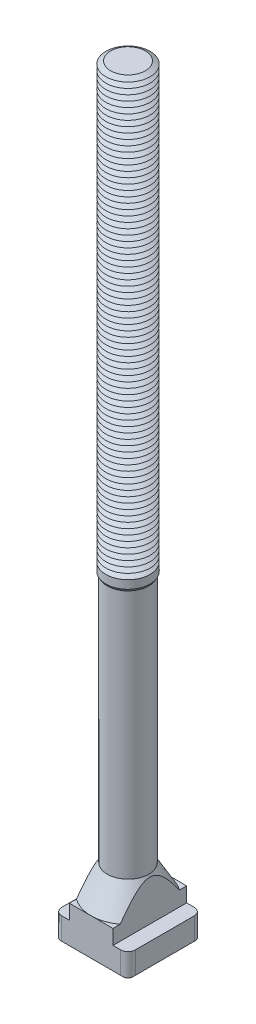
ISO-10303-21;
HEADER;
FILE_DESCRIPTION(('STEP AP214'),'2;1');
FILE_NAME('part.step','',(''),(''),'','','');
FILE_SCHEMA(('AUTOMOTIVE_DESIGN { 1 0 10303 214 1 1 1 1 }'));
ENDSEC;
DATA;
#1=APPLICATION_CONTEXT('core data for automotive mechanical design processes');
#2=APPLICATION_PROTOCOL_DEFINITION('international standard','automotive_design',2000,#1);
#3=PRODUCT_CONTEXT('',#1,'mechanical');
#4=PRODUCT('Part','Part','',(#3));
#5=PRODUCT_RELATED_PRODUCT_CATEGORY('part','',(#4));
#6=PRODUCT_DEFINITION_FORMATION('','',#4);
#7=PRODUCT_DEFINITION_CONTEXT('part definition',#1,'design');
#8=PRODUCT_DEFINITION('design','',#6,#7);
#9=PRODUCT_DEFINITION_SHAPE('','',#8);
#10=(LENGTH_UNIT() NAMED_UNIT(*) SI_UNIT(.MILLI.,.METRE.));
#11=(NAMED_UNIT(*) PLANE_ANGLE_UNIT() SI_UNIT($,.RADIAN.));
#12=(NAMED_UNIT(*) SI_UNIT($,.STERADIAN.) SOLID_ANGLE_UNIT());
#13=UNCERTAINTY_MEASURE_WITH_UNIT(LENGTH_MEASURE(1.E-05),#10,'distance_accuracy_value','');
#14=(GEOMETRIC_REPRESENTATION_CONTEXT(3) GLOBAL_UNCERTAINTY_ASSIGNED_CONTEXT((#13)) GLOBAL_UNIT_ASSIGNED_CONTEXT((#10,
#11,#12)) REPRESENTATION_CONTEXT('',''));
#15=CARTESIAN_POINT('',(0.,0.,0.));
#16=DIRECTION('',(0.,0.,1.));
#17=DIRECTION('',(1.,0.,0.));
#18=AXIS2_PLACEMENT_3D('',#15,#16,#17);
#19=CARTESIAN_POINT('',(0.,404.,0.));
#20=DIRECTION('',(0.,-1.,0.));
#21=DIRECTION('',(0.,0.,-1.));
#22=AXIS2_PLACEMENT_3D('',#19,#20,#21);
#23=CONICAL_SURFACE('',#22,9.40192378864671,1.0471975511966);
#24=CARTESIAN_POINT('',(0.,402.5,0.));
#25=DIRECTION('',(0.,-1.,0.));
#26=DIRECTION('',(0.,0.,-1.));
#27=AXIS2_PLACEMENT_3D('',#24,#25,#26);
#28=CIRCLE('',#27,12.);
#29=CARTESIAN_POINT('',(0.,402.5,-12.));
#30=VERTEX_POINT('',#29);
#31=EDGE_CURVE('E891',#30,#30,#28,.T.);
#32=ORIENTED_EDGE('',*,*,#31,.F.);
#33=EDGE_LOOP('',(#32));
#34=FACE_BOUND('',#33,.T.);
#35=CARTESIAN_POINT('',(0.,404.,0.));
#36=DIRECTION('',(0.,-1.,0.));
#37=DIRECTION('',(0.,0.,-1.));
#38=AXIS2_PLACEMENT_3D('',#35,#36,#37);
#39=CIRCLE('',#38,9.40192378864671);
#40=CARTESIAN_POINT('',(0.,404.,-9.40192378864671));
#41=VERTEX_POINT('',#40);
#42=EDGE_CURVE('E894',#41,#41,#39,.T.);
#43=ORIENTED_EDGE('',*,*,#42,.T.);
#44=EDGE_LOOP('',(#43));
#45=FACE_BOUND('',#44,.T.);
#46=ADVANCED_FACE('F39',(#34,#45),#23,.T.);
#47=CARTESIAN_POINT('',(0.,405.5,0.));
#48=DIRECTION('',(0.,1.,0.));
#49=DIRECTION('',(0.,0.,1.));
#50=AXIS2_PLACEMENT_3D('',#47,#48,#49);
#51=CONICAL_SURFACE('',#50,12.,1.0471975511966);
#52=ORIENTED_EDGE('',*,*,#42,.F.);
#53=EDGE_LOOP('',(#52));
#54=FACE_BOUND('',#53,.T.);
#55=CARTESIAN_POINT('',(0.,405.5,0.));
#56=DIRECTION('',(0.,-1.,0.));
#57=DIRECTION('',(0.,0.,-1.));
#58=AXIS2_PLACEMENT_3D('',#55,#56,#57);
#59=CIRCLE('',#58,12.);
#60=CARTESIAN_POINT('',(0.,405.5,-12.));
#61=VERTEX_POINT('',#60);
#62=EDGE_CURVE('E703',#61,#61,#59,.T.);
#63=ORIENTED_EDGE('',*,*,#62,.T.);
#64=EDGE_LOOP('',(#63));
#65=FACE_BOUND('',#64,.T.);
#66=ADVANCED_FACE('F449',(#54,#65),#51,.T.);
#67=CARTESIAN_POINT('',(5.7302202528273,416.,0.));
#68=DIRECTION('',(0.,-1.,0.));
#69=DIRECTION('',(1.,0.,0.));
#70=AXIS2_PLACEMENT_3D('',#67,#68,#69);
#71=PLANE('',#70);
#72=CARTESIAN_POINT('',(0.,416.,0.));
#73=DIRECTION('',(0.,-1.,0.));
#74=DIRECTION('',(0.,0.,-1.));
#75=AXIS2_PLACEMENT_3D('',#72,#73,#74);
#76=CIRCLE('',#75,9.40192378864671);
#77=CARTESIAN_POINT('',(0.,416.,-9.40192378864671));
#78=VERTEX_POINT('',#77);
#79=EDGE_CURVE('E744',#78,#78,#76,.T.);
#80=ORIENTED_EDGE('',*,*,#79,.F.);
#81=EDGE_LOOP('',(#80));
#82=FACE_BOUND('',#81,.T.);
#83=ADVANCED_FACE('F455',(#82),#71,.F.);
#84=CARTESIAN_POINT('',(0.,416.,0.));
#85=DIRECTION('',(0.,-1.,0.));
#86=DIRECTION('',(0.,0.,-1.));
#87=AXIS2_PLACEMENT_3D('',#84,#85,#86);
#88=CONICAL_SURFACE('',#87,9.40192378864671,1.0471975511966);
#89=CARTESIAN_POINT('',(0.,414.5,0.));
#90=DIRECTION('',(0.,-1.,0.));
#91=DIRECTION('',(0.,0.,-1.));
#92=AXIS2_PLACEMENT_3D('',#89,#90,#91);
#93=CIRCLE('',#92,12.);
#94=CARTESIAN_POINT('',(0.,414.5,-12.));
#95=VERTEX_POINT('',#94);
#96=EDGE_CURVE('E748',#95,#95,#93,.T.);
#97=ORIENTED_EDGE('',*,*,#96,.F.);
#98=EDGE_LOOP('',(#97));
#99=FACE_BOUND('',#98,.T.);
#100=ORIENTED_EDGE('',*,*,#79,.T.);
#101=EDGE_LOOP('',(#100));
#102=FACE_BOUND('',#101,.T.);
#103=ADVANCED_FACE('F483',(#99,#102),#88,.T.);
#104=CARTESIAN_POINT('',(0.,414.5,0.));
#105=DIRECTION('',(0.,1.,0.));
#106=DIRECTION('',(0.,0.,1.));
#107=AXIS2_PLACEMENT_3D('',#104,#105,#106);
#108=CONICAL_SURFACE('',#107,12.,1.0471975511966);
#109=CARTESIAN_POINT('',(0.,413.,0.));
#110=DIRECTION('',(0.,-1.,0.));
#111=DIRECTION('',(0.,0.,-1.));
#112=AXIS2_PLACEMENT_3D('',#109,#110,#111);
#113=CIRCLE('',#112,9.40192378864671);
#114=CARTESIAN_POINT('',(0.,413.,-9.40192378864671));
#115=VERTEX_POINT('',#114);
#116=EDGE_CURVE('E753',#115,#115,#113,.T.);
#117=ORIENTED_EDGE('',*,*,#116,.F.);
#118=EDGE_LOOP('',(#117));
#119=FACE_BOUND('',#118,.T.);
#120=ORIENTED_EDGE('',*,*,#96,.T.);
#121=EDGE_LOOP('',(#120));
#122=FACE_BOUND('',#121,.T.);
#123=ADVANCED_FACE('F480',(#119,#122),#108,.T.);
#124=CARTESIAN_POINT('',(0.,413.,0.));
#125=DIRECTION('',(0.,-1.,0.));
#126=DIRECTION('',(0.,0.,-1.));
#127=AXIS2_PLACEMENT_3D('',#124,#125,#126);
#128=CONICAL_SURFACE('',#127,9.40192378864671,1.0471975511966);
#129=CARTESIAN_POINT('',(0.,411.5,0.));
#130=DIRECTION('',(0.,-1.,0.));
#131=DIRECTION('',(0.,0.,-1.));
#132=AXIS2_PLACEMENT_3D('',#129,#130,#131);
#133=CIRCLE('',#132,12.);
#134=CARTESIAN_POINT('',(0.,411.5,-12.));
#135=VERTEX_POINT('',#134);
#136=EDGE_CURVE('E750',#135,#135,#133,.T.);
#137=ORIENTED_EDGE('',*,*,#136,.F.);
#138=EDGE_LOOP('',(#137));
#139=FACE_BOUND('',#138,.T.);
#140=ORIENTED_EDGE('',*,*,#116,.T.);
#141=EDGE_LOOP('',(#140));
#142=FACE_BOUND('',#141,.T.);
#143=ADVANCED_FACE('F475',(#139,#142),#128,.T.);
#144=CARTESIAN_POINT('',(0.,411.5,0.));
#145=DIRECTION('',(0.,1.,0.));
#146=DIRECTION('',(0.,0.,1.));
#147=AXIS2_PLACEMENT_3D('',#144,#145,#146);
#148=CONICAL_SURFACE('',#147,12.,1.0471975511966);
#149=CARTESIAN_POINT('',(0.,410.,0.));
#150=DIRECTION('',(0.,-1.,0.));
#151=DIRECTION('',(0.,0.,-1.));
#152=AXIS2_PLACEMENT_3D('',#149,#150,#151);
#153=CIRCLE('',#152,9.40192378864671);
#154=CARTESIAN_POINT('',(0.,410.,-9.40192378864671));
#155=VERTEX_POINT('',#154);
#156=EDGE_CURVE('E754',#155,#155,#153,.T.);
#157=ORIENTED_EDGE('',*,*,#156,.F.);
#158=EDGE_LOOP('',(#157));
#159=FACE_BOUND('',#158,.T.);
#160=ORIENTED_EDGE('',*,*,#136,.T.);
#161=EDGE_LOOP('',(#160));
#162=FACE_BOUND('',#161,.T.);
#163=ADVANCED_FACE('F472',(#159,#162),#148,.T.);
#164=CARTESIAN_POINT('',(0.,410.,0.));
#165=DIRECTION('',(0.,-1.,0.));
#166=DIRECTION('',(0.,0.,-1.));
#167=AXIS2_PLACEMENT_3D('',#164,#165,#166);
#168=CONICAL_SURFACE('',#167,9.40192378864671,1.0471975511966);
#169=CARTESIAN_POINT('',(0.,408.5,0.));
#170=DIRECTION('',(0.,-1.,0.));
#171=DIRECTION('',(0.,0.,-1.));
#172=AXIS2_PLACEMENT_3D('',#169,#170,#171);
#173=CIRCLE('',#172,12.);
#174=CARTESIAN_POINT('',(0.,408.5,-12.));
#175=VERTEX_POINT('',#174);
#176=EDGE_CURVE('E702',#175,#175,#173,.T.);
#177=ORIENTED_EDGE('',*,*,#176,.F.);
#178=EDGE_LOOP('',(#177));
#179=FACE_BOUND('',#178,.T.);
#180=ORIENTED_EDGE('',*,*,#156,.T.);
#181=EDGE_LOOP('',(#180));
#182=FACE_BOUND('',#181,.T.);
#183=ADVANCED_FACE('F466',(#179,#182),#168,.T.);
#184=CARTESIAN_POINT('',(0.,408.5,0.));
#185=DIRECTION('',(0.,1.,0.));
#186=DIRECTION('',(0.,0.,1.));
#187=AXIS2_PLACEMENT_3D('',#184,#185,#186);
#188=CONICAL_SURFACE('',#187,12.,1.0471975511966);
#189=CARTESIAN_POINT('',(0.,407.,0.));
#190=DIRECTION('',(0.,-1.,0.));
#191=DIRECTION('',(0.,0.,-1.));
#192=AXIS2_PLACEMENT_3D('',#189,#190,#191);
#193=CIRCLE('',#192,9.40192378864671);
#194=CARTESIAN_POINT('',(0.,407.,-9.40192378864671));
#195=VERTEX_POINT('',#194);
#196=EDGE_CURVE('E699',#195,#195,#193,.T.);
#197=ORIENTED_EDGE('',*,*,#196,.F.);
#198=EDGE_LOOP('',(#197));
#199=FACE_BOUND('',#198,.T.);
#200=ORIENTED_EDGE('',*,*,#176,.T.);
#201=EDGE_LOOP('',(#200));
#202=FACE_BOUND('',#201,.T.);
#203=ADVANCED_FACE('F462',(#199,#202),#188,.T.);
#204=CARTESIAN_POINT('',(0.,407.,0.));
#205=DIRECTION('',(0.,-1.,0.));
#206=DIRECTION('',(0.,0.,-1.));
#207=AXIS2_PLACEMENT_3D('',#204,#205,#206);
#208=CONICAL_SURFACE('',#207,9.40192378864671,1.0471975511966);
#209=ORIENTED_EDGE('',*,*,#62,.F.);
#210=EDGE_LOOP('',(#209));
#211=FACE_BOUND('',#210,.T.);
#212=ORIENTED_EDGE('',*,*,#196,.T.);
#213=EDGE_LOOP('',(#212));
#214=FACE_BOUND('',#213,.T.);
#215=ADVANCED_FACE('F465',(#211,#214),#208,.T.);
#216=CARTESIAN_POINT('',(0.,401.,0.));
#217=DIRECTION('',(0.,-1.,0.));
#218=DIRECTION('',(0.,0.,-1.));
#219=AXIS2_PLACEMENT_3D('',#216,#217,#218);
#220=CONICAL_SURFACE('',#219,9.40192378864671,1.0471975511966);
#221=CARTESIAN_POINT('',(0.,399.5,0.));
#222=DIRECTION('',(0.,-1.,0.));
#223=DIRECTION('',(0.,0.,-1.));
#224=AXIS2_PLACEMENT_3D('',#221,#222,#223);
#225=CIRCLE('',#224,12.);
#226=CARTESIAN_POINT('',(0.,399.5,-12.));
#227=VERTEX_POINT('',#226);
#228=EDGE_CURVE('E1261',#227,#227,#225,.T.);
#229=ORIENTED_EDGE('',*,*,#228,.F.);
#230=EDGE_LOOP('',(#229));
#231=FACE_BOUND('',#230,.T.);
#232=CARTESIAN_POINT('',(0.,401.,0.));
#233=DIRECTION('',(0.,-1.,0.));
#234=DIRECTION('',(0.,0.,-1.));
#235=AXIS2_PLACEMENT_3D('',#232,#233,#234);
#236=CIRCLE('',#235,9.40192378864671);
#237=CARTESIAN_POINT('',(0.,401.,-9.40192378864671));
#238=VERTEX_POINT('',#237);
#239=EDGE_CURVE('E895',#238,#238,#236,.T.);
#240=ORIENTED_EDGE('',*,*,#239,.T.);
#241=EDGE_LOOP('',(#240));
#242=FACE_BOUND('',#241,.T.);
#243=ADVANCED_FACE('F470',(#231,#242),#220,.T.);
#244=CARTESIAN_POINT('',(0.,402.5,0.));
#245=DIRECTION('',(0.,1.,0.));
#246=DIRECTION('',(0.,0.,1.));
#247=AXIS2_PLACEMENT_3D('',#244,#245,#246);
#248=CONICAL_SURFACE('',#247,12.,1.0471975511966);
#249=ORIENTED_EDGE('',*,*,#239,.F.);
#250=EDGE_LOOP('',(#249));
#251=FACE_BOUND('',#250,.T.);
#252=ORIENTED_EDGE('',*,*,#31,.T.);
#253=EDGE_LOOP('',(#252));
#254=FACE_BOUND('',#253,.T.);
#255=ADVANCED_FACE('F2864',(#251,#254),#248,.T.);
#256=CARTESIAN_POINT('',(0.,398.,0.));
#257=DIRECTION('',(0.,-1.,0.));
#258=DIRECTION('',(0.,0.,-1.));
#259=AXIS2_PLACEMENT_3D('',#256,#257,#258);
#260=CONICAL_SURFACE('',#259,9.40192378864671,1.0471975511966);
#261=CARTESIAN_POINT('',(0.,396.5,0.));
#262=DIRECTION('',(0.,-1.,0.));
#263=DIRECTION('',(0.,0.,-1.));
#264=AXIS2_PLACEMENT_3D('',#261,#262,#263);
#265=CIRCLE('',#264,12.);
#266=CARTESIAN_POINT('',(0.,396.5,-12.));
#267=VERTEX_POINT('',#266);
#268=EDGE_CURVE('E1253',#267,#267,#265,.T.);
#269=ORIENTED_EDGE('',*,*,#268,.F.);
#270=EDGE_LOOP('',(#269));
#271=FACE_BOUND('',#270,.T.);
#272=CARTESIAN_POINT('',(0.,398.,0.));
#273=DIRECTION('',(0.,-1.,0.));
#274=DIRECTION('',(0.,0.,-1.));
#275=AXIS2_PLACEMENT_3D('',#272,#273,#274);
#276=CIRCLE('',#275,9.40192378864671);
#277=CARTESIAN_POINT('',(0.,398.,-9.40192378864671));
#278=VERTEX_POINT('',#277);
#279=EDGE_CURVE('E1257',#278,#278,#276,.T.);
#280=ORIENTED_EDGE('',*,*,#279,.T.);
#281=EDGE_LOOP('',(#280));
#282=FACE_BOUND('',#281,.T.);
#283=ADVANCED_FACE('F2854',(#271,#282),#260,.T.);
#284=CARTESIAN_POINT('',(0.,399.5,0.));
#285=DIRECTION('',(0.,1.,0.));
#286=DIRECTION('',(0.,0.,1.));
#287=AXIS2_PLACEMENT_3D('',#284,#285,#286);
#288=CONICAL_SURFACE('',#287,12.,1.0471975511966);
#289=ORIENTED_EDGE('',*,*,#279,.F.);
#290=EDGE_LOOP('',(#289));
#291=FACE_BOUND('',#290,.T.);
#292=ORIENTED_EDGE('',*,*,#228,.T.);
#293=EDGE_LOOP('',(#292));
#294=FACE_BOUND('',#293,.T.);
#295=ADVANCED_FACE('F2844',(#291,#294),#288,.T.);
#296=CARTESIAN_POINT('',(0.,395.,0.));
#297=DIRECTION('',(0.,-1.,0.));
#298=DIRECTION('',(0.,0.,-1.));
#299=AXIS2_PLACEMENT_3D('',#296,#297,#298);
#300=CONICAL_SURFACE('',#299,9.40192378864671,1.0471975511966);
#301=CARTESIAN_POINT('',(0.,393.5,0.));
#302=DIRECTION('',(0.,-1.,0.));
#303=DIRECTION('',(0.,0.,-1.));
#304=AXIS2_PLACEMENT_3D('',#301,#302,#303);
#305=CIRCLE('',#304,12.);
#306=CARTESIAN_POINT('',(0.,393.5,-12.));
#307=VERTEX_POINT('',#306);
#308=EDGE_CURVE('E798',#307,#307,#305,.T.);
#309=ORIENTED_EDGE('',*,*,#308,.F.);
#310=EDGE_LOOP('',(#309));
#311=FACE_BOUND('',#310,.T.);
#312=CARTESIAN_POINT('',(0.,395.,0.));
#313=DIRECTION('',(0.,-1.,0.));
#314=DIRECTION('',(0.,0.,-1.));
#315=AXIS2_PLACEMENT_3D('',#312,#313,#314);
#316=CIRCLE('',#315,9.40192378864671);
#317=CARTESIAN_POINT('',(0.,395.,-9.40192378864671));
#318=VERTEX_POINT('',#317);
#319=EDGE_CURVE('E801',#318,#318,#316,.T.);
#320=ORIENTED_EDGE('',*,*,#319,.T.);
#321=EDGE_LOOP('',(#320));
#322=FACE_BOUND('',#321,.T.);
#323=ADVANCED_FACE('F2834',(#311,#322),#300,.T.);
#324=CARTESIAN_POINT('',(0.,396.5,0.));
#325=DIRECTION('',(0.,1.,0.));
#326=DIRECTION('',(0.,0.,1.));
#327=AXIS2_PLACEMENT_3D('',#324,#325,#326);
#328=CONICAL_SURFACE('',#327,12.,1.0471975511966);
#329=ORIENTED_EDGE('',*,*,#319,.F.);
#330=EDGE_LOOP('',(#329));
#331=FACE_BOUND('',#330,.T.);
#332=ORIENTED_EDGE('',*,*,#268,.T.);
#333=EDGE_LOOP('',(#332));
#334=FACE_BOUND('',#333,.T.);
#335=ADVANCED_FACE('F2824',(#331,#334),#328,.T.);
#336=CARTESIAN_POINT('',(0.,392.,0.));
#337=DIRECTION('',(0.,-1.,0.));
#338=DIRECTION('',(0.,0.,-1.));
#339=AXIS2_PLACEMENT_3D('',#336,#337,#338);
#340=CONICAL_SURFACE('',#339,9.40192378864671,1.0471975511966);
#341=CARTESIAN_POINT('',(0.,390.5,0.));
#342=DIRECTION('',(0.,-1.,0.));
#343=DIRECTION('',(0.,0.,-1.));
#344=AXIS2_PLACEMENT_3D('',#341,#342,#343);
#345=CIRCLE('',#344,12.);
#346=CARTESIAN_POINT('',(0.,390.5,-12.));
#347=VERTEX_POINT('',#346);
#348=EDGE_CURVE('E807',#347,#347,#345,.T.);
#349=ORIENTED_EDGE('',*,*,#348,.F.);
#350=EDGE_LOOP('',(#349));
#351=FACE_BOUND('',#350,.T.);
#352=CARTESIAN_POINT('',(0.,392.,0.));
#353=DIRECTION('',(0.,-1.,0.));
#354=DIRECTION('',(0.,0.,-1.));
#355=AXIS2_PLACEMENT_3D('',#352,#353,#354);
#356=CIRCLE('',#355,9.40192378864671);
#357=CARTESIAN_POINT('',(0.,392.,-9.40192378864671));
#358=VERTEX_POINT('',#357);
#359=EDGE_CURVE('E802',#358,#358,#356,.T.);
#360=ORIENTED_EDGE('',*,*,#359,.T.);
#361=EDGE_LOOP('',(#360));
#362=FACE_BOUND('',#361,.T.);
#363=ADVANCED_FACE('F2814',(#351,#362),#340,.T.);
#364=CARTESIAN_POINT('',(0.,393.5,0.));
#365=DIRECTION('',(0.,1.,0.));
#366=DIRECTION('',(0.,0.,1.));
#367=AXIS2_PLACEMENT_3D('',#364,#365,#366);
#368=CONICAL_SURFACE('',#367,12.,1.0471975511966);
#369=ORIENTED_EDGE('',*,*,#359,.F.);
#370=EDGE_LOOP('',(#369));
#371=FACE_BOUND('',#370,.T.);
#372=ORIENTED_EDGE('',*,*,#308,.T.);
#373=EDGE_LOOP('',(#372));
#374=FACE_BOUND('',#373,.T.);
#375=ADVANCED_FACE('F2804',(#371,#374),#368,.T.);
#376=CARTESIAN_POINT('',(0.,389.,0.));
#377=DIRECTION('',(0.,-1.,0.));
#378=DIRECTION('',(0.,0.,-1.));
#379=AXIS2_PLACEMENT_3D('',#376,#377,#378);
#380=CONICAL_SURFACE('',#379,9.40192378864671,1.0471975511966);
#381=CARTESIAN_POINT('',(0.,387.5,0.));
#382=DIRECTION('',(0.,-1.,0.));
#383=DIRECTION('',(0.,0.,-1.));
#384=AXIS2_PLACEMENT_3D('',#381,#382,#383);
#385=CIRCLE('',#384,12.);
#386=CARTESIAN_POINT('',(0.,387.5,-12.));
#387=VERTEX_POINT('',#386);
#388=EDGE_CURVE('E808',#387,#387,#385,.T.);
#389=ORIENTED_EDGE('',*,*,#388,.F.);
#390=EDGE_LOOP('',(#389));
#391=FACE_BOUND('',#390,.T.);
#392=CARTESIAN_POINT('',(0.,389.,0.));
#393=DIRECTION('',(0.,-1.,0.));
#394=DIRECTION('',(0.,0.,-1.));
#395=AXIS2_PLACEMENT_3D('',#392,#393,#394);
#396=CIRCLE('',#395,9.40192378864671);
#397=CARTESIAN_POINT('',(0.,389.,-9.40192378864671));
#398=VERTEX_POINT('',#397);
#399=EDGE_CURVE('E804',#398,#398,#396,.T.);
#400=ORIENTED_EDGE('',*,*,#399,.T.);
#401=EDGE_LOOP('',(#400));
#402=FACE_BOUND('',#401,.T.);
#403=ADVANCED_FACE('F2794',(#391,#402),#380,.T.);
#404=CARTESIAN_POINT('',(0.,390.5,0.));
#405=DIRECTION('',(0.,1.,0.));
#406=DIRECTION('',(0.,0.,1.));
#407=AXIS2_PLACEMENT_3D('',#404,#405,#406);
#408=CONICAL_SURFACE('',#407,12.,1.0471975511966);
#409=ORIENTED_EDGE('',*,*,#399,.F.);
#410=EDGE_LOOP('',(#409));
#411=FACE_BOUND('',#410,.T.);
#412=ORIENTED_EDGE('',*,*,#348,.T.);
#413=EDGE_LOOP('',(#412));
#414=FACE_BOUND('',#413,.T.);
#415=ADVANCED_FACE('F2784',(#411,#414),#408,.T.);
#416=CARTESIAN_POINT('',(0.,386.,0.));
#417=DIRECTION('',(0.,-1.,0.));
#418=DIRECTION('',(0.,0.,-1.));
#419=AXIS2_PLACEMENT_3D('',#416,#417,#418);
#420=CONICAL_SURFACE('',#419,9.40192378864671,1.0471975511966);
#421=CARTESIAN_POINT('',(0.,384.5,0.));
#422=DIRECTION('',(0.,-1.,0.));
#423=DIRECTION('',(0.,0.,-1.));
#424=AXIS2_PLACEMENT_3D('',#421,#422,#423);
#425=CIRCLE('',#424,12.);
#426=CARTESIAN_POINT('',(0.,384.5,-12.));
#427=VERTEX_POINT('',#426);
#428=EDGE_CURVE('E636',#427,#427,#425,.T.);
#429=ORIENTED_EDGE('',*,*,#428,.F.);
#430=EDGE_LOOP('',(#429));
#431=FACE_BOUND('',#430,.T.);
#432=CARTESIAN_POINT('',(0.,386.,0.));
#433=DIRECTION('',(0.,-1.,0.));
#434=DIRECTION('',(0.,0.,-1.));
#435=AXIS2_PLACEMENT_3D('',#432,#433,#434);
#436=CIRCLE('',#435,9.40192378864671);
#437=CARTESIAN_POINT('',(0.,386.,-9.40192378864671));
#438=VERTEX_POINT('',#437);
#439=EDGE_CURVE('E1021',#438,#438,#436,.T.);
#440=ORIENTED_EDGE('',*,*,#439,.T.);
#441=EDGE_LOOP('',(#440));
#442=FACE_BOUND('',#441,.T.);
#443=ADVANCED_FACE('F2774',(#431,#442),#420,.T.);
#444=CARTESIAN_POINT('',(0.,387.5,0.));
#445=DIRECTION('',(0.,1.,0.));
#446=DIRECTION('',(0.,0.,1.));
#447=AXIS2_PLACEMENT_3D('',#444,#445,#446);
#448=CONICAL_SURFACE('',#447,12.,1.0471975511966);
#449=ORIENTED_EDGE('',*,*,#439,.F.);
#450=EDGE_LOOP('',(#449));
#451=FACE_BOUND('',#450,.T.);
#452=ORIENTED_EDGE('',*,*,#388,.T.);
#453=EDGE_LOOP('',(#452));
#454=FACE_BOUND('',#453,.T.);
#455=ADVANCED_FACE('F2764',(#451,#454),#448,.T.);
#456=CARTESIAN_POINT('',(0.,383.,0.));
#457=DIRECTION('',(0.,-1.,0.));
#458=DIRECTION('',(0.,0.,-1.));
#459=AXIS2_PLACEMENT_3D('',#456,#457,#458);
#460=CONICAL_SURFACE('',#459,9.40192378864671,1.0471975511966);
#461=CARTESIAN_POINT('',(0.,381.5,0.));
#462=DIRECTION('',(0.,-1.,0.));
#463=DIRECTION('',(0.,0.,-1.));
#464=AXIS2_PLACEMENT_3D('',#461,#462,#463);
#465=CIRCLE('',#464,12.);
#466=CARTESIAN_POINT('',(0.,381.5,-12.));
#467=VERTEX_POINT('',#466);
#468=EDGE_CURVE('E637',#467,#467,#465,.T.);
#469=ORIENTED_EDGE('',*,*,#468,.F.);
#470=EDGE_LOOP('',(#469));
#471=FACE_BOUND('',#470,.T.);
#472=CARTESIAN_POINT('',(0.,383.,0.));
#473=DIRECTION('',(0.,-1.,0.));
#474=DIRECTION('',(0.,0.,-1.));
#475=AXIS2_PLACEMENT_3D('',#472,#473,#474);
#476=CIRCLE('',#475,9.40192378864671);
#477=CARTESIAN_POINT('',(0.,383.,-9.40192378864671));
#478=VERTEX_POINT('',#477);
#479=EDGE_CURVE('E633',#478,#478,#476,.T.);
#480=ORIENTED_EDGE('',*,*,#479,.T.);
#481=EDGE_LOOP('',(#480));
#482=FACE_BOUND('',#481,.T.);
#483=ADVANCED_FACE('F2754',(#471,#482),#460,.T.);
#484=CARTESIAN_POINT('',(0.,384.5,0.));
#485=DIRECTION('',(0.,1.,0.));
#486=DIRECTION('',(0.,0.,1.));
#487=AXIS2_PLACEMENT_3D('',#484,#485,#486);
#488=CONICAL_SURFACE('',#487,12.,1.0471975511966);
#489=ORIENTED_EDGE('',*,*,#479,.F.);
#490=EDGE_LOOP('',(#489));
#491=FACE_BOUND('',#490,.T.);
#492=ORIENTED_EDGE('',*,*,#428,.T.);
#493=EDGE_LOOP('',(#492));
#494=FACE_BOUND('',#493,.T.);
#495=ADVANCED_FACE('F2744',(#491,#494),#488,.T.);
#496=CARTESIAN_POINT('',(0.,380.,0.));
#497=DIRECTION('',(0.,-1.,0.));
#498=DIRECTION('',(0.,0.,-1.));
#499=AXIS2_PLACEMENT_3D('',#496,#497,#498);
#500=CONICAL_SURFACE('',#499,9.40192378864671,1.0471975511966);
#501=CARTESIAN_POINT('',(0.,378.5,0.));
#502=DIRECTION('',(0.,-1.,0.));
#503=DIRECTION('',(0.,0.,-1.));
#504=AXIS2_PLACEMENT_3D('',#501,#502,#503);
#505=CIRCLE('',#504,12.);
#506=CARTESIAN_POINT('',(0.,378.5,-12.));
#507=VERTEX_POINT('',#506);
#508=EDGE_CURVE('E642',#507,#507,#505,.T.);
#509=ORIENTED_EDGE('',*,*,#508,.F.);
#510=EDGE_LOOP('',(#509));
#511=FACE_BOUND('',#510,.T.);
#512=CARTESIAN_POINT('',(0.,380.,0.));
#513=DIRECTION('',(0.,-1.,0.));
#514=DIRECTION('',(0.,0.,-1.));
#515=AXIS2_PLACEMENT_3D('',#512,#513,#514);
#516=CIRCLE('',#515,9.40192378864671);
#517=CARTESIAN_POINT('',(0.,380.,-9.40192378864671));
#518=VERTEX_POINT('',#517);
#519=EDGE_CURVE('E948',#518,#518,#516,.T.);
#520=ORIENTED_EDGE('',*,*,#519,.T.);
#521=EDGE_LOOP('',(#520));
#522=FACE_BOUND('',#521,.T.);
#523=ADVANCED_FACE('F2734',(#511,#522),#500,.T.);
#524=CARTESIAN_POINT('',(0.,381.5,0.));
#525=DIRECTION('',(0.,1.,0.));
#526=DIRECTION('',(0.,0.,1.));
#527=AXIS2_PLACEMENT_3D('',#524,#525,#526);
#528=CONICAL_SURFACE('',#527,12.,1.0471975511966);
#529=ORIENTED_EDGE('',*,*,#519,.F.);
#530=EDGE_LOOP('',(#529));
#531=FACE_BOUND('',#530,.T.);
#532=ORIENTED_EDGE('',*,*,#468,.T.);
#533=EDGE_LOOP('',(#532));
#534=FACE_BOUND('',#533,.T.);
#535=ADVANCED_FACE('F2724',(#531,#534),#528,.T.);
#536=CARTESIAN_POINT('',(0.,377.,0.));
#537=DIRECTION('',(0.,-1.,0.));
#538=DIRECTION('',(0.,0.,-1.));
#539=AXIS2_PLACEMENT_3D('',#536,#537,#538);
#540=CONICAL_SURFACE('',#539,9.40192378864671,1.0471975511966);
#541=CARTESIAN_POINT('',(0.,375.5,0.));
#542=DIRECTION('',(0.,-1.,0.));
#543=DIRECTION('',(0.,0.,-1.));
#544=AXIS2_PLACEMENT_3D('',#541,#542,#543);
#545=CIRCLE('',#544,12.);
#546=CARTESIAN_POINT('',(0.,375.5,-12.));
#547=VERTEX_POINT('',#546);
#548=EDGE_CURVE('E643',#547,#547,#545,.T.);
#549=ORIENTED_EDGE('',*,*,#548,.F.);
#550=EDGE_LOOP('',(#549));
#551=FACE_BOUND('',#550,.T.);
#552=CARTESIAN_POINT('',(0.,377.,0.));
#553=DIRECTION('',(0.,-1.,0.));
#554=DIRECTION('',(0.,0.,-1.));
#555=AXIS2_PLACEMENT_3D('',#552,#553,#554);
#556=CIRCLE('',#555,9.40192378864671);
#557=CARTESIAN_POINT('',(0.,377.,-9.40192378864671));
#558=VERTEX_POINT('',#557);
#559=EDGE_CURVE('E639',#558,#558,#556,.T.);
#560=ORIENTED_EDGE('',*,*,#559,.T.);
#561=EDGE_LOOP('',(#560));
#562=FACE_BOUND('',#561,.T.);
#563=ADVANCED_FACE('F2714',(#551,#562),#540,.T.);
#564=CARTESIAN_POINT('',(0.,378.5,0.));
#565=DIRECTION('',(0.,1.,0.));
#566=DIRECTION('',(0.,0.,1.));
#567=AXIS2_PLACEMENT_3D('',#564,#565,#566);
#568=CONICAL_SURFACE('',#567,12.,1.0471975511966);
#569=ORIENTED_EDGE('',*,*,#559,.F.);
#570=EDGE_LOOP('',(#569));
#571=FACE_BOUND('',#570,.T.);
#572=ORIENTED_EDGE('',*,*,#508,.T.);
#573=EDGE_LOOP('',(#572));
#574=FACE_BOUND('',#573,.T.);
#575=ADVANCED_FACE('F2704',(#571,#574),#568,.T.);
#576=CARTESIAN_POINT('',(0.,374.,0.));
#577=DIRECTION('',(0.,-1.,0.));
#578=DIRECTION('',(0.,0.,-1.));
#579=AXIS2_PLACEMENT_3D('',#576,#577,#578);
#580=CONICAL_SURFACE('',#579,9.40192378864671,1.0471975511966);
#581=CARTESIAN_POINT('',(0.,372.5,0.));
#582=DIRECTION('',(0.,-1.,0.));
#583=DIRECTION('',(0.,0.,-1.));
#584=AXIS2_PLACEMENT_3D('',#581,#582,#583);
#585=CIRCLE('',#584,12.);
#586=CARTESIAN_POINT('',(0.,372.5,-12.));
#587=VERTEX_POINT('',#586);
#588=EDGE_CURVE('E648',#587,#587,#585,.T.);
#589=ORIENTED_EDGE('',*,*,#588,.F.);
#590=EDGE_LOOP('',(#589));
#591=FACE_BOUND('',#590,.T.);
#592=CARTESIAN_POINT('',(0.,374.,0.));
#593=DIRECTION('',(0.,-1.,0.));
#594=DIRECTION('',(0.,0.,-1.));
#595=AXIS2_PLACEMENT_3D('',#592,#593,#594);
#596=CIRCLE('',#595,9.40192378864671);
#597=CARTESIAN_POINT('',(0.,374.,-9.40192378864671));
#598=VERTEX_POINT('',#597);
#599=EDGE_CURVE('E1228',#598,#598,#596,.T.);
#600=ORIENTED_EDGE('',*,*,#599,.T.);
#601=EDGE_LOOP('',(#600));
#602=FACE_BOUND('',#601,.T.);
#603=ADVANCED_FACE('F2694',(#591,#602),#580,.T.);
#604=CARTESIAN_POINT('',(0.,375.5,0.));
#605=DIRECTION('',(0.,1.,0.));
#606=DIRECTION('',(0.,0.,1.));
#607=AXIS2_PLACEMENT_3D('',#604,#605,#606);
#608=CONICAL_SURFACE('',#607,12.,1.0471975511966);
#609=ORIENTED_EDGE('',*,*,#599,.F.);
#610=EDGE_LOOP('',(#609));
#611=FACE_BOUND('',#610,.T.);
#612=ORIENTED_EDGE('',*,*,#548,.T.);
#613=EDGE_LOOP('',(#612));
#614=FACE_BOUND('',#613,.T.);
#615=ADVANCED_FACE('F2684',(#611,#614),#608,.T.);
#616=CARTESIAN_POINT('',(0.,371.,0.));
#617=DIRECTION('',(0.,-1.,0.));
#618=DIRECTION('',(0.,0.,-1.));
#619=AXIS2_PLACEMENT_3D('',#616,#617,#618);
#620=CONICAL_SURFACE('',#619,9.40192378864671,1.0471975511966);
#621=CARTESIAN_POINT('',(0.,369.5,0.));
#622=DIRECTION('',(0.,-1.,0.));
#623=DIRECTION('',(0.,0.,-1.));
#624=AXIS2_PLACEMENT_3D('',#621,#622,#623);
#625=CIRCLE('',#624,12.);
#626=CARTESIAN_POINT('',(0.,369.5,-12.));
#627=VERTEX_POINT('',#626);
#628=EDGE_CURVE('E649',#627,#627,#625,.T.);
#629=ORIENTED_EDGE('',*,*,#628,.F.);
#630=EDGE_LOOP('',(#629));
#631=FACE_BOUND('',#630,.T.);
#632=CARTESIAN_POINT('',(0.,371.,0.));
#633=DIRECTION('',(0.,-1.,0.));
#634=DIRECTION('',(0.,0.,-1.));
#635=AXIS2_PLACEMENT_3D('',#632,#633,#634);
#636=CIRCLE('',#635,9.40192378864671);
#637=CARTESIAN_POINT('',(0.,371.,-9.40192378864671));
#638=VERTEX_POINT('',#637);
#639=EDGE_CURVE('E645',#638,#638,#636,.T.);
#640=ORIENTED_EDGE('',*,*,#639,.T.);
#641=EDGE_LOOP('',(#640));
#642=FACE_BOUND('',#641,.T.);
#643=ADVANCED_FACE('F2674',(#631,#642),#620,.T.);
#644=CARTESIAN_POINT('',(0.,372.5,0.));
#645=DIRECTION('',(0.,1.,0.));
#646=DIRECTION('',(0.,0.,1.));
#647=AXIS2_PLACEMENT_3D('',#644,#645,#646);
#648=CONICAL_SURFACE('',#647,12.,1.0471975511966);
#649=ORIENTED_EDGE('',*,*,#639,.F.);
#650=EDGE_LOOP('',(#649));
#651=FACE_BOUND('',#650,.T.);
#652=ORIENTED_EDGE('',*,*,#588,.T.);
#653=EDGE_LOOP('',(#652));
#654=FACE_BOUND('',#653,.T.);
#655=ADVANCED_FACE('F2664',(#651,#654),#648,.T.);
#656=CARTESIAN_POINT('',(0.,368.,0.));
#657=DIRECTION('',(0.,-1.,0.));
#658=DIRECTION('',(0.,0.,-1.));
#659=AXIS2_PLACEMENT_3D('',#656,#657,#658);
#660=CONICAL_SURFACE('',#659,9.40192378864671,1.0471975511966);
#661=CARTESIAN_POINT('',(0.,366.5,0.));
#662=DIRECTION('',(0.,-1.,0.));
#663=DIRECTION('',(0.,0.,-1.));
#664=AXIS2_PLACEMENT_3D('',#661,#662,#663);
#665=CIRCLE('',#664,12.);
#666=CARTESIAN_POINT('',(0.,366.5,-12.));
#667=VERTEX_POINT('',#666);
#668=EDGE_CURVE('E705',#667,#667,#665,.T.);
#669=ORIENTED_EDGE('',*,*,#668,.F.);
#670=EDGE_LOOP('',(#669));
#671=FACE_BOUND('',#670,.T.);
#672=CARTESIAN_POINT('',(0.,368.,0.));
#673=DIRECTION('',(0.,-1.,0.));
#674=DIRECTION('',(0.,0.,-1.));
#675=AXIS2_PLACEMENT_3D('',#672,#673,#674);
#676=CIRCLE('',#675,9.40192378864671);
#677=CARTESIAN_POINT('',(0.,368.,-9.40192378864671));
#678=VERTEX_POINT('',#677);
#679=EDGE_CURVE('E708',#678,#678,#676,.T.);
#680=ORIENTED_EDGE('',*,*,#679,.T.);
#681=EDGE_LOOP('',(#680));
#682=FACE_BOUND('',#681,.T.);
#683=ADVANCED_FACE('F2654',(#671,#682),#660,.T.);
#684=CARTESIAN_POINT('',(0.,369.5,0.));
#685=DIRECTION('',(0.,1.,0.));
#686=DIRECTION('',(0.,0.,1.));
#687=AXIS2_PLACEMENT_3D('',#684,#685,#686);
#688=CONICAL_SURFACE('',#687,12.,1.0471975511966);
#689=ORIENTED_EDGE('',*,*,#679,.F.);
#690=EDGE_LOOP('',(#689));
#691=FACE_BOUND('',#690,.T.);
#692=ORIENTED_EDGE('',*,*,#628,.T.);
#693=EDGE_LOOP('',(#692));
#694=FACE_BOUND('',#693,.T.);
#695=ADVANCED_FACE('F2644',(#691,#694),#688,.T.);
#696=CARTESIAN_POINT('',(0.,365.,0.));
#697=DIRECTION('',(0.,-1.,0.));
#698=DIRECTION('',(0.,0.,-1.));
#699=AXIS2_PLACEMENT_3D('',#696,#697,#698);
#700=CONICAL_SURFACE('',#699,9.40192378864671,1.0471975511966);
#701=CARTESIAN_POINT('',(0.,363.5,0.));
#702=DIRECTION('',(0.,-1.,0.));
#703=DIRECTION('',(0.,0.,-1.));
#704=AXIS2_PLACEMENT_3D('',#701,#702,#703);
#705=CIRCLE('',#704,12.);
#706=CARTESIAN_POINT('',(0.,363.5,-12.));
#707=VERTEX_POINT('',#706);
#708=EDGE_CURVE('E1215',#707,#707,#705,.T.);
#709=ORIENTED_EDGE('',*,*,#708,.F.);
#710=EDGE_LOOP('',(#709));
#711=FACE_BOUND('',#710,.T.);
#712=CARTESIAN_POINT('',(0.,365.,0.));
#713=DIRECTION('',(0.,-1.,0.));
#714=DIRECTION('',(0.,0.,-1.));
#715=AXIS2_PLACEMENT_3D('',#712,#713,#714);
#716=CIRCLE('',#715,9.40192378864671);
#717=CARTESIAN_POINT('',(0.,365.,-9.40192378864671));
#718=VERTEX_POINT('',#717);
#719=EDGE_CURVE('E709',#718,#718,#716,.T.);
#720=ORIENTED_EDGE('',*,*,#719,.T.);
#721=EDGE_LOOP('',(#720));
#722=FACE_BOUND('',#721,.T.);
#723=ADVANCED_FACE('F2634',(#711,#722),#700,.T.);
#724=CARTESIAN_POINT('',(0.,366.5,0.));
#725=DIRECTION('',(0.,1.,0.));
#726=DIRECTION('',(0.,0.,1.));
#727=AXIS2_PLACEMENT_3D('',#724,#725,#726);
#728=CONICAL_SURFACE('',#727,12.,1.0471975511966);
#729=ORIENTED_EDGE('',*,*,#719,.F.);
#730=EDGE_LOOP('',(#729));
#731=FACE_BOUND('',#730,.T.);
#732=ORIENTED_EDGE('',*,*,#668,.T.);
#733=EDGE_LOOP('',(#732));
#734=FACE_BOUND('',#733,.T.);
#735=ADVANCED_FACE('F2624',(#731,#734),#728,.T.);
#736=CARTESIAN_POINT('',(0.,362.,0.));
#737=DIRECTION('',(0.,-1.,0.));
#738=DIRECTION('',(0.,0.,-1.));
#739=AXIS2_PLACEMENT_3D('',#736,#737,#738);
#740=CONICAL_SURFACE('',#739,9.40192378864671,1.0471975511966);
#741=CARTESIAN_POINT('',(0.,360.5,0.));
#742=DIRECTION('',(0.,-1.,0.));
#743=DIRECTION('',(0.,0.,-1.));
#744=AXIS2_PLACEMENT_3D('',#741,#742,#743);
#745=CIRCLE('',#744,12.);
#746=CARTESIAN_POINT('',(0.,360.5,-12.));
#747=VERTEX_POINT('',#746);
#748=EDGE_CURVE('E989',#747,#747,#745,.T.);
#749=ORIENTED_EDGE('',*,*,#748,.F.);
#750=EDGE_LOOP('',(#749));
#751=FACE_BOUND('',#750,.T.);
#752=CARTESIAN_POINT('',(0.,362.,0.));
#753=DIRECTION('',(0.,-1.,0.));
#754=DIRECTION('',(0.,0.,-1.));
#755=AXIS2_PLACEMENT_3D('',#752,#753,#754);
#756=CIRCLE('',#755,9.40192378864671);
#757=CARTESIAN_POINT('',(0.,362.,-9.40192378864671));
#758=VERTEX_POINT('',#757);
#759=EDGE_CURVE('E992',#758,#758,#756,.T.);
#760=ORIENTED_EDGE('',*,*,#759,.T.);
#761=EDGE_LOOP('',(#760));
#762=FACE_BOUND('',#761,.T.);
#763=ADVANCED_FACE('F2614',(#751,#762),#740,.T.);
#764=CARTESIAN_POINT('',(0.,363.5,0.));
#765=DIRECTION('',(0.,1.,0.));
#766=DIRECTION('',(0.,0.,1.));
#767=AXIS2_PLACEMENT_3D('',#764,#765,#766);
#768=CONICAL_SURFACE('',#767,12.,1.0471975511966);
#769=ORIENTED_EDGE('',*,*,#759,.F.);
#770=EDGE_LOOP('',(#769));
#771=FACE_BOUND('',#770,.T.);
#772=ORIENTED_EDGE('',*,*,#708,.T.);
#773=EDGE_LOOP('',(#772));
#774=FACE_BOUND('',#773,.T.);
#775=ADVANCED_FACE('F2604',(#771,#774),#768,.T.);
#776=CARTESIAN_POINT('',(0.,359.,0.));
#777=DIRECTION('',(0.,-1.,0.));
#778=DIRECTION('',(0.,0.,-1.));
#779=AXIS2_PLACEMENT_3D('',#776,#777,#778);
#780=CONICAL_SURFACE('',#779,9.40192378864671,1.0471975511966);
#781=CARTESIAN_POINT('',(0.,357.5,0.));
#782=DIRECTION('',(0.,-1.,0.));
#783=DIRECTION('',(0.,0.,-1.));
#784=AXIS2_PLACEMENT_3D('',#781,#782,#783);
#785=CIRCLE('',#784,12.);
#786=CARTESIAN_POINT('',(0.,357.5,-12.));
#787=VERTEX_POINT('',#786);
#788=EDGE_CURVE('E900',#787,#787,#785,.T.);
#789=ORIENTED_EDGE('',*,*,#788,.F.);
#790=EDGE_LOOP('',(#789));
#791=FACE_BOUND('',#790,.T.);
#792=CARTESIAN_POINT('',(0.,359.,0.));
#793=DIRECTION('',(0.,-1.,0.));
#794=DIRECTION('',(0.,0.,-1.));
#795=AXIS2_PLACEMENT_3D('',#792,#793,#794);
#796=CIRCLE('',#795,9.40192378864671);
#797=CARTESIAN_POINT('',(0.,359.,-9.40192378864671));
#798=VERTEX_POINT('',#797);
#799=EDGE_CURVE('E903',#798,#798,#796,.T.);
#800=ORIENTED_EDGE('',*,*,#799,.T.);
#801=EDGE_LOOP('',(#800));
#802=FACE_BOUND('',#801,.T.);
#803=ADVANCED_FACE('F2594',(#791,#802),#780,.T.);
#804=CARTESIAN_POINT('',(0.,360.5,0.));
#805=DIRECTION('',(0.,1.,0.));
#806=DIRECTION('',(0.,0.,1.));
#807=AXIS2_PLACEMENT_3D('',#804,#805,#806);
#808=CONICAL_SURFACE('',#807,12.,1.0471975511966);
#809=ORIENTED_EDGE('',*,*,#799,.F.);
#810=EDGE_LOOP('',(#809));
#811=FACE_BOUND('',#810,.T.);
#812=ORIENTED_EDGE('',*,*,#748,.T.);
#813=EDGE_LOOP('',(#812));
#814=FACE_BOUND('',#813,.T.);
#815=ADVANCED_FACE('F2584',(#811,#814),#808,.T.);
#816=CARTESIAN_POINT('',(0.,356.,0.));
#817=DIRECTION('',(0.,-1.,0.));
#818=DIRECTION('',(0.,0.,-1.));
#819=AXIS2_PLACEMENT_3D('',#816,#817,#818);
#820=CONICAL_SURFACE('',#819,9.40192378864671,1.0471975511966);
#821=CARTESIAN_POINT('',(0.,354.5,0.));
#822=DIRECTION('',(0.,-1.,0.));
#823=DIRECTION('',(0.,0.,-1.));
#824=AXIS2_PLACEMENT_3D('',#821,#822,#823);
#825=CIRCLE('',#824,12.);
#826=CARTESIAN_POINT('',(0.,354.5,-12.));
#827=VERTEX_POINT('',#826);
#828=EDGE_CURVE('E906',#827,#827,#825,.T.);
#829=ORIENTED_EDGE('',*,*,#828,.F.);
#830=EDGE_LOOP('',(#829));
#831=FACE_BOUND('',#830,.T.);
#832=CARTESIAN_POINT('',(0.,356.,0.));
#833=DIRECTION('',(0.,-1.,0.));
#834=DIRECTION('',(0.,0.,-1.));
#835=AXIS2_PLACEMENT_3D('',#832,#833,#834);
#836=CIRCLE('',#835,9.40192378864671);
#837=CARTESIAN_POINT('',(0.,356.,-9.40192378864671));
#838=VERTEX_POINT('',#837);
#839=EDGE_CURVE('E904',#838,#838,#836,.T.);
#840=ORIENTED_EDGE('',*,*,#839,.T.);
#841=EDGE_LOOP('',(#840));
#842=FACE_BOUND('',#841,.T.);
#843=ADVANCED_FACE('F2574',(#831,#842),#820,.T.);
#844=CARTESIAN_POINT('',(0.,357.5,0.));
#845=DIRECTION('',(0.,1.,0.));
#846=DIRECTION('',(0.,0.,1.));
#847=AXIS2_PLACEMENT_3D('',#844,#845,#846);
#848=CONICAL_SURFACE('',#847,12.,1.0471975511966);
#849=ORIENTED_EDGE('',*,*,#839,.F.);
#850=EDGE_LOOP('',(#849));
#851=FACE_BOUND('',#850,.T.);
#852=ORIENTED_EDGE('',*,*,#788,.T.);
#853=EDGE_LOOP('',(#852));
#854=FACE_BOUND('',#853,.T.);
#855=ADVANCED_FACE('F2564',(#851,#854),#848,.T.);
#856=CARTESIAN_POINT('',(0.,353.,0.));
#857=DIRECTION('',(0.,-1.,0.));
#858=DIRECTION('',(0.,0.,-1.));
#859=AXIS2_PLACEMENT_3D('',#856,#857,#858);
#860=CONICAL_SURFACE('',#859,9.40192378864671,1.0471975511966);
#861=CARTESIAN_POINT('',(0.,351.5,0.));
#862=DIRECTION('',(0.,-1.,0.));
#863=DIRECTION('',(0.,0.,-1.));
#864=AXIS2_PLACEMENT_3D('',#861,#862,#863);
#865=CIRCLE('',#864,12.);
#866=CARTESIAN_POINT('',(0.,351.5,-12.));
#867=VERTEX_POINT('',#866);
#868=EDGE_CURVE('E651',#867,#867,#865,.T.);
#869=ORIENTED_EDGE('',*,*,#868,.F.);
#870=EDGE_LOOP('',(#869));
#871=FACE_BOUND('',#870,.T.);
#872=CARTESIAN_POINT('',(0.,353.,0.));
#873=DIRECTION('',(0.,-1.,0.));
#874=DIRECTION('',(0.,0.,-1.));
#875=AXIS2_PLACEMENT_3D('',#872,#873,#874);
#876=CIRCLE('',#875,9.40192378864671);
#877=CARTESIAN_POINT('',(0.,353.,-9.40192378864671));
#878=VERTEX_POINT('',#877);
#879=EDGE_CURVE('E654',#878,#878,#876,.T.);
#880=ORIENTED_EDGE('',*,*,#879,.T.);
#881=EDGE_LOOP('',(#880));
#882=FACE_BOUND('',#881,.T.);
#883=ADVANCED_FACE('F2554',(#871,#882),#860,.T.);
#884=CARTESIAN_POINT('',(0.,354.5,0.));
#885=DIRECTION('',(0.,1.,0.));
#886=DIRECTION('',(0.,0.,1.));
#887=AXIS2_PLACEMENT_3D('',#884,#885,#886);
#888=CONICAL_SURFACE('',#887,12.,1.0471975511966);
#889=ORIENTED_EDGE('',*,*,#879,.F.);
#890=EDGE_LOOP('',(#889));
#891=FACE_BOUND('',#890,.T.);
#892=ORIENTED_EDGE('',*,*,#828,.T.);
#893=EDGE_LOOP('',(#892));
#894=FACE_BOUND('',#893,.T.);
#895=ADVANCED_FACE('F2544',(#891,#894),#888,.T.);
#896=CARTESIAN_POINT('',(0.,350.,0.));
#897=DIRECTION('',(0.,-1.,0.));
#898=DIRECTION('',(0.,0.,-1.));
#899=AXIS2_PLACEMENT_3D('',#896,#897,#898);
#900=CONICAL_SURFACE('',#899,9.40192378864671,1.0471975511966);
#901=CARTESIAN_POINT('',(0.,348.5,0.));
#902=DIRECTION('',(0.,-1.,0.));
#903=DIRECTION('',(0.,0.,-1.));
#904=AXIS2_PLACEMENT_3D('',#901,#902,#903);
#905=CIRCLE('',#904,12.);
#906=CARTESIAN_POINT('',(0.,348.5,-12.));
#907=VERTEX_POINT('',#906);
#908=EDGE_CURVE('E660',#907,#907,#905,.T.);
#909=ORIENTED_EDGE('',*,*,#908,.F.);
#910=EDGE_LOOP('',(#909));
#911=FACE_BOUND('',#910,.T.);
#912=CARTESIAN_POINT('',(0.,350.,0.));
#913=DIRECTION('',(0.,-1.,0.));
#914=DIRECTION('',(0.,0.,-1.));
#915=AXIS2_PLACEMENT_3D('',#912,#913,#914);
#916=CIRCLE('',#915,9.40192378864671);
#917=CARTESIAN_POINT('',(0.,350.,-9.40192378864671));
#918=VERTEX_POINT('',#917);
#919=EDGE_CURVE('E655',#918,#918,#916,.T.);
#920=ORIENTED_EDGE('',*,*,#919,.T.);
#921=EDGE_LOOP('',(#920));
#922=FACE_BOUND('',#921,.T.);
#923=ADVANCED_FACE('F2534',(#911,#922),#900,.T.);
#924=CARTESIAN_POINT('',(0.,351.5,0.));
#925=DIRECTION('',(0.,1.,0.));
#926=DIRECTION('',(0.,0.,1.));
#927=AXIS2_PLACEMENT_3D('',#924,#925,#926);
#928=CONICAL_SURFACE('',#927,12.,1.0471975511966);
#929=ORIENTED_EDGE('',*,*,#919,.F.);
#930=EDGE_LOOP('',(#929));
#931=FACE_BOUND('',#930,.T.);
#932=ORIENTED_EDGE('',*,*,#868,.T.);
#933=EDGE_LOOP('',(#932));
#934=FACE_BOUND('',#933,.T.);
#935=ADVANCED_FACE('F2524',(#931,#934),#928,.T.);
#936=CARTESIAN_POINT('',(0.,347.,0.));
#937=DIRECTION('',(0.,-1.,0.));
#938=DIRECTION('',(0.,0.,-1.));
#939=AXIS2_PLACEMENT_3D('',#936,#937,#938);
#940=CONICAL_SURFACE('',#939,9.40192378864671,1.0471975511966);
#941=CARTESIAN_POINT('',(0.,345.5,0.));
#942=DIRECTION('',(0.,-1.,0.));
#943=DIRECTION('',(0.,0.,-1.));
#944=AXIS2_PLACEMENT_3D('',#941,#942,#943);
#945=CIRCLE('',#944,12.);
#946=CARTESIAN_POINT('',(0.,345.5,-12.));
#947=VERTEX_POINT('',#946);
#948=EDGE_CURVE('E661',#947,#947,#945,.T.);
#949=ORIENTED_EDGE('',*,*,#948,.F.);
#950=EDGE_LOOP('',(#949));
#951=FACE_BOUND('',#950,.T.);
#952=CARTESIAN_POINT('',(0.,347.,0.));
#953=DIRECTION('',(0.,-1.,0.));
#954=DIRECTION('',(0.,0.,-1.));
#955=AXIS2_PLACEMENT_3D('',#952,#953,#954);
#956=CIRCLE('',#955,9.40192378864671);
#957=CARTESIAN_POINT('',(0.,347.,-9.40192378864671));
#958=VERTEX_POINT('',#957);
#959=EDGE_CURVE('E657',#958,#958,#956,.T.);
#960=ORIENTED_EDGE('',*,*,#959,.T.);
#961=EDGE_LOOP('',(#960));
#962=FACE_BOUND('',#961,.T.);
#963=ADVANCED_FACE('F2514',(#951,#962),#940,.T.);
#964=CARTESIAN_POINT('',(0.,348.5,0.));
#965=DIRECTION('',(0.,1.,0.));
#966=DIRECTION('',(0.,0.,1.));
#967=AXIS2_PLACEMENT_3D('',#964,#965,#966);
#968=CONICAL_SURFACE('',#967,12.,1.0471975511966);
#969=ORIENTED_EDGE('',*,*,#959,.F.);
#970=EDGE_LOOP('',(#969));
#971=FACE_BOUND('',#970,.T.);
#972=ORIENTED_EDGE('',*,*,#908,.T.);
#973=EDGE_LOOP('',(#972));
#974=FACE_BOUND('',#973,.T.);
#975=ADVANCED_FACE('F2504',(#971,#974),#968,.T.);
#976=CARTESIAN_POINT('',(0.,344.,0.));
#977=DIRECTION('',(0.,-1.,0.));
#978=DIRECTION('',(0.,0.,-1.));
#979=AXIS2_PLACEMENT_3D('',#976,#977,#978);
#980=CONICAL_SURFACE('',#979,9.40192378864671,1.0471975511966);
#981=CARTESIAN_POINT('',(0.,342.5,0.));
#982=DIRECTION('',(0.,-1.,0.));
#983=DIRECTION('',(0.,0.,-1.));
#984=AXIS2_PLACEMENT_3D('',#981,#982,#983);
#985=CIRCLE('',#984,12.);
#986=CARTESIAN_POINT('',(0.,342.5,-12.));
#987=VERTEX_POINT('',#986);
#988=EDGE_CURVE('E1189',#987,#987,#985,.T.);
#989=ORIENTED_EDGE('',*,*,#988,.F.);
#990=EDGE_LOOP('',(#989));
#991=FACE_BOUND('',#990,.T.);
#992=CARTESIAN_POINT('',(0.,344.,0.));
#993=DIRECTION('',(0.,-1.,0.));
#994=DIRECTION('',(0.,0.,-1.));
#995=AXIS2_PLACEMENT_3D('',#992,#993,#994);
#996=CIRCLE('',#995,9.40192378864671);
#997=CARTESIAN_POINT('',(0.,344.,-9.40192378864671));
#998=VERTEX_POINT('',#997);
#999=EDGE_CURVE('E1193',#998,#998,#996,.T.);
#1000=ORIENTED_EDGE('',*,*,#999,.T.);
#1001=EDGE_LOOP('',(#1000));
#1002=FACE_BOUND('',#1001,.T.);
#1003=ADVANCED_FACE('F2494',(#991,#1002),#980,.T.);
#1004=CARTESIAN_POINT('',(0.,345.5,0.));
#1005=DIRECTION('',(0.,1.,0.));
#1006=DIRECTION('',(0.,0.,1.));
#1007=AXIS2_PLACEMENT_3D('',#1004,#1005,#1006);
#1008=CONICAL_SURFACE('',#1007,12.,1.0471975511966);
#1009=ORIENTED_EDGE('',*,*,#999,.F.);
#1010=EDGE_LOOP('',(#1009));
#1011=FACE_BOUND('',#1010,.T.);
#1012=ORIENTED_EDGE('',*,*,#948,.T.);
#1013=EDGE_LOOP('',(#1012));
#1014=FACE_BOUND('',#1013,.T.);
#1015=ADVANCED_FACE('F2484',(#1011,#1014),#1008,.T.);
#1016=CARTESIAN_POINT('',(0.,341.,0.));
#1017=DIRECTION('',(0.,-1.,0.));
#1018=DIRECTION('',(0.,0.,-1.));
#1019=AXIS2_PLACEMENT_3D('',#1016,#1017,#1018);
#1020=CONICAL_SURFACE('',#1019,9.40192378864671,1.0471975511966);
#1021=CARTESIAN_POINT('',(0.,339.5,0.));
#1022=DIRECTION('',(0.,-1.,0.));
#1023=DIRECTION('',(0.,0.,-1.));
#1024=AXIS2_PLACEMENT_3D('',#1021,#1022,#1023);
#1025=CIRCLE('',#1024,12.);
#1026=CARTESIAN_POINT('',(0.,339.5,-12.));
#1027=VERTEX_POINT('',#1026);
#1028=EDGE_CURVE('E810',#1027,#1027,#1025,.T.);
#1029=ORIENTED_EDGE('',*,*,#1028,.F.);
#1030=EDGE_LOOP('',(#1029));
#1031=FACE_BOUND('',#1030,.T.);
#1032=CARTESIAN_POINT('',(0.,341.,0.));
#1033=DIRECTION('',(0.,-1.,0.));
#1034=DIRECTION('',(0.,0.,-1.));
#1035=AXIS2_PLACEMENT_3D('',#1032,#1033,#1034);
#1036=CIRCLE('',#1035,9.40192378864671);
#1037=CARTESIAN_POINT('',(0.,341.,-9.40192378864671));
#1038=VERTEX_POINT('',#1037);
#1039=EDGE_CURVE('E813',#1038,#1038,#1036,.T.);
#1040=ORIENTED_EDGE('',*,*,#1039,.T.);
#1041=EDGE_LOOP('',(#1040));
#1042=FACE_BOUND('',#1041,.T.);
#1043=ADVANCED_FACE('F2474',(#1031,#1042),#1020,.T.);
#1044=CARTESIAN_POINT('',(0.,342.5,0.));
#1045=DIRECTION('',(0.,1.,0.));
#1046=DIRECTION('',(0.,0.,1.));
#1047=AXIS2_PLACEMENT_3D('',#1044,#1045,#1046);
#1048=CONICAL_SURFACE('',#1047,12.,1.0471975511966);
#1049=ORIENTED_EDGE('',*,*,#1039,.F.);
#1050=EDGE_LOOP('',(#1049));
#1051=FACE_BOUND('',#1050,.T.);
#1052=ORIENTED_EDGE('',*,*,#988,.T.);
#1053=EDGE_LOOP('',(#1052));
#1054=FACE_BOUND('',#1053,.T.);
#1055=ADVANCED_FACE('F2464',(#1051,#1054),#1048,.T.);
#1056=CARTESIAN_POINT('',(0.,338.,0.));
#1057=DIRECTION('',(0.,-1.,0.));
#1058=DIRECTION('',(0.,0.,-1.));
#1059=AXIS2_PLACEMENT_3D('',#1056,#1057,#1058);
#1060=CONICAL_SURFACE('',#1059,9.40192378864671,1.0471975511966);
#1061=CARTESIAN_POINT('',(0.,336.5,0.));
#1062=DIRECTION('',(0.,-1.,0.));
#1063=DIRECTION('',(0.,0.,-1.));
#1064=AXIS2_PLACEMENT_3D('',#1061,#1062,#1063);
#1065=CIRCLE('',#1064,12.);
#1066=CARTESIAN_POINT('',(0.,336.5,-12.));
#1067=VERTEX_POINT('',#1066);
#1068=EDGE_CURVE('E952',#1067,#1067,#1065,.T.);
#1069=ORIENTED_EDGE('',*,*,#1068,.F.);
#1070=EDGE_LOOP('',(#1069));
#1071=FACE_BOUND('',#1070,.T.);
#1072=CARTESIAN_POINT('',(0.,338.,0.));
#1073=DIRECTION('',(0.,-1.,0.));
#1074=DIRECTION('',(0.,0.,-1.));
#1075=AXIS2_PLACEMENT_3D('',#1072,#1073,#1074);
#1076=CIRCLE('',#1075,9.40192378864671);
#1077=CARTESIAN_POINT('',(0.,338.,-9.40192378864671));
#1078=VERTEX_POINT('',#1077);
#1079=EDGE_CURVE('E814',#1078,#1078,#1076,.T.);
#1080=ORIENTED_EDGE('',*,*,#1079,.T.);
#1081=EDGE_LOOP('',(#1080));
#1082=FACE_BOUND('',#1081,.T.);
#1083=ADVANCED_FACE('F2454',(#1071,#1082),#1060,.T.);
#1084=CARTESIAN_POINT('',(0.,339.5,0.));
#1085=DIRECTION('',(0.,1.,0.));
#1086=DIRECTION('',(0.,0.,1.));
#1087=AXIS2_PLACEMENT_3D('',#1084,#1085,#1086);
#1088=CONICAL_SURFACE('',#1087,12.,1.0471975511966);
#1089=ORIENTED_EDGE('',*,*,#1079,.F.);
#1090=EDGE_LOOP('',(#1089));
#1091=FACE_BOUND('',#1090,.T.);
#1092=ORIENTED_EDGE('',*,*,#1028,.T.);
#1093=EDGE_LOOP('',(#1092));
#1094=FACE_BOUND('',#1093,.T.);
#1095=ADVANCED_FACE('F2444',(#1091,#1094),#1088,.T.);
#1096=CARTESIAN_POINT('',(0.,335.,0.));
#1097=DIRECTION('',(0.,-1.,0.));
#1098=DIRECTION('',(0.,0.,-1.));
#1099=AXIS2_PLACEMENT_3D('',#1096,#1097,#1098);
#1100=CONICAL_SURFACE('',#1099,9.40192378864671,1.0471975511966);
#1101=CARTESIAN_POINT('',(0.,333.5,0.));
#1102=DIRECTION('',(0.,-1.,0.));
#1103=DIRECTION('',(0.,0.,-1.));
#1104=AXIS2_PLACEMENT_3D('',#1101,#1102,#1103);
#1105=CIRCLE('',#1104,12.);
#1106=CARTESIAN_POINT('',(0.,333.5,-12.));
#1107=VERTEX_POINT('',#1106);
#1108=EDGE_CURVE('E756',#1107,#1107,#1105,.T.);
#1109=ORIENTED_EDGE('',*,*,#1108,.F.);
#1110=EDGE_LOOP('',(#1109));
#1111=FACE_BOUND('',#1110,.T.);
#1112=CARTESIAN_POINT('',(0.,335.,0.));
#1113=DIRECTION('',(0.,-1.,0.));
#1114=DIRECTION('',(0.,0.,-1.));
#1115=AXIS2_PLACEMENT_3D('',#1112,#1113,#1114);
#1116=CIRCLE('',#1115,9.40192378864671);
#1117=CARTESIAN_POINT('',(0.,335.,-9.40192378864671));
#1118=VERTEX_POINT('',#1117);
#1119=EDGE_CURVE('E759',#1118,#1118,#1116,.T.);
#1120=ORIENTED_EDGE('',*,*,#1119,.T.);
#1121=EDGE_LOOP('',(#1120));
#1122=FACE_BOUND('',#1121,.T.);
#1123=ADVANCED_FACE('F2434',(#1111,#1122),#1100,.T.);
#1124=CARTESIAN_POINT('',(0.,336.5,0.));
#1125=DIRECTION('',(0.,1.,0.));
#1126=DIRECTION('',(0.,0.,1.));
#1127=AXIS2_PLACEMENT_3D('',#1124,#1125,#1126);
#1128=CONICAL_SURFACE('',#1127,12.,1.0471975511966);
#1129=ORIENTED_EDGE('',*,*,#1119,.F.);
#1130=EDGE_LOOP('',(#1129));
#1131=FACE_BOUND('',#1130,.T.);
#1132=ORIENTED_EDGE('',*,*,#1068,.T.);
#1133=EDGE_LOOP('',(#1132));
#1134=FACE_BOUND('',#1133,.T.);
#1135=ADVANCED_FACE('F2424',(#1131,#1134),#1128,.T.);
#1136=CARTESIAN_POINT('',(0.,332.,0.));
#1137=DIRECTION('',(0.,-1.,0.));
#1138=DIRECTION('',(0.,0.,-1.));
#1139=AXIS2_PLACEMENT_3D('',#1136,#1137,#1138);
#1140=CONICAL_SURFACE('',#1139,9.40192378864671,1.0471975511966);
#1141=CARTESIAN_POINT('',(0.,330.5,0.));
#1142=DIRECTION('',(0.,-1.,0.));
#1143=DIRECTION('',(0.,0.,-1.));
#1144=AXIS2_PLACEMENT_3D('',#1141,#1142,#1143);
#1145=CIRCLE('',#1144,12.);
#1146=CARTESIAN_POINT('',(0.,330.5,-12.));
#1147=VERTEX_POINT('',#1146);
#1148=EDGE_CURVE('E666',#1147,#1147,#1145,.T.);
#1149=ORIENTED_EDGE('',*,*,#1148,.F.);
#1150=EDGE_LOOP('',(#1149));
#1151=FACE_BOUND('',#1150,.T.);
#1152=CARTESIAN_POINT('',(0.,332.,0.));
#1153=DIRECTION('',(0.,-1.,0.));
#1154=DIRECTION('',(0.,0.,-1.));
#1155=AXIS2_PLACEMENT_3D('',#1152,#1153,#1154);
#1156=CIRCLE('',#1155,9.40192378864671);
#1157=CARTESIAN_POINT('',(0.,332.,-9.40192378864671));
#1158=VERTEX_POINT('',#1157);
#1159=EDGE_CURVE('E713',#1158,#1158,#1156,.T.);
#1160=ORIENTED_EDGE('',*,*,#1159,.T.);
#1161=EDGE_LOOP('',(#1160));
#1162=FACE_BOUND('',#1161,.T.);
#1163=ADVANCED_FACE('F2414',(#1151,#1162),#1140,.T.);
#1164=CARTESIAN_POINT('',(0.,333.5,0.));
#1165=DIRECTION('',(0.,1.,0.));
#1166=DIRECTION('',(0.,0.,1.));
#1167=AXIS2_PLACEMENT_3D('',#1164,#1165,#1166);
#1168=CONICAL_SURFACE('',#1167,12.,1.0471975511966);
#1169=ORIENTED_EDGE('',*,*,#1159,.F.);
#1170=EDGE_LOOP('',(#1169));
#1171=FACE_BOUND('',#1170,.T.);
#1172=ORIENTED_EDGE('',*,*,#1108,.T.);
#1173=EDGE_LOOP('',(#1172));
#1174=FACE_BOUND('',#1173,.T.);
#1175=ADVANCED_FACE('F2404',(#1171,#1174),#1168,.T.);
#1176=CARTESIAN_POINT('',(0.,329.,0.));
#1177=DIRECTION('',(0.,-1.,0.));
#1178=DIRECTION('',(0.,0.,-1.));
#1179=AXIS2_PLACEMENT_3D('',#1176,#1177,#1178);
#1180=CONICAL_SURFACE('',#1179,9.40192378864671,1.0471975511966);
#1181=CARTESIAN_POINT('',(0.,327.5,0.));
#1182=DIRECTION('',(0.,-1.,0.));
#1183=DIRECTION('',(0.,0.,-1.));
#1184=AXIS2_PLACEMENT_3D('',#1181,#1182,#1183);
#1185=CIRCLE('',#1184,12.);
#1186=CARTESIAN_POINT('',(0.,327.5,-12.));
#1187=VERTEX_POINT('',#1186);
#1188=EDGE_CURVE('E667',#1187,#1187,#1185,.T.);
#1189=ORIENTED_EDGE('',*,*,#1188,.F.);
#1190=EDGE_LOOP('',(#1189));
#1191=FACE_BOUND('',#1190,.T.);
#1192=CARTESIAN_POINT('',(0.,329.,0.));
#1193=DIRECTION('',(0.,-1.,0.));
#1194=DIRECTION('',(0.,0.,-1.));
#1195=AXIS2_PLACEMENT_3D('',#1192,#1193,#1194);
#1196=CIRCLE('',#1195,9.40192378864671);
#1197=CARTESIAN_POINT('',(0.,329.,-9.40192378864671));
#1198=VERTEX_POINT('',#1197);
#1199=EDGE_CURVE('E663',#1198,#1198,#1196,.T.);
#1200=ORIENTED_EDGE('',*,*,#1199,.T.);
#1201=EDGE_LOOP('',(#1200));
#1202=FACE_BOUND('',#1201,.T.);
#1203=ADVANCED_FACE('F2394',(#1191,#1202),#1180,.T.);
#1204=CARTESIAN_POINT('',(0.,330.5,0.));
#1205=DIRECTION('',(0.,1.,0.));
#1206=DIRECTION('',(0.,0.,1.));
#1207=AXIS2_PLACEMENT_3D('',#1204,#1205,#1206);
#1208=CONICAL_SURFACE('',#1207,12.,1.0471975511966);
#1209=ORIENTED_EDGE('',*,*,#1199,.F.);
#1210=EDGE_LOOP('',(#1209));
#1211=FACE_BOUND('',#1210,.T.);
#1212=ORIENTED_EDGE('',*,*,#1148,.T.);
#1213=EDGE_LOOP('',(#1212));
#1214=FACE_BOUND('',#1213,.T.);
#1215=ADVANCED_FACE('F2384',(#1211,#1214),#1208,.T.);
#1216=CARTESIAN_POINT('',(0.,326.,0.));
#1217=DIRECTION('',(0.,-1.,0.));
#1218=DIRECTION('',(0.,0.,-1.));
#1219=AXIS2_PLACEMENT_3D('',#1216,#1217,#1218);
#1220=CONICAL_SURFACE('',#1219,9.40192378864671,1.0471975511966);
#1221=CARTESIAN_POINT('',(0.,324.5,0.));
#1222=DIRECTION('',(0.,-1.,0.));
#1223=DIRECTION('',(0.,0.,-1.));
#1224=AXIS2_PLACEMENT_3D('',#1221,#1222,#1223);
#1225=CIRCLE('',#1224,12.);
#1226=CARTESIAN_POINT('',(0.,324.5,-12.));
#1227=VERTEX_POINT('',#1226);
#1228=EDGE_CURVE('E715',#1227,#1227,#1225,.T.);
#1229=ORIENTED_EDGE('',*,*,#1228,.F.);
#1230=EDGE_LOOP('',(#1229));
#1231=FACE_BOUND('',#1230,.T.);
#1232=CARTESIAN_POINT('',(0.,326.,0.));
#1233=DIRECTION('',(0.,-1.,0.));
#1234=DIRECTION('',(0.,0.,-1.));
#1235=AXIS2_PLACEMENT_3D('',#1232,#1233,#1234);
#1236=CIRCLE('',#1235,9.40192378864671);
#1237=CARTESIAN_POINT('',(0.,326.,-9.40192378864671));
#1238=VERTEX_POINT('',#1237);
#1239=EDGE_CURVE('E718',#1238,#1238,#1236,.T.);
#1240=ORIENTED_EDGE('',*,*,#1239,.T.);
#1241=EDGE_LOOP('',(#1240));
#1242=FACE_BOUND('',#1241,.T.);
#1243=ADVANCED_FACE('F2374',(#1231,#1242),#1220,.T.);
#1244=CARTESIAN_POINT('',(0.,327.5,0.));
#1245=DIRECTION('',(0.,1.,0.));
#1246=DIRECTION('',(0.,0.,1.));
#1247=AXIS2_PLACEMENT_3D('',#1244,#1245,#1246);
#1248=CONICAL_SURFACE('',#1247,12.,1.0471975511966);
#1249=ORIENTED_EDGE('',*,*,#1239,.F.);
#1250=EDGE_LOOP('',(#1249));
#1251=FACE_BOUND('',#1250,.T.);
#1252=ORIENTED_EDGE('',*,*,#1188,.T.);
#1253=EDGE_LOOP('',(#1252));
#1254=FACE_BOUND('',#1253,.T.);
#1255=ADVANCED_FACE('F2364',(#1251,#1254),#1248,.T.);
#1256=CARTESIAN_POINT('',(0.,323.,0.));
#1257=DIRECTION('',(0.,-1.,0.));
#1258=DIRECTION('',(0.,0.,-1.));
#1259=AXIS2_PLACEMENT_3D('',#1256,#1257,#1258);
#1260=CONICAL_SURFACE('',#1259,9.40192378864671,1.0471975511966);
#1261=CARTESIAN_POINT('',(0.,321.5,0.));
#1262=DIRECTION('',(0.,-1.,0.));
#1263=DIRECTION('',(0.,0.,-1.));
#1264=AXIS2_PLACEMENT_3D('',#1261,#1262,#1263);
#1265=CIRCLE('',#1264,12.);
#1266=CARTESIAN_POINT('',(0.,321.5,-12.));
#1267=VERTEX_POINT('',#1266);
#1268=EDGE_CURVE('E721',#1267,#1267,#1265,.T.);
#1269=ORIENTED_EDGE('',*,*,#1268,.F.);
#1270=EDGE_LOOP('',(#1269));
#1271=FACE_BOUND('',#1270,.T.);
#1272=CARTESIAN_POINT('',(0.,323.,0.));
#1273=DIRECTION('',(0.,-1.,0.));
#1274=DIRECTION('',(0.,0.,-1.));
#1275=AXIS2_PLACEMENT_3D('',#1272,#1273,#1274);
#1276=CIRCLE('',#1275,9.40192378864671);
#1277=CARTESIAN_POINT('',(0.,323.,-9.40192378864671));
#1278=VERTEX_POINT('',#1277);
#1279=EDGE_CURVE('E719',#1278,#1278,#1276,.T.);
#1280=ORIENTED_EDGE('',*,*,#1279,.T.);
#1281=EDGE_LOOP('',(#1280));
#1282=FACE_BOUND('',#1281,.T.);
#1283=ADVANCED_FACE('F2354',(#1271,#1282),#1260,.T.);
#1284=CARTESIAN_POINT('',(0.,324.5,0.));
#1285=DIRECTION('',(0.,1.,0.));
#1286=DIRECTION('',(0.,0.,1.));
#1287=AXIS2_PLACEMENT_3D('',#1284,#1285,#1286);
#1288=CONICAL_SURFACE('',#1287,12.,1.0471975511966);
#1289=ORIENTED_EDGE('',*,*,#1279,.F.);
#1290=EDGE_LOOP('',(#1289));
#1291=FACE_BOUND('',#1290,.T.);
#1292=ORIENTED_EDGE('',*,*,#1228,.T.);
#1293=EDGE_LOOP('',(#1292));
#1294=FACE_BOUND('',#1293,.T.);
#1295=ADVANCED_FACE('F2344',(#1291,#1294),#1288,.T.);
#1296=CARTESIAN_POINT('',(0.,320.,0.));
#1297=DIRECTION('',(0.,-1.,0.));
#1298=DIRECTION('',(0.,0.,-1.));
#1299=AXIS2_PLACEMENT_3D('',#1296,#1297,#1298);
#1300=CONICAL_SURFACE('',#1299,9.40192378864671,1.0471975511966);
#1301=CARTESIAN_POINT('',(0.,318.5,0.));
#1302=DIRECTION('',(0.,-1.,0.));
#1303=DIRECTION('',(0.,0.,-1.));
#1304=AXIS2_PLACEMENT_3D('',#1301,#1302,#1303);
#1305=CIRCLE('',#1304,12.);
#1306=CARTESIAN_POINT('',(0.,318.5,-12.));
#1307=VERTEX_POINT('',#1306);
#1308=EDGE_CURVE('E912',#1307,#1307,#1305,.T.);
#1309=ORIENTED_EDGE('',*,*,#1308,.F.);
#1310=EDGE_LOOP('',(#1309));
#1311=FACE_BOUND('',#1310,.T.);
#1312=CARTESIAN_POINT('',(0.,320.,0.));
#1313=DIRECTION('',(0.,-1.,0.));
#1314=DIRECTION('',(0.,0.,-1.));
#1315=AXIS2_PLACEMENT_3D('',#1312,#1313,#1314);
#1316=CIRCLE('',#1315,9.40192378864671);
#1317=CARTESIAN_POINT('',(0.,320.,-9.40192378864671));
#1318=VERTEX_POINT('',#1317);
#1319=EDGE_CURVE('E724',#1318,#1318,#1316,.T.);
#1320=ORIENTED_EDGE('',*,*,#1319,.T.);
#1321=EDGE_LOOP('',(#1320));
#1322=FACE_BOUND('',#1321,.T.);
#1323=ADVANCED_FACE('F2334',(#1311,#1322),#1300,.T.);
#1324=CARTESIAN_POINT('',(0.,321.5,0.));
#1325=DIRECTION('',(0.,1.,0.));
#1326=DIRECTION('',(0.,0.,1.));
#1327=AXIS2_PLACEMENT_3D('',#1324,#1325,#1326);
#1328=CONICAL_SURFACE('',#1327,12.,1.0471975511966);
#1329=ORIENTED_EDGE('',*,*,#1319,.F.);
#1330=EDGE_LOOP('',(#1329));
#1331=FACE_BOUND('',#1330,.T.);
#1332=ORIENTED_EDGE('',*,*,#1268,.T.);
#1333=EDGE_LOOP('',(#1332));
#1334=FACE_BOUND('',#1333,.T.);
#1335=ADVANCED_FACE('F2324',(#1331,#1334),#1328,.T.);
#1336=CARTESIAN_POINT('',(0.,317.,0.));
#1337=DIRECTION('',(0.,-1.,0.));
#1338=DIRECTION('',(0.,0.,-1.));
#1339=AXIS2_PLACEMENT_3D('',#1336,#1337,#1338);
#1340=CONICAL_SURFACE('',#1339,9.40192378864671,1.0471975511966);
#1341=CARTESIAN_POINT('',(0.,315.5,0.));
#1342=DIRECTION('',(0.,-1.,0.));
#1343=DIRECTION('',(0.,0.,-1.));
#1344=AXIS2_PLACEMENT_3D('',#1341,#1342,#1343);
#1345=CIRCLE('',#1344,12.);
#1346=CARTESIAN_POINT('',(0.,315.5,-12.));
#1347=VERTEX_POINT('',#1346);
#1348=EDGE_CURVE('E816',#1347,#1347,#1345,.T.);
#1349=ORIENTED_EDGE('',*,*,#1348,.F.);
#1350=EDGE_LOOP('',(#1349));
#1351=FACE_BOUND('',#1350,.T.);
#1352=CARTESIAN_POINT('',(0.,317.,0.));
#1353=DIRECTION('',(0.,-1.,0.));
#1354=DIRECTION('',(0.,0.,-1.));
#1355=AXIS2_PLACEMENT_3D('',#1352,#1353,#1354);
#1356=CIRCLE('',#1355,9.40192378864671);
#1357=CARTESIAN_POINT('',(0.,317.,-9.40192378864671));
#1358=VERTEX_POINT('',#1357);
#1359=EDGE_CURVE('E819',#1358,#1358,#1356,.T.);
#1360=ORIENTED_EDGE('',*,*,#1359,.T.);
#1361=EDGE_LOOP('',(#1360));
#1362=FACE_BOUND('',#1361,.T.);
#1363=ADVANCED_FACE('F2314',(#1351,#1362),#1340,.T.);
#1364=CARTESIAN_POINT('',(0.,318.5,0.));
#1365=DIRECTION('',(0.,1.,0.));
#1366=DIRECTION('',(0.,0.,1.));
#1367=AXIS2_PLACEMENT_3D('',#1364,#1365,#1366);
#1368=CONICAL_SURFACE('',#1367,12.,1.0471975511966);
#1369=ORIENTED_EDGE('',*,*,#1359,.F.);
#1370=EDGE_LOOP('',(#1369));
#1371=FACE_BOUND('',#1370,.T.);
#1372=ORIENTED_EDGE('',*,*,#1308,.T.);
#1373=EDGE_LOOP('',(#1372));
#1374=FACE_BOUND('',#1373,.T.);
#1375=ADVANCED_FACE('F2304',(#1371,#1374),#1368,.T.);
#1376=CARTESIAN_POINT('',(0.,314.,0.));
#1377=DIRECTION('',(0.,-1.,0.));
#1378=DIRECTION('',(0.,0.,-1.));
#1379=AXIS2_PLACEMENT_3D('',#1376,#1377,#1378);
#1380=CONICAL_SURFACE('',#1379,9.40192378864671,1.0471975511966);
#1381=CARTESIAN_POINT('',(0.,312.5,0.));
#1382=DIRECTION('',(0.,-1.,0.));
#1383=DIRECTION('',(0.,0.,-1.));
#1384=AXIS2_PLACEMENT_3D('',#1381,#1382,#1383);
#1385=CIRCLE('',#1384,12.);
#1386=CARTESIAN_POINT('',(0.,312.5,-12.));
#1387=VERTEX_POINT('',#1386);
#1388=EDGE_CURVE('E954',#1387,#1387,#1385,.T.);
#1389=ORIENTED_EDGE('',*,*,#1388,.F.);
#1390=EDGE_LOOP('',(#1389));
#1391=FACE_BOUND('',#1390,.T.);
#1392=CARTESIAN_POINT('',(0.,314.,0.));
#1393=DIRECTION('',(0.,-1.,0.));
#1394=DIRECTION('',(0.,0.,-1.));
#1395=AXIS2_PLACEMENT_3D('',#1392,#1393,#1394);
#1396=CIRCLE('',#1395,9.40192378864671);
#1397=CARTESIAN_POINT('',(0.,314.,-9.40192378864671));
#1398=VERTEX_POINT('',#1397);
#1399=EDGE_CURVE('E820',#1398,#1398,#1396,.T.);
#1400=ORIENTED_EDGE('',*,*,#1399,.T.);
#1401=EDGE_LOOP('',(#1400));
#1402=FACE_BOUND('',#1401,.T.);
#1403=ADVANCED_FACE('F2294',(#1391,#1402),#1380,.T.);
#1404=CARTESIAN_POINT('',(0.,315.5,0.));
#1405=DIRECTION('',(0.,1.,0.));
#1406=DIRECTION('',(0.,0.,1.));
#1407=AXIS2_PLACEMENT_3D('',#1404,#1405,#1406);
#1408=CONICAL_SURFACE('',#1407,12.,1.0471975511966);
#1409=ORIENTED_EDGE('',*,*,#1399,.F.);
#1410=EDGE_LOOP('',(#1409));
#1411=FACE_BOUND('',#1410,.T.);
#1412=ORIENTED_EDGE('',*,*,#1348,.T.);
#1413=EDGE_LOOP('',(#1412));
#1414=FACE_BOUND('',#1413,.T.);
#1415=ADVANCED_FACE('F2284',(#1411,#1414),#1408,.T.);
#1416=CARTESIAN_POINT('',(0.,311.,0.));
#1417=DIRECTION('',(0.,-1.,0.));
#1418=DIRECTION('',(0.,0.,-1.));
#1419=AXIS2_PLACEMENT_3D('',#1416,#1417,#1418);
#1420=CONICAL_SURFACE('',#1419,9.40192378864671,1.0471975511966);
#1421=CARTESIAN_POINT('',(0.,309.5,0.));
#1422=DIRECTION('',(0.,-1.,0.));
#1423=DIRECTION('',(0.,0.,-1.));
#1424=AXIS2_PLACEMENT_3D('',#1421,#1422,#1423);
#1425=CIRCLE('',#1424,12.);
#1426=CARTESIAN_POINT('',(0.,309.5,-12.));
#1427=VERTEX_POINT('',#1426);
#1428=EDGE_CURVE('E761',#1427,#1427,#1425,.T.);
#1429=ORIENTED_EDGE('',*,*,#1428,.F.);
#1430=EDGE_LOOP('',(#1429));
#1431=FACE_BOUND('',#1430,.T.);
#1432=CARTESIAN_POINT('',(0.,311.,0.));
#1433=DIRECTION('',(0.,-1.,0.));
#1434=DIRECTION('',(0.,0.,-1.));
#1435=AXIS2_PLACEMENT_3D('',#1432,#1433,#1434);
#1436=CIRCLE('',#1435,9.40192378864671);
#1437=CARTESIAN_POINT('',(0.,311.,-9.40192378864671));
#1438=VERTEX_POINT('',#1437);
#1439=EDGE_CURVE('E764',#1438,#1438,#1436,.T.);
#1440=ORIENTED_EDGE('',*,*,#1439,.T.);
#1441=EDGE_LOOP('',(#1440));
#1442=FACE_BOUND('',#1441,.T.);
#1443=ADVANCED_FACE('F2274',(#1431,#1442),#1420,.T.);
#1444=CARTESIAN_POINT('',(0.,312.5,0.));
#1445=DIRECTION('',(0.,1.,0.));
#1446=DIRECTION('',(0.,0.,1.));
#1447=AXIS2_PLACEMENT_3D('',#1444,#1445,#1446);
#1448=CONICAL_SURFACE('',#1447,12.,1.0471975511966);
#1449=ORIENTED_EDGE('',*,*,#1439,.F.);
#1450=EDGE_LOOP('',(#1449));
#1451=FACE_BOUND('',#1450,.T.);
#1452=ORIENTED_EDGE('',*,*,#1388,.T.);
#1453=EDGE_LOOP('',(#1452));
#1454=FACE_BOUND('',#1453,.T.);
#1455=ADVANCED_FACE('F2264',(#1451,#1454),#1448,.T.);
#1456=CARTESIAN_POINT('',(0.,308.,0.));
#1457=DIRECTION('',(0.,-1.,0.));
#1458=DIRECTION('',(0.,0.,-1.));
#1459=AXIS2_PLACEMENT_3D('',#1456,#1457,#1458);
#1460=CONICAL_SURFACE('',#1459,9.40192378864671,1.0471975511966);
#1461=CARTESIAN_POINT('',(0.,306.5,0.));
#1462=DIRECTION('',(0.,-1.,0.));
#1463=DIRECTION('',(0.,0.,-1.));
#1464=AXIS2_PLACEMENT_3D('',#1461,#1462,#1463);
#1465=CIRCLE('',#1464,12.);
#1466=CARTESIAN_POINT('',(0.,306.5,-12.));
#1467=VERTEX_POINT('',#1466);
#1468=EDGE_CURVE('E1031',#1467,#1467,#1465,.T.);
#1469=ORIENTED_EDGE('',*,*,#1468,.F.);
#1470=EDGE_LOOP('',(#1469));
#1471=FACE_BOUND('',#1470,.T.);
#1472=CARTESIAN_POINT('',(0.,308.,0.));
#1473=DIRECTION('',(0.,-1.,0.));
#1474=DIRECTION('',(0.,0.,-1.));
#1475=AXIS2_PLACEMENT_3D('',#1472,#1473,#1474);
#1476=CIRCLE('',#1475,9.40192378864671);
#1477=CARTESIAN_POINT('',(0.,308.,-9.40192378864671));
#1478=VERTEX_POINT('',#1477);
#1479=EDGE_CURVE('E765',#1478,#1478,#1476,.T.);
#1480=ORIENTED_EDGE('',*,*,#1479,.T.);
#1481=EDGE_LOOP('',(#1480));
#1482=FACE_BOUND('',#1481,.T.);
#1483=ADVANCED_FACE('F2254',(#1471,#1482),#1460,.T.);
#1484=CARTESIAN_POINT('',(0.,309.5,0.));
#1485=DIRECTION('',(0.,1.,0.));
#1486=DIRECTION('',(0.,0.,1.));
#1487=AXIS2_PLACEMENT_3D('',#1484,#1485,#1486);
#1488=CONICAL_SURFACE('',#1487,12.,1.0471975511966);
#1489=ORIENTED_EDGE('',*,*,#1479,.F.);
#1490=EDGE_LOOP('',(#1489));
#1491=FACE_BOUND('',#1490,.T.);
#1492=ORIENTED_EDGE('',*,*,#1428,.T.);
#1493=EDGE_LOOP('',(#1492));
#1494=FACE_BOUND('',#1493,.T.);
#1495=ADVANCED_FACE('F2244',(#1491,#1494),#1488,.T.);
#1496=CARTESIAN_POINT('',(0.,305.,0.));
#1497=DIRECTION('',(0.,-1.,0.));
#1498=DIRECTION('',(0.,0.,-1.));
#1499=AXIS2_PLACEMENT_3D('',#1496,#1497,#1498);
#1500=CONICAL_SURFACE('',#1499,9.40192378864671,1.0471975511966);
#1501=CARTESIAN_POINT('',(0.,303.5,0.));
#1502=DIRECTION('',(0.,-1.,0.));
#1503=DIRECTION('',(0.,0.,-1.));
#1504=AXIS2_PLACEMENT_3D('',#1501,#1502,#1503);
#1505=CIRCLE('',#1504,12.);
#1506=CARTESIAN_POINT('',(0.,303.5,-12.));
#1507=VERTEX_POINT('',#1506);
#1508=EDGE_CURVE('E822',#1507,#1507,#1505,.T.);
#1509=ORIENTED_EDGE('',*,*,#1508,.F.);
#1510=EDGE_LOOP('',(#1509));
#1511=FACE_BOUND('',#1510,.T.);
#1512=CARTESIAN_POINT('',(0.,305.,0.));
#1513=DIRECTION('',(0.,-1.,0.));
#1514=DIRECTION('',(0.,0.,-1.));
#1515=AXIS2_PLACEMENT_3D('',#1512,#1513,#1514);
#1516=CIRCLE('',#1515,9.40192378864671);
#1517=CARTESIAN_POINT('',(0.,305.,-9.40192378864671));
#1518=VERTEX_POINT('',#1517);
#1519=EDGE_CURVE('E825',#1518,#1518,#1516,.T.);
#1520=ORIENTED_EDGE('',*,*,#1519,.T.);
#1521=EDGE_LOOP('',(#1520));
#1522=FACE_BOUND('',#1521,.T.);
#1523=ADVANCED_FACE('F2234',(#1511,#1522),#1500,.T.);
#1524=CARTESIAN_POINT('',(0.,306.5,0.));
#1525=DIRECTION('',(0.,1.,0.));
#1526=DIRECTION('',(0.,0.,1.));
#1527=AXIS2_PLACEMENT_3D('',#1524,#1525,#1526);
#1528=CONICAL_SURFACE('',#1527,12.,1.0471975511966);
#1529=ORIENTED_EDGE('',*,*,#1519,.F.);
#1530=EDGE_LOOP('',(#1529));
#1531=FACE_BOUND('',#1530,.T.);
#1532=ORIENTED_EDGE('',*,*,#1468,.T.);
#1533=EDGE_LOOP('',(#1532));
#1534=FACE_BOUND('',#1533,.T.);
#1535=ADVANCED_FACE('F2224',(#1531,#1534),#1528,.T.);
#1536=CARTESIAN_POINT('',(0.,302.,0.));
#1537=DIRECTION('',(0.,-1.,0.));
#1538=DIRECTION('',(0.,0.,-1.));
#1539=AXIS2_PLACEMENT_3D('',#1536,#1537,#1538);
#1540=CONICAL_SURFACE('',#1539,9.40192378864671,1.0471975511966);
#1541=CARTESIAN_POINT('',(0.,300.5,0.));
#1542=DIRECTION('',(0.,-1.,0.));
#1543=DIRECTION('',(0.,0.,-1.));
#1544=AXIS2_PLACEMENT_3D('',#1541,#1542,#1543);
#1545=CIRCLE('',#1544,12.);
#1546=CARTESIAN_POINT('',(0.,300.5,-12.));
#1547=VERTEX_POINT('',#1546);
#1548=EDGE_CURVE('E831',#1547,#1547,#1545,.T.);
#1549=ORIENTED_EDGE('',*,*,#1548,.F.);
#1550=EDGE_LOOP('',(#1549));
#1551=FACE_BOUND('',#1550,.T.);
#1552=CARTESIAN_POINT('',(0.,302.,0.));
#1553=DIRECTION('',(0.,-1.,0.));
#1554=DIRECTION('',(0.,0.,-1.));
#1555=AXIS2_PLACEMENT_3D('',#1552,#1553,#1554);
#1556=CIRCLE('',#1555,9.40192378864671);
#1557=CARTESIAN_POINT('',(0.,302.,-9.40192378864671));
#1558=VERTEX_POINT('',#1557);
#1559=EDGE_CURVE('E826',#1558,#1558,#1556,.T.);
#1560=ORIENTED_EDGE('',*,*,#1559,.T.);
#1561=EDGE_LOOP('',(#1560));
#1562=FACE_BOUND('',#1561,.T.);
#1563=ADVANCED_FACE('F2214',(#1551,#1562),#1540,.T.);
#1564=CARTESIAN_POINT('',(0.,303.5,0.));
#1565=DIRECTION('',(0.,1.,0.));
#1566=DIRECTION('',(0.,0.,1.));
#1567=AXIS2_PLACEMENT_3D('',#1564,#1565,#1566);
#1568=CONICAL_SURFACE('',#1567,12.,1.0471975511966);
#1569=ORIENTED_EDGE('',*,*,#1559,.F.);
#1570=EDGE_LOOP('',(#1569));
#1571=FACE_BOUND('',#1570,.T.);
#1572=ORIENTED_EDGE('',*,*,#1508,.T.);
#1573=EDGE_LOOP('',(#1572));
#1574=FACE_BOUND('',#1573,.T.);
#1575=ADVANCED_FACE('F2204',(#1571,#1574),#1568,.T.);
#1576=CARTESIAN_POINT('',(0.,299.,0.));
#1577=DIRECTION('',(0.,-1.,0.));
#1578=DIRECTION('',(0.,0.,-1.));
#1579=AXIS2_PLACEMENT_3D('',#1576,#1577,#1578);
#1580=CONICAL_SURFACE('',#1579,9.40192378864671,1.0471975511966);
#1581=CARTESIAN_POINT('',(0.,297.5,0.));
#1582=DIRECTION('',(0.,-1.,0.));
#1583=DIRECTION('',(0.,0.,-1.));
#1584=AXIS2_PLACEMENT_3D('',#1581,#1582,#1583);
#1585=CIRCLE('',#1584,12.);
#1586=CARTESIAN_POINT('',(0.,297.5,-12.));
#1587=VERTEX_POINT('',#1586);
#1588=EDGE_CURVE('E832',#1587,#1587,#1585,.T.);
#1589=ORIENTED_EDGE('',*,*,#1588,.F.);
#1590=EDGE_LOOP('',(#1589));
#1591=FACE_BOUND('',#1590,.T.);
#1592=CARTESIAN_POINT('',(0.,299.,0.));
#1593=DIRECTION('',(0.,-1.,0.));
#1594=DIRECTION('',(0.,0.,-1.));
#1595=AXIS2_PLACEMENT_3D('',#1592,#1593,#1594);
#1596=CIRCLE('',#1595,9.40192378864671);
#1597=CARTESIAN_POINT('',(0.,299.,-9.40192378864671));
#1598=VERTEX_POINT('',#1597);
#1599=EDGE_CURVE('E828',#1598,#1598,#1596,.T.);
#1600=ORIENTED_EDGE('',*,*,#1599,.T.);
#1601=EDGE_LOOP('',(#1600));
#1602=FACE_BOUND('',#1601,.T.);
#1603=ADVANCED_FACE('F2194',(#1591,#1602),#1580,.T.);
#1604=CARTESIAN_POINT('',(0.,300.5,0.));
#1605=DIRECTION('',(0.,1.,0.));
#1606=DIRECTION('',(0.,0.,1.));
#1607=AXIS2_PLACEMENT_3D('',#1604,#1605,#1606);
#1608=CONICAL_SURFACE('',#1607,12.,1.0471975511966);
#1609=ORIENTED_EDGE('',*,*,#1599,.F.);
#1610=EDGE_LOOP('',(#1609));
#1611=FACE_BOUND('',#1610,.T.);
#1612=ORIENTED_EDGE('',*,*,#1548,.T.);
#1613=EDGE_LOOP('',(#1612));
#1614=FACE_BOUND('',#1613,.T.);
#1615=ADVANCED_FACE('F2184',(#1611,#1614),#1608,.T.);
#1616=CARTESIAN_POINT('',(0.,296.,0.));
#1617=DIRECTION('',(0.,-1.,0.));
#1618=DIRECTION('',(0.,0.,-1.));
#1619=AXIS2_PLACEMENT_3D('',#1616,#1617,#1618);
#1620=CONICAL_SURFACE('',#1619,9.40192378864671,1.0471975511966);
#1621=CARTESIAN_POINT('',(0.,294.5,0.));
#1622=DIRECTION('',(0.,-1.,0.));
#1623=DIRECTION('',(0.,0.,-1.));
#1624=AXIS2_PLACEMENT_3D('',#1621,#1622,#1623);
#1625=CIRCLE('',#1624,12.);
#1626=CARTESIAN_POINT('',(0.,294.5,-12.));
#1627=VERTEX_POINT('',#1626);
#1628=EDGE_CURVE('E917',#1627,#1627,#1625,.T.);
#1629=ORIENTED_EDGE('',*,*,#1628,.F.);
#1630=EDGE_LOOP('',(#1629));
#1631=FACE_BOUND('',#1630,.T.);
#1632=CARTESIAN_POINT('',(0.,296.,0.));
#1633=DIRECTION('',(0.,-1.,0.));
#1634=DIRECTION('',(0.,0.,-1.));
#1635=AXIS2_PLACEMENT_3D('',#1632,#1633,#1634);
#1636=CIRCLE('',#1635,9.40192378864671);
#1637=CARTESIAN_POINT('',(0.,296.,-9.40192378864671));
#1638=VERTEX_POINT('',#1637);
#1639=EDGE_CURVE('E1035',#1638,#1638,#1636,.T.);
#1640=ORIENTED_EDGE('',*,*,#1639,.T.);
#1641=EDGE_LOOP('',(#1640));
#1642=FACE_BOUND('',#1641,.T.);
#1643=ADVANCED_FACE('F2174',(#1631,#1642),#1620,.T.);
#1644=CARTESIAN_POINT('',(0.,297.5,0.));
#1645=DIRECTION('',(0.,1.,0.));
#1646=DIRECTION('',(0.,0.,1.));
#1647=AXIS2_PLACEMENT_3D('',#1644,#1645,#1646);
#1648=CONICAL_SURFACE('',#1647,12.,1.0471975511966);
#1649=ORIENTED_EDGE('',*,*,#1639,.F.);
#1650=EDGE_LOOP('',(#1649));
#1651=FACE_BOUND('',#1650,.T.);
#1652=ORIENTED_EDGE('',*,*,#1588,.T.);
#1653=EDGE_LOOP('',(#1652));
#1654=FACE_BOUND('',#1653,.T.);
#1655=ADVANCED_FACE('F2164',(#1651,#1654),#1648,.T.);
#1656=CARTESIAN_POINT('',(0.,293.,0.));
#1657=DIRECTION('',(0.,-1.,0.));
#1658=DIRECTION('',(0.,0.,-1.));
#1659=AXIS2_PLACEMENT_3D('',#1656,#1657,#1658);
#1660=CONICAL_SURFACE('',#1659,9.40192378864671,1.0471975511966);
#1661=CARTESIAN_POINT('',(0.,291.5,0.));
#1662=DIRECTION('',(0.,-1.,0.));
#1663=DIRECTION('',(0.,0.,-1.));
#1664=AXIS2_PLACEMENT_3D('',#1661,#1662,#1663);
#1665=CIRCLE('',#1664,12.);
#1666=CARTESIAN_POINT('',(0.,291.5,-12.));
#1667=VERTEX_POINT('',#1666);
#1668=EDGE_CURVE('E918',#1667,#1667,#1665,.T.);
#1669=ORIENTED_EDGE('',*,*,#1668,.F.);
#1670=EDGE_LOOP('',(#1669));
#1671=FACE_BOUND('',#1670,.T.);
#1672=CARTESIAN_POINT('',(0.,293.,0.));
#1673=DIRECTION('',(0.,-1.,0.));
#1674=DIRECTION('',(0.,0.,-1.));
#1675=AXIS2_PLACEMENT_3D('',#1672,#1673,#1674);
#1676=CIRCLE('',#1675,9.40192378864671);
#1677=CARTESIAN_POINT('',(0.,293.,-9.40192378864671));
#1678=VERTEX_POINT('',#1677);
#1679=EDGE_CURVE('E914',#1678,#1678,#1676,.T.);
#1680=ORIENTED_EDGE('',*,*,#1679,.T.);
#1681=EDGE_LOOP('',(#1680));
#1682=FACE_BOUND('',#1681,.T.);
#1683=ADVANCED_FACE('F2154',(#1671,#1682),#1660,.T.);
#1684=CARTESIAN_POINT('',(0.,294.5,0.));
#1685=DIRECTION('',(0.,1.,0.));
#1686=DIRECTION('',(0.,0.,1.));
#1687=AXIS2_PLACEMENT_3D('',#1684,#1685,#1686);
#1688=CONICAL_SURFACE('',#1687,12.,1.0471975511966);
#1689=ORIENTED_EDGE('',*,*,#1679,.F.);
#1690=EDGE_LOOP('',(#1689));
#1691=FACE_BOUND('',#1690,.T.);
#1692=ORIENTED_EDGE('',*,*,#1628,.T.);
#1693=EDGE_LOOP('',(#1692));
#1694=FACE_BOUND('',#1693,.T.);
#1695=ADVANCED_FACE('F2144',(#1691,#1694),#1688,.T.);
#1696=CARTESIAN_POINT('',(0.,290.,0.));
#1697=DIRECTION('',(0.,-1.,0.));
#1698=DIRECTION('',(0.,0.,-1.));
#1699=AXIS2_PLACEMENT_3D('',#1696,#1697,#1698);
#1700=CONICAL_SURFACE('',#1699,9.40192378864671,1.0471975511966);
#1701=CARTESIAN_POINT('',(0.,288.5,0.));
#1702=DIRECTION('',(0.,-1.,0.));
#1703=DIRECTION('',(0.,0.,-1.));
#1704=AXIS2_PLACEMENT_3D('',#1701,#1702,#1703);
#1705=CIRCLE('',#1704,12.);
#1706=CARTESIAN_POINT('',(0.,288.5,-12.));
#1707=VERTEX_POINT('',#1706);
#1708=EDGE_CURVE('E669',#1707,#1707,#1705,.T.);
#1709=ORIENTED_EDGE('',*,*,#1708,.F.);
#1710=EDGE_LOOP('',(#1709));
#1711=FACE_BOUND('',#1710,.T.);
#1712=CARTESIAN_POINT('',(0.,290.,0.));
#1713=DIRECTION('',(0.,-1.,0.));
#1714=DIRECTION('',(0.,0.,-1.));
#1715=AXIS2_PLACEMENT_3D('',#1712,#1713,#1714);
#1716=CIRCLE('',#1715,9.40192378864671);
#1717=CARTESIAN_POINT('',(0.,290.,-9.40192378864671));
#1718=VERTEX_POINT('',#1717);
#1719=EDGE_CURVE('E672',#1718,#1718,#1716,.T.);
#1720=ORIENTED_EDGE('',*,*,#1719,.T.);
#1721=EDGE_LOOP('',(#1720));
#1722=FACE_BOUND('',#1721,.T.);
#1723=ADVANCED_FACE('F2134',(#1711,#1722),#1700,.T.);
#1724=CARTESIAN_POINT('',(0.,291.5,0.));
#1725=DIRECTION('',(0.,1.,0.));
#1726=DIRECTION('',(0.,0.,1.));
#1727=AXIS2_PLACEMENT_3D('',#1724,#1725,#1726);
#1728=CONICAL_SURFACE('',#1727,12.,1.0471975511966);
#1729=ORIENTED_EDGE('',*,*,#1719,.F.);
#1730=EDGE_LOOP('',(#1729));
#1731=FACE_BOUND('',#1730,.T.);
#1732=ORIENTED_EDGE('',*,*,#1668,.T.);
#1733=EDGE_LOOP('',(#1732));
#1734=FACE_BOUND('',#1733,.T.);
#1735=ADVANCED_FACE('F2124',(#1731,#1734),#1728,.T.);
#1736=CARTESIAN_POINT('',(0.,287.,0.));
#1737=DIRECTION('',(0.,-1.,0.));
#1738=DIRECTION('',(0.,0.,-1.));
#1739=AXIS2_PLACEMENT_3D('',#1736,#1737,#1738);
#1740=CONICAL_SURFACE('',#1739,9.40192378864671,1.0471975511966);
#1741=CARTESIAN_POINT('',(0.,285.5,0.));
#1742=DIRECTION('',(0.,-1.,0.));
#1743=DIRECTION('',(0.,0.,-1.));
#1744=AXIS2_PLACEMENT_3D('',#1741,#1742,#1743);
#1745=CIRCLE('',#1744,12.);
#1746=CARTESIAN_POINT('',(0.,285.5,-12.));
#1747=VERTEX_POINT('',#1746);
#1748=EDGE_CURVE('E863',#1747,#1747,#1745,.T.);
#1749=ORIENTED_EDGE('',*,*,#1748,.F.);
#1750=EDGE_LOOP('',(#1749));
#1751=FACE_BOUND('',#1750,.T.);
#1752=CARTESIAN_POINT('',(0.,287.,0.));
#1753=DIRECTION('',(0.,-1.,0.));
#1754=DIRECTION('',(0.,0.,-1.));
#1755=AXIS2_PLACEMENT_3D('',#1752,#1753,#1754);
#1756=CIRCLE('',#1755,9.40192378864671);
#1757=CARTESIAN_POINT('',(0.,287.,-9.40192378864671));
#1758=VERTEX_POINT('',#1757);
#1759=EDGE_CURVE('E673',#1758,#1758,#1756,.T.);
#1760=ORIENTED_EDGE('',*,*,#1759,.T.);
#1761=EDGE_LOOP('',(#1760));
#1762=FACE_BOUND('',#1761,.T.);
#1763=ADVANCED_FACE('F2114',(#1751,#1762),#1740,.T.);
#1764=CARTESIAN_POINT('',(0.,288.5,0.));
#1765=DIRECTION('',(0.,1.,0.));
#1766=DIRECTION('',(0.,0.,1.));
#1767=AXIS2_PLACEMENT_3D('',#1764,#1765,#1766);
#1768=CONICAL_SURFACE('',#1767,12.,1.0471975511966);
#1769=ORIENTED_EDGE('',*,*,#1759,.F.);
#1770=EDGE_LOOP('',(#1769));
#1771=FACE_BOUND('',#1770,.T.);
#1772=ORIENTED_EDGE('',*,*,#1708,.T.);
#1773=EDGE_LOOP('',(#1772));
#1774=FACE_BOUND('',#1773,.T.);
#1775=ADVANCED_FACE('F2104',(#1771,#1774),#1768,.T.);
#1776=CARTESIAN_POINT('',(0.,284.,0.));
#1777=DIRECTION('',(0.,-1.,0.));
#1778=DIRECTION('',(0.,0.,-1.));
#1779=AXIS2_PLACEMENT_3D('',#1776,#1777,#1778);
#1780=CONICAL_SURFACE('',#1779,9.40192378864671,1.0471975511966);
#1781=CARTESIAN_POINT('',(0.,282.5,0.));
#1782=DIRECTION('',(0.,-1.,0.));
#1783=DIRECTION('',(0.,0.,-1.));
#1784=AXIS2_PLACEMENT_3D('',#1781,#1782,#1783);
#1785=CIRCLE('',#1784,12.);
#1786=CARTESIAN_POINT('',(0.,282.5,-12.));
#1787=VERTEX_POINT('',#1786);
#1788=EDGE_CURVE('E767',#1787,#1787,#1785,.T.);
#1789=ORIENTED_EDGE('',*,*,#1788,.F.);
#1790=EDGE_LOOP('',(#1789));
#1791=FACE_BOUND('',#1790,.T.);
#1792=CARTESIAN_POINT('',(0.,284.,0.));
#1793=DIRECTION('',(0.,-1.,0.));
#1794=DIRECTION('',(0.,0.,-1.));
#1795=AXIS2_PLACEMENT_3D('',#1792,#1793,#1794);
#1796=CIRCLE('',#1795,9.40192378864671);
#1797=CARTESIAN_POINT('',(0.,284.,-9.40192378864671));
#1798=VERTEX_POINT('',#1797);
#1799=EDGE_CURVE('E770',#1798,#1798,#1796,.T.);
#1800=ORIENTED_EDGE('',*,*,#1799,.T.);
#1801=EDGE_LOOP('',(#1800));
#1802=FACE_BOUND('',#1801,.T.);
#1803=ADVANCED_FACE('F2094',(#1791,#1802),#1780,.T.);
#1804=CARTESIAN_POINT('',(0.,285.5,0.));
#1805=DIRECTION('',(0.,1.,0.));
#1806=DIRECTION('',(0.,0.,1.));
#1807=AXIS2_PLACEMENT_3D('',#1804,#1805,#1806);
#1808=CONICAL_SURFACE('',#1807,12.,1.0471975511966);
#1809=ORIENTED_EDGE('',*,*,#1799,.F.);
#1810=EDGE_LOOP('',(#1809));
#1811=FACE_BOUND('',#1810,.T.);
#1812=ORIENTED_EDGE('',*,*,#1748,.T.);
#1813=EDGE_LOOP('',(#1812));
#1814=FACE_BOUND('',#1813,.T.);
#1815=ADVANCED_FACE('F2084',(#1811,#1814),#1808,.T.);
#1816=CARTESIAN_POINT('',(0.,281.,0.));
#1817=DIRECTION('',(0.,-1.,0.));
#1818=DIRECTION('',(0.,0.,-1.));
#1819=AXIS2_PLACEMENT_3D('',#1816,#1817,#1818);
#1820=CONICAL_SURFACE('',#1819,9.40192378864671,1.0471975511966);
#1821=CARTESIAN_POINT('',(0.,279.5,0.));
#1822=DIRECTION('',(0.,-1.,0.));
#1823=DIRECTION('',(0.,0.,-1.));
#1824=AXIS2_PLACEMENT_3D('',#1821,#1822,#1823);
#1825=CIRCLE('',#1824,12.);
#1826=CARTESIAN_POINT('',(0.,279.5,-12.));
#1827=VERTEX_POINT('',#1826);
#1828=EDGE_CURVE('E836',#1827,#1827,#1825,.T.);
#1829=ORIENTED_EDGE('',*,*,#1828,.F.);
#1830=EDGE_LOOP('',(#1829));
#1831=FACE_BOUND('',#1830,.T.);
#1832=CARTESIAN_POINT('',(0.,281.,0.));
#1833=DIRECTION('',(0.,-1.,0.));
#1834=DIRECTION('',(0.,0.,-1.));
#1835=AXIS2_PLACEMENT_3D('',#1832,#1833,#1834);
#1836=CIRCLE('',#1835,9.40192378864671);
#1837=CARTESIAN_POINT('',(0.,281.,-9.40192378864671));
#1838=VERTEX_POINT('',#1837);
#1839=EDGE_CURVE('E771',#1838,#1838,#1836,.T.);
#1840=ORIENTED_EDGE('',*,*,#1839,.T.);
#1841=EDGE_LOOP('',(#1840));
#1842=FACE_BOUND('',#1841,.T.);
#1843=ADVANCED_FACE('F2074',(#1831,#1842),#1820,.T.);
#1844=CARTESIAN_POINT('',(0.,282.5,0.));
#1845=DIRECTION('',(0.,1.,0.));
#1846=DIRECTION('',(0.,0.,1.));
#1847=AXIS2_PLACEMENT_3D('',#1844,#1845,#1846);
#1848=CONICAL_SURFACE('',#1847,12.,1.0471975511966);
#1849=ORIENTED_EDGE('',*,*,#1839,.F.);
#1850=EDGE_LOOP('',(#1849));
#1851=FACE_BOUND('',#1850,.T.);
#1852=ORIENTED_EDGE('',*,*,#1788,.T.);
#1853=EDGE_LOOP('',(#1852));
#1854=FACE_BOUND('',#1853,.T.);
#1855=ADVANCED_FACE('F2064',(#1851,#1854),#1848,.T.);
#1856=CARTESIAN_POINT('',(0.,278.,0.));
#1857=DIRECTION('',(0.,-1.,0.));
#1858=DIRECTION('',(0.,0.,-1.));
#1859=AXIS2_PLACEMENT_3D('',#1856,#1857,#1858);
#1860=CONICAL_SURFACE('',#1859,9.40192378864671,1.0471975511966);
#1861=CARTESIAN_POINT('',(0.,276.5,0.));
#1862=DIRECTION('',(0.,-1.,0.));
#1863=DIRECTION('',(0.,0.,-1.));
#1864=AXIS2_PLACEMENT_3D('',#1861,#1862,#1863);
#1865=CIRCLE('',#1864,12.);
#1866=CARTESIAN_POINT('',(0.,276.5,-12.));
#1867=VERTEX_POINT('',#1866);
#1868=EDGE_CURVE('E729',#1867,#1867,#1865,.T.);
#1869=ORIENTED_EDGE('',*,*,#1868,.F.);
#1870=EDGE_LOOP('',(#1869));
#1871=FACE_BOUND('',#1870,.T.);
#1872=CARTESIAN_POINT('',(0.,278.,0.));
#1873=DIRECTION('',(0.,-1.,0.));
#1874=DIRECTION('',(0.,0.,-1.));
#1875=AXIS2_PLACEMENT_3D('',#1872,#1873,#1874);
#1876=CIRCLE('',#1875,9.40192378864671);
#1877=CARTESIAN_POINT('',(0.,278.,-9.40192378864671));
#1878=VERTEX_POINT('',#1877);
#1879=EDGE_CURVE('E1137',#1878,#1878,#1876,.T.);
#1880=ORIENTED_EDGE('',*,*,#1879,.T.);
#1881=EDGE_LOOP('',(#1880));
#1882=FACE_BOUND('',#1881,.T.);
#1883=ADVANCED_FACE('F2054',(#1871,#1882),#1860,.T.);
#1884=CARTESIAN_POINT('',(0.,279.5,0.));
#1885=DIRECTION('',(0.,1.,0.));
#1886=DIRECTION('',(0.,0.,1.));
#1887=AXIS2_PLACEMENT_3D('',#1884,#1885,#1886);
#1888=CONICAL_SURFACE('',#1887,12.,1.0471975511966);
#1889=ORIENTED_EDGE('',*,*,#1879,.F.);
#1890=EDGE_LOOP('',(#1889));
#1891=FACE_BOUND('',#1890,.T.);
#1892=ORIENTED_EDGE('',*,*,#1828,.T.);
#1893=EDGE_LOOP('',(#1892));
#1894=FACE_BOUND('',#1893,.T.);
#1895=ADVANCED_FACE('F2044',(#1891,#1894),#1888,.T.);
#1896=CARTESIAN_POINT('',(0.,275.,0.));
#1897=DIRECTION('',(0.,-1.,0.));
#1898=DIRECTION('',(0.,0.,-1.));
#1899=AXIS2_PLACEMENT_3D('',#1896,#1897,#1898);
#1900=CONICAL_SURFACE('',#1899,9.40192378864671,1.0471975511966);
#1901=CARTESIAN_POINT('',(0.,273.5,0.));
#1902=DIRECTION('',(0.,-1.,0.));
#1903=DIRECTION('',(0.,0.,-1.));
#1904=AXIS2_PLACEMENT_3D('',#1901,#1902,#1903);
#1905=CIRCLE('',#1904,12.);
#1906=CARTESIAN_POINT('',(0.,273.5,-12.));
#1907=VERTEX_POINT('',#1906);
#1908=EDGE_CURVE('E730',#1907,#1907,#1905,.T.);
#1909=ORIENTED_EDGE('',*,*,#1908,.F.);
#1910=EDGE_LOOP('',(#1909));
#1911=FACE_BOUND('',#1910,.T.);
#1912=CARTESIAN_POINT('',(0.,275.,0.));
#1913=DIRECTION('',(0.,-1.,0.));
#1914=DIRECTION('',(0.,0.,-1.));
#1915=AXIS2_PLACEMENT_3D('',#1912,#1913,#1914);
#1916=CIRCLE('',#1915,9.40192378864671);
#1917=CARTESIAN_POINT('',(0.,275.,-9.40192378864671));
#1918=VERTEX_POINT('',#1917);
#1919=EDGE_CURVE('E726',#1918,#1918,#1916,.T.);
#1920=ORIENTED_EDGE('',*,*,#1919,.T.);
#1921=EDGE_LOOP('',(#1920));
#1922=FACE_BOUND('',#1921,.T.);
#1923=ADVANCED_FACE('F2034',(#1911,#1922),#1900,.T.);
#1924=CARTESIAN_POINT('',(0.,276.5,0.));
#1925=DIRECTION('',(0.,1.,0.));
#1926=DIRECTION('',(0.,0.,1.));
#1927=AXIS2_PLACEMENT_3D('',#1924,#1925,#1926);
#1928=CONICAL_SURFACE('',#1927,12.,1.0471975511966);
#1929=ORIENTED_EDGE('',*,*,#1919,.F.);
#1930=EDGE_LOOP('',(#1929));
#1931=FACE_BOUND('',#1930,.T.);
#1932=ORIENTED_EDGE('',*,*,#1868,.T.);
#1933=EDGE_LOOP('',(#1932));
#1934=FACE_BOUND('',#1933,.T.);
#1935=ADVANCED_FACE('F2024',(#1931,#1934),#1928,.T.);
#1936=CARTESIAN_POINT('',(0.,272.,0.));
#1937=DIRECTION('',(0.,-1.,0.));
#1938=DIRECTION('',(0.,0.,-1.));
#1939=AXIS2_PLACEMENT_3D('',#1936,#1937,#1938);
#1940=CONICAL_SURFACE('',#1939,9.40192378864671,1.0471975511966);
#1941=CARTESIAN_POINT('',(0.,270.5,0.));
#1942=DIRECTION('',(0.,-1.,0.));
#1943=DIRECTION('',(0.,0.,-1.));
#1944=AXIS2_PLACEMENT_3D('',#1941,#1942,#1943);
#1945=CIRCLE('',#1944,12.);
#1946=CARTESIAN_POINT('',(0.,270.5,-12.));
#1947=VERTEX_POINT('',#1946);
#1948=EDGE_CURVE('E776',#1947,#1947,#1945,.T.);
#1949=ORIENTED_EDGE('',*,*,#1948,.F.);
#1950=EDGE_LOOP('',(#1949));
#1951=FACE_BOUND('',#1950,.T.);
#1952=CARTESIAN_POINT('',(0.,272.,0.));
#1953=DIRECTION('',(0.,-1.,0.));
#1954=DIRECTION('',(0.,0.,-1.));
#1955=AXIS2_PLACEMENT_3D('',#1952,#1953,#1954);
#1956=CIRCLE('',#1955,9.40192378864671);
#1957=CARTESIAN_POINT('',(0.,272.,-9.40192378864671));
#1958=VERTEX_POINT('',#1957);
#1959=EDGE_CURVE('E963',#1958,#1958,#1956,.T.);
#1960=ORIENTED_EDGE('',*,*,#1959,.T.);
#1961=EDGE_LOOP('',(#1960));
#1962=FACE_BOUND('',#1961,.T.);
#1963=ADVANCED_FACE('F2014',(#1951,#1962),#1940,.T.);
#1964=CARTESIAN_POINT('',(0.,273.5,0.));
#1965=DIRECTION('',(0.,1.,0.));
#1966=DIRECTION('',(0.,0.,1.));
#1967=AXIS2_PLACEMENT_3D('',#1964,#1965,#1966);
#1968=CONICAL_SURFACE('',#1967,12.,1.0471975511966);
#1969=ORIENTED_EDGE('',*,*,#1959,.F.);
#1970=EDGE_LOOP('',(#1969));
#1971=FACE_BOUND('',#1970,.T.);
#1972=ORIENTED_EDGE('',*,*,#1908,.T.);
#1973=EDGE_LOOP('',(#1972));
#1974=FACE_BOUND('',#1973,.T.);
#1975=ADVANCED_FACE('F2004',(#1971,#1974),#1968,.T.);
#1976=CARTESIAN_POINT('',(0.,269.,0.));
#1977=DIRECTION('',(0.,-1.,0.));
#1978=DIRECTION('',(0.,0.,-1.));
#1979=AXIS2_PLACEMENT_3D('',#1976,#1977,#1978);
#1980=CONICAL_SURFACE('',#1979,9.40192378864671,1.0471975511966);
#1981=CARTESIAN_POINT('',(0.,267.5,0.));
#1982=DIRECTION('',(0.,-1.,0.));
#1983=DIRECTION('',(0.,0.,-1.));
#1984=AXIS2_PLACEMENT_3D('',#1981,#1982,#1983);
#1985=CIRCLE('',#1984,12.);
#1986=CARTESIAN_POINT('',(0.,267.5,-12.));
#1987=VERTEX_POINT('',#1986);
#1988=EDGE_CURVE('E777',#1987,#1987,#1985,.T.);
#1989=ORIENTED_EDGE('',*,*,#1988,.F.);
#1990=EDGE_LOOP('',(#1989));
#1991=FACE_BOUND('',#1990,.T.);
#1992=CARTESIAN_POINT('',(0.,269.,0.));
#1993=DIRECTION('',(0.,-1.,0.));
#1994=DIRECTION('',(0.,0.,-1.));
#1995=AXIS2_PLACEMENT_3D('',#1992,#1993,#1994);
#1996=CIRCLE('',#1995,9.40192378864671);
#1997=CARTESIAN_POINT('',(0.,269.,-9.40192378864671));
#1998=VERTEX_POINT('',#1997);
#1999=EDGE_CURVE('E773',#1998,#1998,#1996,.T.);
#2000=ORIENTED_EDGE('',*,*,#1999,.T.);
#2001=EDGE_LOOP('',(#2000));
#2002=FACE_BOUND('',#2001,.T.);
#2003=ADVANCED_FACE('F1994',(#1991,#2002),#1980,.T.);
#2004=CARTESIAN_POINT('',(0.,270.5,0.));
#2005=DIRECTION('',(0.,1.,0.));
#2006=DIRECTION('',(0.,0.,1.));
#2007=AXIS2_PLACEMENT_3D('',#2004,#2005,#2006);
#2008=CONICAL_SURFACE('',#2007,12.,1.0471975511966);
#2009=ORIENTED_EDGE('',*,*,#1999,.F.);
#2010=EDGE_LOOP('',(#2009));
#2011=FACE_BOUND('',#2010,.T.);
#2012=ORIENTED_EDGE('',*,*,#1948,.T.);
#2013=EDGE_LOOP('',(#2012));
#2014=FACE_BOUND('',#2013,.T.);
#2015=ADVANCED_FACE('F1984',(#2011,#2014),#2008,.T.);
#2016=CARTESIAN_POINT('',(0.,266.,0.));
#2017=DIRECTION('',(0.,-1.,0.));
#2018=DIRECTION('',(0.,0.,-1.));
#2019=AXIS2_PLACEMENT_3D('',#2016,#2017,#2018);
#2020=CONICAL_SURFACE('',#2019,9.40192378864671,1.0471975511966);
#2021=CARTESIAN_POINT('',(0.,264.5,0.));
#2022=DIRECTION('',(0.,-1.,0.));
#2023=DIRECTION('',(0.,0.,-1.));
#2024=AXIS2_PLACEMENT_3D('',#2021,#2022,#2023);
#2025=CIRCLE('',#2024,12.);
#2026=CARTESIAN_POINT('',(0.,264.5,-12.));
#2027=VERTEX_POINT('',#2026);
#2028=EDGE_CURVE('E678',#2027,#2027,#2025,.T.);
#2029=ORIENTED_EDGE('',*,*,#2028,.F.);
#2030=EDGE_LOOP('',(#2029));
#2031=FACE_BOUND('',#2030,.T.);
#2032=CARTESIAN_POINT('',(0.,266.,0.));
#2033=DIRECTION('',(0.,-1.,0.));
#2034=DIRECTION('',(0.,0.,-1.));
#2035=AXIS2_PLACEMENT_3D('',#2032,#2033,#2034);
#2036=CIRCLE('',#2035,9.40192378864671);
#2037=CARTESIAN_POINT('',(0.,266.,-9.40192378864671));
#2038=VERTEX_POINT('',#2037);
#2039=EDGE_CURVE('E867',#2038,#2038,#2036,.T.);
#2040=ORIENTED_EDGE('',*,*,#2039,.T.);
#2041=EDGE_LOOP('',(#2040));
#2042=FACE_BOUND('',#2041,.T.);
#2043=ADVANCED_FACE('F1974',(#2031,#2042),#2020,.T.);
#2044=CARTESIAN_POINT('',(0.,267.5,0.));
#2045=DIRECTION('',(0.,1.,0.));
#2046=DIRECTION('',(0.,0.,1.));
#2047=AXIS2_PLACEMENT_3D('',#2044,#2045,#2046);
#2048=CONICAL_SURFACE('',#2047,12.,1.0471975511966);
#2049=ORIENTED_EDGE('',*,*,#2039,.F.);
#2050=EDGE_LOOP('',(#2049));
#2051=FACE_BOUND('',#2050,.T.);
#2052=ORIENTED_EDGE('',*,*,#1988,.T.);
#2053=EDGE_LOOP('',(#2052));
#2054=FACE_BOUND('',#2053,.T.);
#2055=ADVANCED_FACE('F1964',(#2051,#2054),#2048,.T.);
#2056=CARTESIAN_POINT('',(0.,263.,0.));
#2057=DIRECTION('',(0.,-1.,0.));
#2058=DIRECTION('',(0.,0.,-1.));
#2059=AXIS2_PLACEMENT_3D('',#2056,#2057,#2058);
#2060=CONICAL_SURFACE('',#2059,9.40192378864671,1.0471975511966);
#2061=CARTESIAN_POINT('',(0.,261.5,0.));
#2062=DIRECTION('',(0.,-1.,0.));
#2063=DIRECTION('',(0.,0.,-1.));
#2064=AXIS2_PLACEMENT_3D('',#2061,#2062,#2063);
#2065=CIRCLE('',#2064,12.);
#2066=CARTESIAN_POINT('',(0.,261.5,-12.));
#2067=VERTEX_POINT('',#2066);
#2068=EDGE_CURVE('E679',#2067,#2067,#2065,.T.);
#2069=ORIENTED_EDGE('',*,*,#2068,.F.);
#2070=EDGE_LOOP('',(#2069));
#2071=FACE_BOUND('',#2070,.T.);
#2072=CARTESIAN_POINT('',(0.,263.,0.));
#2073=DIRECTION('',(0.,-1.,0.));
#2074=DIRECTION('',(0.,0.,-1.));
#2075=AXIS2_PLACEMENT_3D('',#2072,#2073,#2074);
#2076=CIRCLE('',#2075,9.40192378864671);
#2077=CARTESIAN_POINT('',(0.,263.,-9.40192378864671));
#2078=VERTEX_POINT('',#2077);
#2079=EDGE_CURVE('E675',#2078,#2078,#2076,.T.);
#2080=ORIENTED_EDGE('',*,*,#2079,.T.);
#2081=EDGE_LOOP('',(#2080));
#2082=FACE_BOUND('',#2081,.T.);
#2083=ADVANCED_FACE('F1954',(#2071,#2082),#2060,.T.);
#2084=CARTESIAN_POINT('',(0.,264.5,0.));
#2085=DIRECTION('',(0.,1.,0.));
#2086=DIRECTION('',(0.,0.,1.));
#2087=AXIS2_PLACEMENT_3D('',#2084,#2085,#2086);
#2088=CONICAL_SURFACE('',#2087,12.,1.0471975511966);
#2089=ORIENTED_EDGE('',*,*,#2079,.F.);
#2090=EDGE_LOOP('',(#2089));
#2091=FACE_BOUND('',#2090,.T.);
#2092=ORIENTED_EDGE('',*,*,#2028,.T.);
#2093=EDGE_LOOP('',(#2092));
#2094=FACE_BOUND('',#2093,.T.);
#2095=ADVANCED_FACE('F1944',(#2091,#2094),#2088,.T.);
#2096=CARTESIAN_POINT('',(0.,260.,0.));
#2097=DIRECTION('',(0.,-1.,0.));
#2098=DIRECTION('',(0.,0.,-1.));
#2099=AXIS2_PLACEMENT_3D('',#2096,#2097,#2098);
#2100=CONICAL_SURFACE('',#2099,9.40192378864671,1.0471975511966);
#2101=CARTESIAN_POINT('',(0.,258.5,0.));
#2102=DIRECTION('',(0.,-1.,0.));
#2103=DIRECTION('',(0.,0.,-1.));
#2104=AXIS2_PLACEMENT_3D('',#2101,#2102,#2103);
#2105=CIRCLE('',#2104,12.);
#2106=CARTESIAN_POINT('',(0.,258.5,-12.));
#2107=VERTEX_POINT('',#2106);
#2108=EDGE_CURVE('E1008',#2107,#2107,#2105,.T.);
#2109=ORIENTED_EDGE('',*,*,#2108,.F.);
#2110=EDGE_LOOP('',(#2109));
#2111=FACE_BOUND('',#2110,.T.);
#2112=CARTESIAN_POINT('',(0.,260.,0.));
#2113=DIRECTION('',(0.,-1.,0.));
#2114=DIRECTION('',(0.,0.,-1.));
#2115=AXIS2_PLACEMENT_3D('',#2112,#2113,#2114);
#2116=CIRCLE('',#2115,9.40192378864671);
#2117=CARTESIAN_POINT('',(0.,260.,-9.40192378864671));
#2118=VERTEX_POINT('',#2117);
#2119=EDGE_CURVE('E922',#2118,#2118,#2116,.T.);
#2120=ORIENTED_EDGE('',*,*,#2119,.T.);
#2121=EDGE_LOOP('',(#2120));
#2122=FACE_BOUND('',#2121,.T.);
#2123=ADVANCED_FACE('F1934',(#2111,#2122),#2100,.T.);
#2124=CARTESIAN_POINT('',(0.,261.5,0.));
#2125=DIRECTION('',(0.,1.,0.));
#2126=DIRECTION('',(0.,0.,1.));
#2127=AXIS2_PLACEMENT_3D('',#2124,#2125,#2126);
#2128=CONICAL_SURFACE('',#2127,12.,1.0471975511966);
#2129=ORIENTED_EDGE('',*,*,#2119,.F.);
#2130=EDGE_LOOP('',(#2129));
#2131=FACE_BOUND('',#2130,.T.);
#2132=ORIENTED_EDGE('',*,*,#2068,.T.);
#2133=EDGE_LOOP('',(#2132));
#2134=FACE_BOUND('',#2133,.T.);
#2135=ADVANCED_FACE('F1924',(#2131,#2134),#2128,.T.);
#2136=CARTESIAN_POINT('',(0.,257.,0.));
#2137=DIRECTION('',(0.,-1.,0.));
#2138=DIRECTION('',(0.,0.,-1.));
#2139=AXIS2_PLACEMENT_3D('',#2136,#2137,#2138);
#2140=CONICAL_SURFACE('',#2139,9.40192378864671,1.0471975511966);
#2141=CARTESIAN_POINT('',(0.,255.5,0.));
#2142=DIRECTION('',(0.,-1.,0.));
#2143=DIRECTION('',(0.,0.,-1.));
#2144=AXIS2_PLACEMENT_3D('',#2141,#2142,#2143);
#2145=CIRCLE('',#2144,12.);
#2146=CARTESIAN_POINT('',(0.,255.5,-12.));
#2147=VERTEX_POINT('',#2146);
#2148=EDGE_CURVE('E779',#2147,#2147,#2145,.T.);
#2149=ORIENTED_EDGE('',*,*,#2148,.F.);
#2150=EDGE_LOOP('',(#2149));
#2151=FACE_BOUND('',#2150,.T.);
#2152=CARTESIAN_POINT('',(0.,257.,0.));
#2153=DIRECTION('',(0.,-1.,0.));
#2154=DIRECTION('',(0.,0.,-1.));
#2155=AXIS2_PLACEMENT_3D('',#2152,#2153,#2154);
#2156=CIRCLE('',#2155,9.40192378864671);
#2157=CARTESIAN_POINT('',(0.,257.,-9.40192378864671));
#2158=VERTEX_POINT('',#2157);
#2159=EDGE_CURVE('E782',#2158,#2158,#2156,.T.);
#2160=ORIENTED_EDGE('',*,*,#2159,.T.);
#2161=EDGE_LOOP('',(#2160));
#2162=FACE_BOUND('',#2161,.T.);
#2163=ADVANCED_FACE('F1914',(#2151,#2162),#2140,.T.);
#2164=CARTESIAN_POINT('',(0.,258.5,0.));
#2165=DIRECTION('',(0.,1.,0.));
#2166=DIRECTION('',(0.,0.,1.));
#2167=AXIS2_PLACEMENT_3D('',#2164,#2165,#2166);
#2168=CONICAL_SURFACE('',#2167,12.,1.0471975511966);
#2169=ORIENTED_EDGE('',*,*,#2159,.F.);
#2170=EDGE_LOOP('',(#2169));
#2171=FACE_BOUND('',#2170,.T.);
#2172=ORIENTED_EDGE('',*,*,#2108,.T.);
#2173=EDGE_LOOP('',(#2172));
#2174=FACE_BOUND('',#2173,.T.);
#2175=ADVANCED_FACE('F1904',(#2171,#2174),#2168,.T.);
#2176=CARTESIAN_POINT('',(0.,254.,0.));
#2177=DIRECTION('',(0.,-1.,0.));
#2178=DIRECTION('',(0.,0.,-1.));
#2179=AXIS2_PLACEMENT_3D('',#2176,#2177,#2178);
#2180=CONICAL_SURFACE('',#2179,9.40192378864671,1.0471975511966);
#2181=CARTESIAN_POINT('',(0.,252.5,0.));
#2182=DIRECTION('',(0.,-1.,0.));
#2183=DIRECTION('',(0.,0.,-1.));
#2184=AXIS2_PLACEMENT_3D('',#2181,#2182,#2183);
#2185=CIRCLE('',#2184,12.);
#2186=CARTESIAN_POINT('',(0.,252.5,-12.));
#2187=VERTEX_POINT('',#2186);
#2188=EDGE_CURVE('E684',#2187,#2187,#2185,.T.);
#2189=ORIENTED_EDGE('',*,*,#2188,.F.);
#2190=EDGE_LOOP('',(#2189));
#2191=FACE_BOUND('',#2190,.T.);
#2192=CARTESIAN_POINT('',(0.,254.,0.));
#2193=DIRECTION('',(0.,-1.,0.));
#2194=DIRECTION('',(0.,0.,-1.));
#2195=AXIS2_PLACEMENT_3D('',#2192,#2193,#2194);
#2196=CIRCLE('',#2195,9.40192378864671);
#2197=CARTESIAN_POINT('',(0.,254.,-9.40192378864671));
#2198=VERTEX_POINT('',#2197);
#2199=EDGE_CURVE('E783',#2198,#2198,#2196,.T.);
#2200=ORIENTED_EDGE('',*,*,#2199,.T.);
#2201=EDGE_LOOP('',(#2200));
#2202=FACE_BOUND('',#2201,.T.);
#2203=ADVANCED_FACE('F1894',(#2191,#2202),#2180,.T.);
#2204=CARTESIAN_POINT('',(0.,255.5,0.));
#2205=DIRECTION('',(0.,1.,0.));
#2206=DIRECTION('',(0.,0.,1.));
#2207=AXIS2_PLACEMENT_3D('',#2204,#2205,#2206);
#2208=CONICAL_SURFACE('',#2207,12.,1.0471975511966);
#2209=ORIENTED_EDGE('',*,*,#2199,.F.);
#2210=EDGE_LOOP('',(#2209));
#2211=FACE_BOUND('',#2210,.T.);
#2212=ORIENTED_EDGE('',*,*,#2148,.T.);
#2213=EDGE_LOOP('',(#2212));
#2214=FACE_BOUND('',#2213,.T.);
#2215=ADVANCED_FACE('F1884',(#2211,#2214),#2208,.T.);
#2216=CARTESIAN_POINT('',(0.,251.,0.));
#2217=DIRECTION('',(0.,-1.,0.));
#2218=DIRECTION('',(0.,0.,-1.));
#2219=AXIS2_PLACEMENT_3D('',#2216,#2217,#2218);
#2220=CONICAL_SURFACE('',#2219,9.40192378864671,1.0471975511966);
#2221=CARTESIAN_POINT('',(0.,249.5,0.));
#2222=DIRECTION('',(0.,-1.,0.));
#2223=DIRECTION('',(0.,0.,-1.));
#2224=AXIS2_PLACEMENT_3D('',#2221,#2222,#2223);
#2225=CIRCLE('',#2224,12.);
#2226=CARTESIAN_POINT('',(0.,249.5,-12.));
#2227=VERTEX_POINT('',#2226);
#2228=EDGE_CURVE('E685',#2227,#2227,#2225,.T.);
#2229=ORIENTED_EDGE('',*,*,#2228,.F.);
#2230=EDGE_LOOP('',(#2229));
#2231=FACE_BOUND('',#2230,.T.);
#2232=CARTESIAN_POINT('',(0.,251.,0.));
#2233=DIRECTION('',(0.,-1.,0.));
#2234=DIRECTION('',(0.,0.,-1.));
#2235=AXIS2_PLACEMENT_3D('',#2232,#2233,#2234);
#2236=CIRCLE('',#2235,9.40192378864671);
#2237=CARTESIAN_POINT('',(0.,251.,-9.40192378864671));
#2238=VERTEX_POINT('',#2237);
#2239=EDGE_CURVE('E681',#2238,#2238,#2236,.T.);
#2240=ORIENTED_EDGE('',*,*,#2239,.T.);
#2241=EDGE_LOOP('',(#2240));
#2242=FACE_BOUND('',#2241,.T.);
#2243=ADVANCED_FACE('F1874',(#2231,#2242),#2220,.T.);
#2244=CARTESIAN_POINT('',(0.,252.5,0.));
#2245=DIRECTION('',(0.,1.,0.));
#2246=DIRECTION('',(0.,0.,1.));
#2247=AXIS2_PLACEMENT_3D('',#2244,#2245,#2246);
#2248=CONICAL_SURFACE('',#2247,12.,1.0471975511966);
#2249=ORIENTED_EDGE('',*,*,#2239,.F.);
#2250=EDGE_LOOP('',(#2249));
#2251=FACE_BOUND('',#2250,.T.);
#2252=ORIENTED_EDGE('',*,*,#2188,.T.);
#2253=EDGE_LOOP('',(#2252));
#2254=FACE_BOUND('',#2253,.T.);
#2255=ADVANCED_FACE('F1864',(#2251,#2254),#2248,.T.);
#2256=CARTESIAN_POINT('',(0.,248.,0.));
#2257=DIRECTION('',(0.,-1.,0.));
#2258=DIRECTION('',(0.,0.,-1.));
#2259=AXIS2_PLACEMENT_3D('',#2256,#2257,#2258);
#2260=CONICAL_SURFACE('',#2259,9.40192378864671,1.0471975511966);
#2261=CARTESIAN_POINT('',(0.,246.5,0.));
#2262=DIRECTION('',(0.,-1.,0.));
#2263=DIRECTION('',(0.,0.,-1.));
#2264=AXIS2_PLACEMENT_3D('',#2261,#2262,#2263);
#2265=CIRCLE('',#2264,12.);
#2266=CARTESIAN_POINT('',(0.,246.5,-12.));
#2267=VERTEX_POINT('',#2266);
#2268=EDGE_CURVE('E840',#2267,#2267,#2265,.T.);
#2269=ORIENTED_EDGE('',*,*,#2268,.F.);
#2270=EDGE_LOOP('',(#2269));
#2271=FACE_BOUND('',#2270,.T.);
#2272=CARTESIAN_POINT('',(0.,248.,0.));
#2273=DIRECTION('',(0.,-1.,0.));
#2274=DIRECTION('',(0.,0.,-1.));
#2275=AXIS2_PLACEMENT_3D('',#2272,#2273,#2274);
#2276=CIRCLE('',#2275,9.40192378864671);
#2277=CARTESIAN_POINT('',(0.,248.,-9.40192378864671));
#2278=VERTEX_POINT('',#2277);
#2279=EDGE_CURVE('E926',#2278,#2278,#2276,.T.);
#2280=ORIENTED_EDGE('',*,*,#2279,.T.);
#2281=EDGE_LOOP('',(#2280));
#2282=FACE_BOUND('',#2281,.T.);
#2283=ADVANCED_FACE('F1854',(#2271,#2282),#2260,.T.);
#2284=CARTESIAN_POINT('',(0.,249.5,0.));
#2285=DIRECTION('',(0.,1.,0.));
#2286=DIRECTION('',(0.,0.,1.));
#2287=AXIS2_PLACEMENT_3D('',#2284,#2285,#2286);
#2288=CONICAL_SURFACE('',#2287,12.,1.0471975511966);
#2289=ORIENTED_EDGE('',*,*,#2279,.F.);
#2290=EDGE_LOOP('',(#2289));
#2291=FACE_BOUND('',#2290,.T.);
#2292=ORIENTED_EDGE('',*,*,#2228,.T.);
#2293=EDGE_LOOP('',(#2292));
#2294=FACE_BOUND('',#2293,.T.);
#2295=ADVANCED_FACE('F1844',(#2291,#2294),#2288,.T.);
#2296=CARTESIAN_POINT('',(0.,245.,0.));
#2297=DIRECTION('',(0.,-1.,0.));
#2298=DIRECTION('',(0.,0.,-1.));
#2299=AXIS2_PLACEMENT_3D('',#2296,#2297,#2298);
#2300=CONICAL_SURFACE('',#2299,9.40192378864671,1.0471975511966);
#2301=CARTESIAN_POINT('',(0.,243.5,0.));
#2302=DIRECTION('',(0.,-1.,0.));
#2303=DIRECTION('',(0.,0.,-1.));
#2304=AXIS2_PLACEMENT_3D('',#2301,#2302,#2303);
#2305=CIRCLE('',#2304,12.);
#2306=CARTESIAN_POINT('',(0.,243.5,-12.));
#2307=VERTEX_POINT('',#2306);
#2308=EDGE_CURVE('E687',#2307,#2307,#2305,.T.);
#2309=ORIENTED_EDGE('',*,*,#2308,.F.);
#2310=EDGE_LOOP('',(#2309));
#2311=FACE_BOUND('',#2310,.T.);
#2312=CARTESIAN_POINT('',(0.,245.,0.));
#2313=DIRECTION('',(0.,-1.,0.));
#2314=DIRECTION('',(0.,0.,-1.));
#2315=AXIS2_PLACEMENT_3D('',#2312,#2313,#2314);
#2316=CIRCLE('',#2315,9.40192378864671);
#2317=CARTESIAN_POINT('',(0.,245.,-9.40192378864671));
#2318=VERTEX_POINT('',#2317);
#2319=EDGE_CURVE('E690',#2318,#2318,#2316,.T.);
#2320=ORIENTED_EDGE('',*,*,#2319,.T.);
#2321=EDGE_LOOP('',(#2320));
#2322=FACE_BOUND('',#2321,.T.);
#2323=ADVANCED_FACE('F1834',(#2311,#2322),#2300,.T.);
#2324=CARTESIAN_POINT('',(0.,246.5,0.));
#2325=DIRECTION('',(0.,1.,0.));
#2326=DIRECTION('',(0.,0.,1.));
#2327=AXIS2_PLACEMENT_3D('',#2324,#2325,#2326);
#2328=CONICAL_SURFACE('',#2327,12.,1.0471975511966);
#2329=ORIENTED_EDGE('',*,*,#2319,.F.);
#2330=EDGE_LOOP('',(#2329));
#2331=FACE_BOUND('',#2330,.T.);
#2332=ORIENTED_EDGE('',*,*,#2268,.T.);
#2333=EDGE_LOOP('',(#2332));
#2334=FACE_BOUND('',#2333,.T.);
#2335=ADVANCED_FACE('F1824',(#2331,#2334),#2328,.T.);
#2336=CARTESIAN_POINT('',(0.,242.,0.));
#2337=DIRECTION('',(0.,-1.,0.));
#2338=DIRECTION('',(0.,0.,-1.));
#2339=AXIS2_PLACEMENT_3D('',#2336,#2337,#2338);
#2340=CONICAL_SURFACE('',#2339,9.40192378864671,1.0471975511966);
#2341=CARTESIAN_POINT('',(0.,240.5,0.));
#2342=DIRECTION('',(0.,-1.,0.));
#2343=DIRECTION('',(0.,0.,-1.));
#2344=AXIS2_PLACEMENT_3D('',#2341,#2342,#2343);
#2345=CIRCLE('',#2344,12.);
#2346=CARTESIAN_POINT('',(0.,240.5,-12.));
#2347=VERTEX_POINT('',#2346);
#2348=EDGE_CURVE('E872',#2347,#2347,#2345,.T.);
#2349=ORIENTED_EDGE('',*,*,#2348,.F.);
#2350=EDGE_LOOP('',(#2349));
#2351=FACE_BOUND('',#2350,.T.);
#2352=CARTESIAN_POINT('',(0.,242.,0.));
#2353=DIRECTION('',(0.,-1.,0.));
#2354=DIRECTION('',(0.,0.,-1.));
#2355=AXIS2_PLACEMENT_3D('',#2352,#2353,#2354);
#2356=CIRCLE('',#2355,9.40192378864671);
#2357=CARTESIAN_POINT('',(0.,242.,-9.40192378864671));
#2358=VERTEX_POINT('',#2357);
#2359=EDGE_CURVE('E691',#2358,#2358,#2356,.T.);
#2360=ORIENTED_EDGE('',*,*,#2359,.T.);
#2361=EDGE_LOOP('',(#2360));
#2362=FACE_BOUND('',#2361,.T.);
#2363=ADVANCED_FACE('F1814',(#2351,#2362),#2340,.T.);
#2364=CARTESIAN_POINT('',(0.,243.5,0.));
#2365=DIRECTION('',(0.,1.,0.));
#2366=DIRECTION('',(0.,0.,1.));
#2367=AXIS2_PLACEMENT_3D('',#2364,#2365,#2366);
#2368=CONICAL_SURFACE('',#2367,12.,1.0471975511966);
#2369=ORIENTED_EDGE('',*,*,#2359,.F.);
#2370=EDGE_LOOP('',(#2369));
#2371=FACE_BOUND('',#2370,.T.);
#2372=ORIENTED_EDGE('',*,*,#2308,.T.);
#2373=EDGE_LOOP('',(#2372));
#2374=FACE_BOUND('',#2373,.T.);
#2375=ADVANCED_FACE('F1804',(#2371,#2374),#2368,.T.);
#2376=CARTESIAN_POINT('',(0.,239.,0.));
#2377=DIRECTION('',(0.,-1.,0.));
#2378=DIRECTION('',(0.,0.,-1.));
#2379=AXIS2_PLACEMENT_3D('',#2376,#2377,#2378);
#2380=CONICAL_SURFACE('',#2379,9.40192378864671,1.0471975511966);
#2381=CARTESIAN_POINT('',(0.,237.5,0.));
#2382=DIRECTION('',(0.,-1.,0.));
#2383=DIRECTION('',(0.,0.,-1.));
#2384=AXIS2_PLACEMENT_3D('',#2381,#2382,#2383);
#2385=CIRCLE('',#2384,12.);
#2386=CARTESIAN_POINT('',(0.,237.5,-12.));
#2387=VERTEX_POINT('',#2386);
#2388=EDGE_CURVE('E873',#2387,#2387,#2385,.T.);
#2389=ORIENTED_EDGE('',*,*,#2388,.F.);
#2390=EDGE_LOOP('',(#2389));
#2391=FACE_BOUND('',#2390,.T.);
#2392=CARTESIAN_POINT('',(0.,239.,0.));
#2393=DIRECTION('',(0.,-1.,0.));
#2394=DIRECTION('',(0.,0.,-1.));
#2395=AXIS2_PLACEMENT_3D('',#2392,#2393,#2394);
#2396=CIRCLE('',#2395,9.40192378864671);
#2397=CARTESIAN_POINT('',(0.,239.,-9.40192378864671));
#2398=VERTEX_POINT('',#2397);
#2399=EDGE_CURVE('E869',#2398,#2398,#2396,.T.);
#2400=ORIENTED_EDGE('',*,*,#2399,.T.);
#2401=EDGE_LOOP('',(#2400));
#2402=FACE_BOUND('',#2401,.T.);
#2403=ADVANCED_FACE('F1794',(#2391,#2402),#2380,.T.);
#2404=CARTESIAN_POINT('',(0.,240.5,0.));
#2405=DIRECTION('',(0.,1.,0.));
#2406=DIRECTION('',(0.,0.,1.));
#2407=AXIS2_PLACEMENT_3D('',#2404,#2405,#2406);
#2408=CONICAL_SURFACE('',#2407,12.,1.0471975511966);
#2409=ORIENTED_EDGE('',*,*,#2399,.F.);
#2410=EDGE_LOOP('',(#2409));
#2411=FACE_BOUND('',#2410,.T.);
#2412=ORIENTED_EDGE('',*,*,#2348,.T.);
#2413=EDGE_LOOP('',(#2412));
#2414=FACE_BOUND('',#2413,.T.);
#2415=ADVANCED_FACE('F1784',(#2411,#2414),#2408,.T.);
#2416=CARTESIAN_POINT('',(0.,236.,0.));
#2417=DIRECTION('',(0.,-1.,0.));
#2418=DIRECTION('',(0.,0.,-1.));
#2419=AXIS2_PLACEMENT_3D('',#2416,#2417,#2418);
#2420=CONICAL_SURFACE('',#2419,9.40192378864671,1.0471975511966);
#2421=CARTESIAN_POINT('',(0.,234.5,0.));
#2422=DIRECTION('',(0.,-1.,0.));
#2423=DIRECTION('',(0.,0.,-1.));
#2424=AXIS2_PLACEMENT_3D('',#2421,#2422,#2423);
#2425=CIRCLE('',#2424,12.);
#2426=CARTESIAN_POINT('',(0.,234.5,-12.));
#2427=VERTEX_POINT('',#2426);
#2428=EDGE_CURVE('E878',#2427,#2427,#2425,.T.);
#2429=ORIENTED_EDGE('',*,*,#2428,.F.);
#2430=EDGE_LOOP('',(#2429));
#2431=FACE_BOUND('',#2430,.T.);
#2432=CARTESIAN_POINT('',(0.,236.,0.));
#2433=DIRECTION('',(0.,-1.,0.));
#2434=DIRECTION('',(0.,0.,-1.));
#2435=AXIS2_PLACEMENT_3D('',#2432,#2433,#2434);
#2436=CIRCLE('',#2435,9.40192378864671);
#2437=CARTESIAN_POINT('',(0.,236.,-9.40192378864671));
#2438=VERTEX_POINT('',#2437);
#2439=EDGE_CURVE('E1097',#2438,#2438,#2436,.T.);
#2440=ORIENTED_EDGE('',*,*,#2439,.T.);
#2441=EDGE_LOOP('',(#2440));
#2442=FACE_BOUND('',#2441,.T.);
#2443=ADVANCED_FACE('F1774',(#2431,#2442),#2420,.T.);
#2444=CARTESIAN_POINT('',(0.,237.5,0.));
#2445=DIRECTION('',(0.,1.,0.));
#2446=DIRECTION('',(0.,0.,1.));
#2447=AXIS2_PLACEMENT_3D('',#2444,#2445,#2446);
#2448=CONICAL_SURFACE('',#2447,12.,1.0471975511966);
#2449=ORIENTED_EDGE('',*,*,#2439,.F.);
#2450=EDGE_LOOP('',(#2449));
#2451=FACE_BOUND('',#2450,.T.);
#2452=ORIENTED_EDGE('',*,*,#2388,.T.);
#2453=EDGE_LOOP('',(#2452));
#2454=FACE_BOUND('',#2453,.T.);
#2455=ADVANCED_FACE('F1764',(#2451,#2454),#2448,.T.);
#2456=CARTESIAN_POINT('',(0.,233.,0.));
#2457=DIRECTION('',(0.,-1.,0.));
#2458=DIRECTION('',(0.,0.,-1.));
#2459=AXIS2_PLACEMENT_3D('',#2456,#2457,#2458);
#2460=CONICAL_SURFACE('',#2459,9.40192378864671,1.0471975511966);
#2461=CARTESIAN_POINT('',(0.,231.5,0.));
#2462=DIRECTION('',(0.,-1.,0.));
#2463=DIRECTION('',(0.,0.,-1.));
#2464=AXIS2_PLACEMENT_3D('',#2461,#2462,#2463);
#2465=CIRCLE('',#2464,12.);
#2466=CARTESIAN_POINT('',(0.,231.5,-12.));
#2467=VERTEX_POINT('',#2466);
#2468=EDGE_CURVE('E879',#2467,#2467,#2465,.T.);
#2469=ORIENTED_EDGE('',*,*,#2468,.F.);
#2470=EDGE_LOOP('',(#2469));
#2471=FACE_BOUND('',#2470,.T.);
#2472=CARTESIAN_POINT('',(0.,233.,0.));
#2473=DIRECTION('',(0.,-1.,0.));
#2474=DIRECTION('',(0.,0.,-1.));
#2475=AXIS2_PLACEMENT_3D('',#2472,#2473,#2474);
#2476=CIRCLE('',#2475,9.40192378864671);
#2477=CARTESIAN_POINT('',(0.,233.,-9.40192378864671));
#2478=VERTEX_POINT('',#2477);
#2479=EDGE_CURVE('E875',#2478,#2478,#2476,.T.);
#2480=ORIENTED_EDGE('',*,*,#2479,.T.);
#2481=EDGE_LOOP('',(#2480));
#2482=FACE_BOUND('',#2481,.T.);
#2483=ADVANCED_FACE('F1754',(#2471,#2482),#2460,.T.);
#2484=CARTESIAN_POINT('',(0.,234.5,0.));
#2485=DIRECTION('',(0.,1.,0.));
#2486=DIRECTION('',(0.,0.,1.));
#2487=AXIS2_PLACEMENT_3D('',#2484,#2485,#2486);
#2488=CONICAL_SURFACE('',#2487,12.,1.0471975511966);
#2489=ORIENTED_EDGE('',*,*,#2479,.F.);
#2490=EDGE_LOOP('',(#2489));
#2491=FACE_BOUND('',#2490,.T.);
#2492=ORIENTED_EDGE('',*,*,#2428,.T.);
#2493=EDGE_LOOP('',(#2492));
#2494=FACE_BOUND('',#2493,.T.);
#2495=ADVANCED_FACE('F1744',(#2491,#2494),#2488,.T.);
#2496=CARTESIAN_POINT('',(0.,230.,0.));
#2497=DIRECTION('',(0.,-1.,0.));
#2498=DIRECTION('',(0.,0.,-1.));
#2499=AXIS2_PLACEMENT_3D('',#2496,#2497,#2498);
#2500=CONICAL_SURFACE('',#2499,9.40192378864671,1.0471975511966);
#2501=CARTESIAN_POINT('',(0.,228.5,0.));
#2502=DIRECTION('',(0.,-1.,0.));
#2503=DIRECTION('',(0.,0.,-1.));
#2504=AXIS2_PLACEMENT_3D('',#2501,#2502,#2503);
#2505=CIRCLE('',#2504,12.);
#2506=CARTESIAN_POINT('',(0.,228.5,-12.));
#2507=VERTEX_POINT('',#2506);
#2508=EDGE_CURVE('E735',#2507,#2507,#2505,.T.);
#2509=ORIENTED_EDGE('',*,*,#2508,.F.);
#2510=EDGE_LOOP('',(#2509));
#2511=FACE_BOUND('',#2510,.T.);
#2512=CARTESIAN_POINT('',(0.,230.,0.));
#2513=DIRECTION('',(0.,-1.,0.));
#2514=DIRECTION('',(0.,0.,-1.));
#2515=AXIS2_PLACEMENT_3D('',#2512,#2513,#2514);
#2516=CIRCLE('',#2515,9.40192378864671);
#2517=CARTESIAN_POINT('',(0.,230.,-9.40192378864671));
#2518=VERTEX_POINT('',#2517);
#2519=EDGE_CURVE('E1087',#2518,#2518,#2516,.T.);
#2520=ORIENTED_EDGE('',*,*,#2519,.T.);
#2521=EDGE_LOOP('',(#2520));
#2522=FACE_BOUND('',#2521,.T.);
#2523=ADVANCED_FACE('F1734',(#2511,#2522),#2500,.T.);
#2524=CARTESIAN_POINT('',(0.,231.5,0.));
#2525=DIRECTION('',(0.,1.,0.));
#2526=DIRECTION('',(0.,0.,1.));
#2527=AXIS2_PLACEMENT_3D('',#2524,#2525,#2526);
#2528=CONICAL_SURFACE('',#2527,12.,1.0471975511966);
#2529=ORIENTED_EDGE('',*,*,#2519,.F.);
#2530=EDGE_LOOP('',(#2529));
#2531=FACE_BOUND('',#2530,.T.);
#2532=ORIENTED_EDGE('',*,*,#2468,.T.);
#2533=EDGE_LOOP('',(#2532));
#2534=FACE_BOUND('',#2533,.T.);
#2535=ADVANCED_FACE('F1724',(#2531,#2534),#2528,.T.);
#2536=CARTESIAN_POINT('',(0.,227.,0.));
#2537=DIRECTION('',(0.,-1.,0.));
#2538=DIRECTION('',(0.,0.,-1.));
#2539=AXIS2_PLACEMENT_3D('',#2536,#2537,#2538);
#2540=CONICAL_SURFACE('',#2539,9.40192378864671,1.0471975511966);
#2541=CARTESIAN_POINT('',(0.,225.5,0.));
#2542=DIRECTION('',(0.,-1.,0.));
#2543=DIRECTION('',(0.,0.,-1.));
#2544=AXIS2_PLACEMENT_3D('',#2541,#2542,#2543);
#2545=CIRCLE('',#2544,12.);
#2546=CARTESIAN_POINT('',(0.,225.5,-12.));
#2547=VERTEX_POINT('',#2546);
#2548=EDGE_CURVE('E736',#2547,#2547,#2545,.T.);
#2549=ORIENTED_EDGE('',*,*,#2548,.F.);
#2550=EDGE_LOOP('',(#2549));
#2551=FACE_BOUND('',#2550,.T.);
#2552=CARTESIAN_POINT('',(0.,227.,0.));
#2553=DIRECTION('',(0.,-1.,0.));
#2554=DIRECTION('',(0.,0.,-1.));
#2555=AXIS2_PLACEMENT_3D('',#2552,#2553,#2554);
#2556=CIRCLE('',#2555,9.40192378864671);
#2557=CARTESIAN_POINT('',(0.,227.,-9.40192378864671));
#2558=VERTEX_POINT('',#2557);
#2559=EDGE_CURVE('E732',#2558,#2558,#2556,.T.);
#2560=ORIENTED_EDGE('',*,*,#2559,.T.);
#2561=EDGE_LOOP('',(#2560));
#2562=FACE_BOUND('',#2561,.T.);
#2563=ADVANCED_FACE('F1714',(#2551,#2562),#2540,.T.);
#2564=CARTESIAN_POINT('',(0.,228.5,0.));
#2565=DIRECTION('',(0.,1.,0.));
#2566=DIRECTION('',(0.,0.,1.));
#2567=AXIS2_PLACEMENT_3D('',#2564,#2565,#2566);
#2568=CONICAL_SURFACE('',#2567,12.,1.0471975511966);
#2569=ORIENTED_EDGE('',*,*,#2559,.F.);
#2570=EDGE_LOOP('',(#2569));
#2571=FACE_BOUND('',#2570,.T.);
#2572=ORIENTED_EDGE('',*,*,#2508,.T.);
#2573=EDGE_LOOP('',(#2572));
#2574=FACE_BOUND('',#2573,.T.);
#2575=ADVANCED_FACE('F1704',(#2571,#2574),#2568,.T.);
#2576=CARTESIAN_POINT('',(0.,224.,0.));
#2577=DIRECTION('',(0.,-1.,0.));
#2578=DIRECTION('',(0.,0.,-1.));
#2579=AXIS2_PLACEMENT_3D('',#2576,#2577,#2578);
#2580=CONICAL_SURFACE('',#2579,9.40192378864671,1.0471975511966);
#2581=CARTESIAN_POINT('',(0.,222.5,0.));
#2582=DIRECTION('',(0.,-1.,0.));
#2583=DIRECTION('',(0.,0.,-1.));
#2584=AXIS2_PLACEMENT_3D('',#2581,#2582,#2583);
#2585=CIRCLE('',#2584,12.);
#2586=CARTESIAN_POINT('',(0.,222.5,-12.));
#2587=VERTEX_POINT('',#2586);
#2588=EDGE_CURVE('E1039',#2587,#2587,#2585,.T.);
#2589=ORIENTED_EDGE('',*,*,#2588,.F.);
#2590=EDGE_LOOP('',(#2589));
#2591=FACE_BOUND('',#2590,.T.);
#2592=CARTESIAN_POINT('',(0.,224.,0.));
#2593=DIRECTION('',(0.,-1.,0.));
#2594=DIRECTION('',(0.,0.,-1.));
#2595=AXIS2_PLACEMENT_3D('',#2592,#2593,#2594);
#2596=CIRCLE('',#2595,9.40192378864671);
#2597=CARTESIAN_POINT('',(0.,224.,-9.40192378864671));
#2598=VERTEX_POINT('',#2597);
#2599=EDGE_CURVE('E967',#2598,#2598,#2596,.T.);
#2600=ORIENTED_EDGE('',*,*,#2599,.T.);
#2601=EDGE_LOOP('',(#2600));
#2602=FACE_BOUND('',#2601,.T.);
#2603=ADVANCED_FACE('F1694',(#2591,#2602),#2580,.T.);
#2604=CARTESIAN_POINT('',(0.,225.5,0.));
#2605=DIRECTION('',(0.,1.,0.));
#2606=DIRECTION('',(0.,0.,1.));
#2607=AXIS2_PLACEMENT_3D('',#2604,#2605,#2606);
#2608=CONICAL_SURFACE('',#2607,12.,1.0471975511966);
#2609=ORIENTED_EDGE('',*,*,#2599,.F.);
#2610=EDGE_LOOP('',(#2609));
#2611=FACE_BOUND('',#2610,.T.);
#2612=ORIENTED_EDGE('',*,*,#2548,.T.);
#2613=EDGE_LOOP('',(#2612));
#2614=FACE_BOUND('',#2613,.T.);
#2615=ADVANCED_FACE('F1684',(#2611,#2614),#2608,.T.);
#2616=CARTESIAN_POINT('',(0.,221.,0.));
#2617=DIRECTION('',(0.,-1.,0.));
#2618=DIRECTION('',(0.,0.,-1.));
#2619=AXIS2_PLACEMENT_3D('',#2616,#2617,#2618);
#2620=CONICAL_SURFACE('',#2619,9.40192378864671,1.0471975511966);
#2621=CARTESIAN_POINT('',(0.,219.5,0.));
#2622=DIRECTION('',(0.,-1.,0.));
#2623=DIRECTION('',(0.,0.,-1.));
#2624=AXIS2_PLACEMENT_3D('',#2621,#2622,#2623);
#2625=CIRCLE('',#2624,12.);
#2626=CARTESIAN_POINT('',(0.,219.5,-12.));
#2627=VERTEX_POINT('',#2626);
#2628=EDGE_CURVE('E842',#2627,#2627,#2625,.T.);
#2629=ORIENTED_EDGE('',*,*,#2628,.F.);
#2630=EDGE_LOOP('',(#2629));
#2631=FACE_BOUND('',#2630,.T.);
#2632=CARTESIAN_POINT('',(0.,221.,0.));
#2633=DIRECTION('',(0.,-1.,0.));
#2634=DIRECTION('',(0.,0.,-1.));
#2635=AXIS2_PLACEMENT_3D('',#2632,#2633,#2634);
#2636=CIRCLE('',#2635,9.40192378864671);
#2637=CARTESIAN_POINT('',(0.,221.,-9.40192378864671));
#2638=VERTEX_POINT('',#2637);
#2639=EDGE_CURVE('E845',#2638,#2638,#2636,.T.);
#2640=ORIENTED_EDGE('',*,*,#2639,.T.);
#2641=EDGE_LOOP('',(#2640));
#2642=FACE_BOUND('',#2641,.T.);
#2643=ADVANCED_FACE('F1674',(#2631,#2642),#2620,.T.);
#2644=CARTESIAN_POINT('',(0.,222.5,0.));
#2645=DIRECTION('',(0.,1.,0.));
#2646=DIRECTION('',(0.,0.,1.));
#2647=AXIS2_PLACEMENT_3D('',#2644,#2645,#2646);
#2648=CONICAL_SURFACE('',#2647,12.,1.0471975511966);
#2649=ORIENTED_EDGE('',*,*,#2639,.F.);
#2650=EDGE_LOOP('',(#2649));
#2651=FACE_BOUND('',#2650,.T.);
#2652=ORIENTED_EDGE('',*,*,#2588,.T.);
#2653=EDGE_LOOP('',(#2652));
#2654=FACE_BOUND('',#2653,.T.);
#2655=ADVANCED_FACE('F1664',(#2651,#2654),#2648,.T.);
#2656=CARTESIAN_POINT('',(0.,218.,0.));
#2657=DIRECTION('',(0.,-1.,0.));
#2658=DIRECTION('',(0.,0.,-1.));
#2659=AXIS2_PLACEMENT_3D('',#2656,#2657,#2658);
#2660=CONICAL_SURFACE('',#2659,9.40192378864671,1.0471975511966);
#2661=CARTESIAN_POINT('',(0.,216.5,0.));
#2662=DIRECTION('',(0.,-1.,0.));
#2663=DIRECTION('',(0.,0.,-1.));
#2664=AXIS2_PLACEMENT_3D('',#2661,#2662,#2663);
#2665=CIRCLE('',#2664,12.);
#2666=CARTESIAN_POINT('',(0.,216.5,-12.));
#2667=VERTEX_POINT('',#2666);
#2668=EDGE_CURVE('E881',#2667,#2667,#2665,.T.);
#2669=ORIENTED_EDGE('',*,*,#2668,.F.);
#2670=EDGE_LOOP('',(#2669));
#2671=FACE_BOUND('',#2670,.T.);
#2672=CARTESIAN_POINT('',(0.,218.,0.));
#2673=DIRECTION('',(0.,-1.,0.));
#2674=DIRECTION('',(0.,0.,-1.));
#2675=AXIS2_PLACEMENT_3D('',#2672,#2673,#2674);
#2676=CIRCLE('',#2675,9.40192378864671);
#2677=CARTESIAN_POINT('',(0.,218.,-9.40192378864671));
#2678=VERTEX_POINT('',#2677);
#2679=EDGE_CURVE('E846',#2678,#2678,#2676,.T.);
#2680=ORIENTED_EDGE('',*,*,#2679,.T.);
#2681=EDGE_LOOP('',(#2680));
#2682=FACE_BOUND('',#2681,.T.);
#2683=ADVANCED_FACE('F1654',(#2671,#2682),#2660,.T.);
#2684=CARTESIAN_POINT('',(0.,219.5,0.));
#2685=DIRECTION('',(0.,1.,0.));
#2686=DIRECTION('',(0.,0.,1.));
#2687=AXIS2_PLACEMENT_3D('',#2684,#2685,#2686);
#2688=CONICAL_SURFACE('',#2687,12.,1.0471975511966);
#2689=ORIENTED_EDGE('',*,*,#2679,.F.);
#2690=EDGE_LOOP('',(#2689));
#2691=FACE_BOUND('',#2690,.T.);
#2692=ORIENTED_EDGE('',*,*,#2628,.T.);
#2693=EDGE_LOOP('',(#2692));
#2694=FACE_BOUND('',#2693,.T.);
#2695=ADVANCED_FACE('F1644',(#2691,#2694),#2688,.T.);
#2696=CARTESIAN_POINT('',(0.,215.,0.));
#2697=DIRECTION('',(0.,-1.,0.));
#2698=DIRECTION('',(0.,0.,-1.));
#2699=AXIS2_PLACEMENT_3D('',#2696,#2697,#2698);
#2700=CONICAL_SURFACE('',#2699,9.40192378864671,1.0471975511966);
#2701=CARTESIAN_POINT('',(0.,213.5,0.));
#2702=DIRECTION('',(0.,-1.,0.));
#2703=DIRECTION('',(0.,0.,-1.));
#2704=AXIS2_PLACEMENT_3D('',#2701,#2702,#2703);
#2705=CIRCLE('',#2704,12.);
#2706=CARTESIAN_POINT('',(0.,213.5,-12.));
#2707=VERTEX_POINT('',#2706);
#2708=EDGE_CURVE('E971',#2707,#2707,#2705,.T.);
#2709=ORIENTED_EDGE('',*,*,#2708,.F.);
#2710=EDGE_LOOP('',(#2709));
#2711=FACE_BOUND('',#2710,.T.);
#2712=CARTESIAN_POINT('',(0.,215.,0.));
#2713=DIRECTION('',(0.,-1.,0.));
#2714=DIRECTION('',(0.,0.,-1.));
#2715=AXIS2_PLACEMENT_3D('',#2712,#2713,#2714);
#2716=CIRCLE('',#2715,9.40192378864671);
#2717=CARTESIAN_POINT('',(0.,215.,-9.40192378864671));
#2718=VERTEX_POINT('',#2717);
#2719=EDGE_CURVE('E884',#2718,#2718,#2716,.T.);
#2720=ORIENTED_EDGE('',*,*,#2719,.T.);
#2721=EDGE_LOOP('',(#2720));
#2722=FACE_BOUND('',#2721,.T.);
#2723=ADVANCED_FACE('F1634',(#2711,#2722),#2700,.T.);
#2724=CARTESIAN_POINT('',(0.,216.5,0.));
#2725=DIRECTION('',(0.,1.,0.));
#2726=DIRECTION('',(0.,0.,1.));
#2727=AXIS2_PLACEMENT_3D('',#2724,#2725,#2726);
#2728=CONICAL_SURFACE('',#2727,12.,1.0471975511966);
#2729=ORIENTED_EDGE('',*,*,#2719,.F.);
#2730=EDGE_LOOP('',(#2729));
#2731=FACE_BOUND('',#2730,.T.);
#2732=ORIENTED_EDGE('',*,*,#2668,.T.);
#2733=EDGE_LOOP('',(#2732));
#2734=FACE_BOUND('',#2733,.T.);
#2735=ADVANCED_FACE('F1624',(#2731,#2734),#2728,.T.);
#2736=CARTESIAN_POINT('',(0.,212.,0.));
#2737=DIRECTION('',(0.,-1.,0.));
#2738=DIRECTION('',(0.,0.,-1.));
#2739=AXIS2_PLACEMENT_3D('',#2736,#2737,#2738);
#2740=CONICAL_SURFACE('',#2739,9.40192378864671,1.0471975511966);
#2741=CARTESIAN_POINT('',(0.,210.5,0.));
#2742=DIRECTION('',(0.,-1.,0.));
#2743=DIRECTION('',(0.,0.,-1.));
#2744=AXIS2_PLACEMENT_3D('',#2741,#2742,#2743);
#2745=CIRCLE('',#2744,12.);
#2746=CARTESIAN_POINT('',(0.,210.5,-12.));
#2747=VERTEX_POINT('',#2746);
#2748=EDGE_CURVE('E738',#2747,#2747,#2745,.T.);
#2749=ORIENTED_EDGE('',*,*,#2748,.F.);
#2750=EDGE_LOOP('',(#2749));
#2751=FACE_BOUND('',#2750,.T.);
#2752=CARTESIAN_POINT('',(0.,212.,0.));
#2753=DIRECTION('',(0.,-1.,0.));
#2754=DIRECTION('',(0.,0.,-1.));
#2755=AXIS2_PLACEMENT_3D('',#2752,#2753,#2754);
#2756=CIRCLE('',#2755,9.40192378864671);
#2757=CARTESIAN_POINT('',(0.,212.,-9.40192378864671));
#2758=VERTEX_POINT('',#2757);
#2759=EDGE_CURVE('E740',#2758,#2758,#2756,.T.);
#2760=ORIENTED_EDGE('',*,*,#2759,.T.);
#2761=EDGE_LOOP('',(#2760));
#2762=FACE_BOUND('',#2761,.T.);
#2763=ADVANCED_FACE('F1614',(#2751,#2762),#2740,.T.);
#2764=CARTESIAN_POINT('',(0.,213.5,0.));
#2765=DIRECTION('',(0.,1.,0.));
#2766=DIRECTION('',(0.,0.,1.));
#2767=AXIS2_PLACEMENT_3D('',#2764,#2765,#2766);
#2768=CONICAL_SURFACE('',#2767,12.,1.0471975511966);
#2769=ORIENTED_EDGE('',*,*,#2759,.F.);
#2770=EDGE_LOOP('',(#2769));
#2771=FACE_BOUND('',#2770,.T.);
#2772=ORIENTED_EDGE('',*,*,#2708,.T.);
#2773=EDGE_LOOP('',(#2772));
#2774=FACE_BOUND('',#2773,.T.);
#2775=ADVANCED_FACE('F1604',(#2771,#2774),#2768,.T.);
#2776=CARTESIAN_POINT('',(0.,209.,0.));
#2777=DIRECTION('',(0.,-1.,0.));
#2778=DIRECTION('',(0.,0.,-1.));
#2779=AXIS2_PLACEMENT_3D('',#2776,#2777,#2778);
#2780=CONICAL_SURFACE('',#2779,9.40192378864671,1.0471975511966);
#2781=CARTESIAN_POINT('',(0.,207.5,0.));
#2782=DIRECTION('',(0.,-1.,0.));
#2783=DIRECTION('',(0.,0.,-1.));
#2784=AXIS2_PLACEMENT_3D('',#2781,#2782,#2783);
#2785=CIRCLE('',#2784,12.);
#2786=CARTESIAN_POINT('',(0.,207.5,-12.));
#2787=VERTEX_POINT('',#2786);
#2788=EDGE_CURVE('E850',#2787,#2787,#2785,.T.);
#2789=ORIENTED_EDGE('',*,*,#2788,.F.);
#2790=EDGE_LOOP('',(#2789));
#2791=FACE_BOUND('',#2790,.T.);
#2792=CARTESIAN_POINT('',(0.,209.,0.));
#2793=DIRECTION('',(0.,-1.,0.));
#2794=DIRECTION('',(0.,0.,-1.));
#2795=AXIS2_PLACEMENT_3D('',#2792,#2793,#2794);
#2796=CIRCLE('',#2795,9.40192378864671);
#2797=CARTESIAN_POINT('',(0.,209.,-9.40192378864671));
#2798=VERTEX_POINT('',#2797);
#2799=EDGE_CURVE('E741',#2798,#2798,#2796,.T.);
#2800=ORIENTED_EDGE('',*,*,#2799,.T.);
#2801=EDGE_LOOP('',(#2800));
#2802=FACE_BOUND('',#2801,.T.);
#2803=ADVANCED_FACE('F1594',(#2791,#2802),#2780,.T.);
#2804=CARTESIAN_POINT('',(0.,210.5,0.));
#2805=DIRECTION('',(0.,1.,0.));
#2806=DIRECTION('',(0.,0.,1.));
#2807=AXIS2_PLACEMENT_3D('',#2804,#2805,#2806);
#2808=CONICAL_SURFACE('',#2807,12.,1.0471975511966);
#2809=ORIENTED_EDGE('',*,*,#2799,.F.);
#2810=EDGE_LOOP('',(#2809));
#2811=FACE_BOUND('',#2810,.T.);
#2812=ORIENTED_EDGE('',*,*,#2748,.T.);
#2813=EDGE_LOOP('',(#2812));
#2814=FACE_BOUND('',#2813,.T.);
#2815=ADVANCED_FACE('F1584',(#2811,#2814),#2808,.T.);
#2816=CARTESIAN_POINT('',(0.,206.,0.));
#2817=DIRECTION('',(0.,-1.,0.));
#2818=DIRECTION('',(0.,0.,-1.));
#2819=AXIS2_PLACEMENT_3D('',#2816,#2817,#2818);
#2820=CONICAL_SURFACE('',#2819,9.40192378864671,1.0471975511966);
#2821=CARTESIAN_POINT('',(0.,204.5,0.));
#2822=DIRECTION('',(0.,-1.,0.));
#2823=DIRECTION('',(0.,0.,-1.));
#2824=AXIS2_PLACEMENT_3D('',#2821,#2822,#2823);
#2825=CIRCLE('',#2824,12.);
#2826=CARTESIAN_POINT('',(0.,204.5,-12.));
#2827=VERTEX_POINT('',#2826);
#2828=EDGE_CURVE('E854',#2827,#2827,#2825,.T.);
#2829=ORIENTED_EDGE('',*,*,#2828,.F.);
#2830=EDGE_LOOP('',(#2829));
#2831=FACE_BOUND('',#2830,.T.);
#2832=CARTESIAN_POINT('',(0.,206.,0.));
#2833=DIRECTION('',(0.,-1.,0.));
#2834=DIRECTION('',(0.,0.,-1.));
#2835=AXIS2_PLACEMENT_3D('',#2832,#2833,#2834);
#2836=CIRCLE('',#2835,9.40192378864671);
#2837=CARTESIAN_POINT('',(0.,206.,-9.40192378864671));
#2838=VERTEX_POINT('',#2837);
#2839=EDGE_CURVE('E1043',#2838,#2838,#2836,.T.);
#2840=ORIENTED_EDGE('',*,*,#2839,.T.);
#2841=EDGE_LOOP('',(#2840));
#2842=FACE_BOUND('',#2841,.T.);
#2843=ADVANCED_FACE('F1574',(#2831,#2842),#2820,.T.);
#2844=CARTESIAN_POINT('',(0.,207.5,0.));
#2845=DIRECTION('',(0.,1.,0.));
#2846=DIRECTION('',(0.,0.,1.));
#2847=AXIS2_PLACEMENT_3D('',#2844,#2845,#2846);
#2848=CONICAL_SURFACE('',#2847,12.,1.0471975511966);
#2849=ORIENTED_EDGE('',*,*,#2839,.F.);
#2850=EDGE_LOOP('',(#2849));
#2851=FACE_BOUND('',#2850,.T.);
#2852=ORIENTED_EDGE('',*,*,#2788,.T.);
#2853=EDGE_LOOP('',(#2852));
#2854=FACE_BOUND('',#2853,.T.);
#2855=ADVANCED_FACE('F1564',(#2851,#2854),#2848,.T.);
#2856=CARTESIAN_POINT('',(0.,203.,0.));
#2857=DIRECTION('',(0.,-1.,0.));
#2858=DIRECTION('',(0.,0.,-1.));
#2859=AXIS2_PLACEMENT_3D('',#2856,#2857,#2858);
#2860=CONICAL_SURFACE('',#2859,9.40192378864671,1.0471975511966);
#2861=CARTESIAN_POINT('',(0.,201.5,0.));
#2862=DIRECTION('',(0.,-1.,0.));
#2863=DIRECTION('',(0.,0.,-1.));
#2864=AXIS2_PLACEMENT_3D('',#2861,#2862,#2863);
#2865=CIRCLE('',#2864,12.);
#2866=CARTESIAN_POINT('',(0.,201.5,-12.));
#2867=VERTEX_POINT('',#2866);
#2868=EDGE_CURVE('E855',#2867,#2867,#2865,.T.);
#2869=ORIENTED_EDGE('',*,*,#2868,.F.);
#2870=EDGE_LOOP('',(#2869));
#2871=FACE_BOUND('',#2870,.T.);
#2872=CARTESIAN_POINT('',(0.,203.,0.));
#2873=DIRECTION('',(0.,-1.,0.));
#2874=DIRECTION('',(0.,0.,-1.));
#2875=AXIS2_PLACEMENT_3D('',#2872,#2873,#2874);
#2876=CIRCLE('',#2875,9.40192378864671);
#2877=CARTESIAN_POINT('',(0.,203.,-9.40192378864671));
#2878=VERTEX_POINT('',#2877);
#2879=EDGE_CURVE('E852',#2878,#2878,#2876,.T.);
#2880=ORIENTED_EDGE('',*,*,#2879,.T.);
#2881=EDGE_LOOP('',(#2880));
#2882=FACE_BOUND('',#2881,.T.);
#2883=ADVANCED_FACE('F1554',(#2871,#2882),#2860,.T.);
#2884=CARTESIAN_POINT('',(0.,204.5,0.));
#2885=DIRECTION('',(0.,1.,0.));
#2886=DIRECTION('',(0.,0.,1.));
#2887=AXIS2_PLACEMENT_3D('',#2884,#2885,#2886);
#2888=CONICAL_SURFACE('',#2887,12.,1.0471975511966);
#2889=ORIENTED_EDGE('',*,*,#2879,.F.);
#2890=EDGE_LOOP('',(#2889));
#2891=FACE_BOUND('',#2890,.T.);
#2892=ORIENTED_EDGE('',*,*,#2828,.T.);
#2893=EDGE_LOOP('',(#2892));
#2894=FACE_BOUND('',#2893,.T.);
#2895=ADVANCED_FACE('F1544',(#2891,#2894),#2888,.T.);
#2896=CARTESIAN_POINT('',(0.,200.,0.));
#2897=DIRECTION('',(0.,-1.,0.));
#2898=DIRECTION('',(0.,0.,-1.));
#2899=AXIS2_PLACEMENT_3D('',#2896,#2897,#2898);
#2900=CONICAL_SURFACE('',#2899,9.40192378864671,1.0471975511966);
#2901=CARTESIAN_POINT('',(0.,198.5,0.));
#2902=DIRECTION('',(0.,-1.,0.));
#2903=DIRECTION('',(0.,0.,-1.));
#2904=AXIS2_PLACEMENT_3D('',#2901,#2902,#2903);
#2905=CIRCLE('',#2904,12.);
#2906=CARTESIAN_POINT('',(0.,198.5,-12.));
#2907=VERTEX_POINT('',#2906);
#2908=EDGE_CURVE('E1056',#2907,#2907,#2905,.T.);
#2909=ORIENTED_EDGE('',*,*,#2908,.F.);
#2910=EDGE_LOOP('',(#2909));
#2911=FACE_BOUND('',#2910,.T.);
#2912=CARTESIAN_POINT('',(0.,200.,0.));
#2913=DIRECTION('',(0.,-1.,0.));
#2914=DIRECTION('',(0.,0.,-1.));
#2915=AXIS2_PLACEMENT_3D('',#2912,#2913,#2914);
#2916=CIRCLE('',#2915,9.40192378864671);
#2917=CARTESIAN_POINT('',(0.,200.,-9.40192378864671));
#2918=VERTEX_POINT('',#2917);
#2919=EDGE_CURVE('E933',#2918,#2918,#2916,.T.);
#2920=ORIENTED_EDGE('',*,*,#2919,.T.);
#2921=EDGE_LOOP('',(#2920));
#2922=FACE_BOUND('',#2921,.T.);
#2923=ADVANCED_FACE('F1534',(#2911,#2922),#2900,.T.);
#2924=CARTESIAN_POINT('',(0.,201.5,0.));
#2925=DIRECTION('',(0.,1.,0.));
#2926=DIRECTION('',(0.,0.,1.));
#2927=AXIS2_PLACEMENT_3D('',#2924,#2925,#2926);
#2928=CONICAL_SURFACE('',#2927,12.,1.0471975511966);
#2929=ORIENTED_EDGE('',*,*,#2919,.F.);
#2930=EDGE_LOOP('',(#2929));
#2931=FACE_BOUND('',#2930,.T.);
#2932=ORIENTED_EDGE('',*,*,#2868,.T.);
#2933=EDGE_LOOP('',(#2932));
#2934=FACE_BOUND('',#2933,.T.);
#2935=ADVANCED_FACE('F1524',(#2931,#2934),#2928,.T.);
#2936=CARTESIAN_POINT('',(0.,197.,0.));
#2937=DIRECTION('',(0.,-1.,0.));
#2938=DIRECTION('',(0.,0.,-1.));
#2939=AXIS2_PLACEMENT_3D('',#2936,#2937,#2938);
#2940=CONICAL_SURFACE('',#2939,9.40192378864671,1.0471975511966);
#2941=CARTESIAN_POINT('',(0.,195.5,0.));
#2942=DIRECTION('',(0.,-1.,0.));
#2943=DIRECTION('',(0.,0.,-1.));
#2944=AXIS2_PLACEMENT_3D('',#2941,#2942,#2943);
#2945=CIRCLE('',#2944,12.);
#2946=CARTESIAN_POINT('',(0.,195.5,-12.));
#2947=VERTEX_POINT('',#2946);
#2948=EDGE_CURVE('E888',#2947,#2947,#2945,.T.);
#2949=ORIENTED_EDGE('',*,*,#2948,.F.);
#2950=EDGE_LOOP('',(#2949));
#2951=FACE_BOUND('',#2950,.T.);
#2952=CARTESIAN_POINT('',(0.,197.,0.));
#2953=DIRECTION('',(0.,-1.,0.));
#2954=DIRECTION('',(0.,0.,-1.));
#2955=AXIS2_PLACEMENT_3D('',#2952,#2953,#2954);
#2956=CIRCLE('',#2955,9.40192378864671);
#2957=CARTESIAN_POINT('',(0.,197.,-9.40192378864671));
#2958=VERTEX_POINT('',#2957);
#2959=EDGE_CURVE('E936',#2958,#2958,#2956,.T.);
#2960=ORIENTED_EDGE('',*,*,#2959,.T.);
#2961=EDGE_LOOP('',(#2960));
#2962=FACE_BOUND('',#2961,.T.);
#2963=ADVANCED_FACE('F1514',(#2951,#2962),#2940,.T.);
#2964=CARTESIAN_POINT('',(0.,198.5,0.));
#2965=DIRECTION('',(0.,1.,0.));
#2966=DIRECTION('',(0.,0.,1.));
#2967=AXIS2_PLACEMENT_3D('',#2964,#2965,#2966);
#2968=CONICAL_SURFACE('',#2967,12.,1.0471975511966);
#2969=ORIENTED_EDGE('',*,*,#2959,.F.);
#2970=EDGE_LOOP('',(#2969));
#2971=FACE_BOUND('',#2970,.T.);
#2972=ORIENTED_EDGE('',*,*,#2908,.T.);
#2973=EDGE_LOOP('',(#2972));
#2974=FACE_BOUND('',#2973,.T.);
#2975=ADVANCED_FACE('F1504',(#2971,#2974),#2968,.T.);
#2976=CARTESIAN_POINT('',(0.,194.,0.));
#2977=DIRECTION('',(0.,-1.,0.));
#2978=DIRECTION('',(0.,0.,-1.));
#2979=AXIS2_PLACEMENT_3D('',#2976,#2977,#2978);
#2980=CONICAL_SURFACE('',#2979,9.40192378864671,1.0471975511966);
#2981=CARTESIAN_POINT('',(0.,192.5,0.));
#2982=DIRECTION('',(0.,-1.,0.));
#2983=DIRECTION('',(0.,0.,-1.));
#2984=AXIS2_PLACEMENT_3D('',#2981,#2982,#2983);
#2985=CIRCLE('',#2984,12.);
#2986=CARTESIAN_POINT('',(0.,192.5,-12.));
#2987=VERTEX_POINT('',#2986);
#2988=EDGE_CURVE('E788',#2987,#2987,#2985,.T.);
#2989=ORIENTED_EDGE('',*,*,#2988,.F.);
#2990=EDGE_LOOP('',(#2989));
#2991=FACE_BOUND('',#2990,.T.);
#2992=CARTESIAN_POINT('',(0.,194.,0.));
#2993=DIRECTION('',(0.,-1.,0.));
#2994=DIRECTION('',(0.,0.,-1.));
#2995=AXIS2_PLACEMENT_3D('',#2992,#2993,#2994);
#2996=CIRCLE('',#2995,9.40192378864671);
#2997=CARTESIAN_POINT('',(0.,194.,-9.40192378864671));
#2998=VERTEX_POINT('',#2997);
#2999=EDGE_CURVE('E886',#2998,#2998,#2996,.T.);
#3000=ORIENTED_EDGE('',*,*,#2999,.T.);
#3001=EDGE_LOOP('',(#3000));
#3002=FACE_BOUND('',#3001,.T.);
#3003=ADVANCED_FACE('F1494',(#2991,#3002),#2980,.T.);
#3004=CARTESIAN_POINT('',(0.,195.5,0.));
#3005=DIRECTION('',(0.,1.,0.));
#3006=DIRECTION('',(0.,0.,1.));
#3007=AXIS2_PLACEMENT_3D('',#3004,#3005,#3006);
#3008=CONICAL_SURFACE('',#3007,12.,1.0471975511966);
#3009=ORIENTED_EDGE('',*,*,#2999,.F.);
#3010=EDGE_LOOP('',(#3009));
#3011=FACE_BOUND('',#3010,.T.);
#3012=ORIENTED_EDGE('',*,*,#2948,.T.);
#3013=EDGE_LOOP('',(#3012));
#3014=FACE_BOUND('',#3013,.T.);
#3015=ADVANCED_FACE('F1484',(#3011,#3014),#3008,.T.);
#3016=CARTESIAN_POINT('',(0.,191.,0.));
#3017=DIRECTION('',(0.,-1.,0.));
#3018=DIRECTION('',(0.,0.,-1.));
#3019=AXIS2_PLACEMENT_3D('',#3016,#3017,#3018);
#3020=CONICAL_SURFACE('',#3019,9.40192378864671,1.0471975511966);
#3021=CARTESIAN_POINT('',(0.,189.5,0.));
#3022=DIRECTION('',(0.,-1.,0.));
#3023=DIRECTION('',(0.,0.,-1.));
#3024=AXIS2_PLACEMENT_3D('',#3021,#3022,#3023);
#3025=CIRCLE('',#3024,12.);
#3026=CARTESIAN_POINT('',(0.,189.5,-12.));
#3027=VERTEX_POINT('',#3026);
#3028=EDGE_CURVE('E696',#3027,#3027,#3025,.T.);
#3029=ORIENTED_EDGE('',*,*,#3028,.F.);
#3030=EDGE_LOOP('',(#3029));
#3031=FACE_BOUND('',#3030,.T.);
#3032=CARTESIAN_POINT('',(0.,191.,0.));
#3033=DIRECTION('',(0.,-1.,0.));
#3034=DIRECTION('',(0.,0.,-1.));
#3035=AXIS2_PLACEMENT_3D('',#3032,#3033,#3034);
#3036=CIRCLE('',#3035,9.40192378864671);
#3037=CARTESIAN_POINT('',(0.,191.,-9.40192378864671));
#3038=VERTEX_POINT('',#3037);
#3039=EDGE_CURVE('E785',#3038,#3038,#3036,.T.);
#3040=ORIENTED_EDGE('',*,*,#3039,.T.);
#3041=EDGE_LOOP('',(#3040));
#3042=FACE_BOUND('',#3041,.T.);
#3043=ADVANCED_FACE('F1474',(#3031,#3042),#3020,.T.);
#3044=CARTESIAN_POINT('',(0.,192.5,0.));
#3045=DIRECTION('',(0.,1.,0.));
#3046=DIRECTION('',(0.,0.,1.));
#3047=AXIS2_PLACEMENT_3D('',#3044,#3045,#3046);
#3048=CONICAL_SURFACE('',#3047,12.,1.0471975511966);
#3049=ORIENTED_EDGE('',*,*,#3039,.F.);
#3050=EDGE_LOOP('',(#3049));
#3051=FACE_BOUND('',#3050,.T.);
#3052=ORIENTED_EDGE('',*,*,#2988,.T.);
#3053=EDGE_LOOP('',(#3052));
#3054=FACE_BOUND('',#3053,.T.);
#3055=ADVANCED_FACE('F1464',(#3051,#3054),#3048,.T.);
#3056=CARTESIAN_POINT('',(0.,188.,0.));
#3057=DIRECTION('',(0.,-1.,0.));
#3058=DIRECTION('',(0.,0.,-1.));
#3059=AXIS2_PLACEMENT_3D('',#3056,#3057,#3058);
#3060=CONICAL_SURFACE('',#3059,9.40192378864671,1.0471975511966);
#3061=CARTESIAN_POINT('',(0.,186.5,0.));
#3062=DIRECTION('',(0.,-1.,0.));
#3063=DIRECTION('',(0.,0.,-1.));
#3064=AXIS2_PLACEMENT_3D('',#3061,#3062,#3063);
#3065=CIRCLE('',#3064,12.);
#3066=CARTESIAN_POINT('',(0.,186.5,-12.));
#3067=VERTEX_POINT('',#3066);
#3068=EDGE_CURVE('E697',#3067,#3067,#3065,.T.);
#3069=ORIENTED_EDGE('',*,*,#3068,.F.);
#3070=EDGE_LOOP('',(#3069));
#3071=FACE_BOUND('',#3070,.T.);
#3072=CARTESIAN_POINT('',(0.,188.,0.));
#3073=DIRECTION('',(0.,-1.,0.));
#3074=DIRECTION('',(0.,0.,-1.));
#3075=AXIS2_PLACEMENT_3D('',#3072,#3073,#3074);
#3076=CIRCLE('',#3075,9.40192378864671);
#3077=CARTESIAN_POINT('',(0.,188.,-9.40192378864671));
#3078=VERTEX_POINT('',#3077);
#3079=EDGE_CURVE('E693',#3078,#3078,#3076,.T.);
#3080=ORIENTED_EDGE('',*,*,#3079,.T.);
#3081=EDGE_LOOP('',(#3080));
#3082=FACE_BOUND('',#3081,.T.);
#3083=ADVANCED_FACE('F1454',(#3071,#3082),#3060,.T.);
#3084=CARTESIAN_POINT('',(0.,189.5,0.));
#3085=DIRECTION('',(0.,1.,0.));
#3086=DIRECTION('',(0.,0.,1.));
#3087=AXIS2_PLACEMENT_3D('',#3084,#3085,#3086);
#3088=CONICAL_SURFACE('',#3087,12.,1.0471975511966);
#3089=ORIENTED_EDGE('',*,*,#3079,.F.);
#3090=EDGE_LOOP('',(#3089));
#3091=FACE_BOUND('',#3090,.T.);
#3092=ORIENTED_EDGE('',*,*,#3028,.T.);
#3093=EDGE_LOOP('',(#3092));
#3094=FACE_BOUND('',#3093,.T.);
#3095=ADVANCED_FACE('F1444',(#3091,#3094),#3088,.T.);
#3096=CARTESIAN_POINT('',(0.,185.,0.));
#3097=DIRECTION('',(0.,-1.,0.));
#3098=DIRECTION('',(0.,0.,-1.));
#3099=AXIS2_PLACEMENT_3D('',#3096,#3097,#3098);
#3100=CONICAL_SURFACE('',#3099,9.40192378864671,1.0471975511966);
#3101=CARTESIAN_POINT('',(0.,183.5,0.));
#3102=DIRECTION('',(0.,-1.,0.));
#3103=DIRECTION('',(0.,0.,-1.));
#3104=AXIS2_PLACEMENT_3D('',#3101,#3102,#3103);
#3105=CIRCLE('',#3104,12.);
#3106=CARTESIAN_POINT('',(0.,183.5,-12.));
#3107=VERTEX_POINT('',#3106);
#3108=EDGE_CURVE('E793',#3107,#3107,#3105,.T.);
#3109=ORIENTED_EDGE('',*,*,#3108,.F.);
#3110=EDGE_LOOP('',(#3109));
#3111=FACE_BOUND('',#3110,.T.);
#3112=CARTESIAN_POINT('',(0.,185.,0.));
#3113=DIRECTION('',(0.,-1.,0.));
#3114=DIRECTION('',(0.,0.,-1.));
#3115=AXIS2_PLACEMENT_3D('',#3112,#3113,#3114);
#3116=CIRCLE('',#3115,9.40192378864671);
#3117=CARTESIAN_POINT('',(0.,185.,-9.40192378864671));
#3118=VERTEX_POINT('',#3117);
#3119=EDGE_CURVE('E792',#3118,#3118,#3116,.T.);
#3120=ORIENTED_EDGE('',*,*,#3119,.T.);
#3121=EDGE_LOOP('',(#3120));
#3122=FACE_BOUND('',#3121,.T.);
#3123=ADVANCED_FACE('F1434',(#3111,#3122),#3100,.T.);
#3124=CARTESIAN_POINT('',(0.,186.5,0.));
#3125=DIRECTION('',(0.,1.,0.));
#3126=DIRECTION('',(0.,0.,1.));
#3127=AXIS2_PLACEMENT_3D('',#3124,#3125,#3126);
#3128=CONICAL_SURFACE('',#3127,12.,1.0471975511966);
#3129=ORIENTED_EDGE('',*,*,#3119,.F.);
#3130=EDGE_LOOP('',(#3129));
#3131=FACE_BOUND('',#3130,.T.);
#3132=ORIENTED_EDGE('',*,*,#3068,.T.);
#3133=EDGE_LOOP('',(#3132));
#3134=FACE_BOUND('',#3133,.T.);
#3135=ADVANCED_FACE('F1424',(#3131,#3134),#3128,.T.);
#3136=CARTESIAN_POINT('',(0.,182.,0.));
#3137=DIRECTION('',(0.,-1.,0.));
#3138=DIRECTION('',(0.,0.,-1.));
#3139=AXIS2_PLACEMENT_3D('',#3136,#3137,#3138);
#3140=CONICAL_SURFACE('',#3139,9.40192378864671,1.0471975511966);
#3141=CARTESIAN_POINT('',(0.,180.5,0.));
#3142=DIRECTION('',(0.,-1.,0.));
#3143=DIRECTION('',(0.,0.,-1.));
#3144=AXIS2_PLACEMENT_3D('',#3141,#3142,#3143);
#3145=CIRCLE('',#3144,12.);
#3146=CARTESIAN_POINT('',(0.,180.5,-12.));
#3147=VERTEX_POINT('',#3146);
#3148=EDGE_CURVE('E790',#3147,#3147,#3145,.T.);
#3149=ORIENTED_EDGE('',*,*,#3148,.F.);
#3150=EDGE_LOOP('',(#3149));
#3151=FACE_BOUND('',#3150,.T.);
#3152=CARTESIAN_POINT('',(0.,182.,0.));
#3153=DIRECTION('',(0.,-1.,0.));
#3154=DIRECTION('',(0.,0.,-1.));
#3155=AXIS2_PLACEMENT_3D('',#3152,#3153,#3154);
#3156=CIRCLE('',#3155,9.40192378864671);
#3157=CARTESIAN_POINT('',(0.,182.,-9.40192378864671));
#3158=VERTEX_POINT('',#3157);
#3159=EDGE_CURVE('E973',#3158,#3158,#3156,.T.);
#3160=ORIENTED_EDGE('',*,*,#3159,.T.);
#3161=EDGE_LOOP('',(#3160));
#3162=FACE_BOUND('',#3161,.T.);
#3163=ADVANCED_FACE('F567',(#3151,#3162),#3140,.T.);
#3164=CARTESIAN_POINT('',(0.,183.5,0.));
#3165=DIRECTION('',(0.,1.,0.));
#3166=DIRECTION('',(0.,0.,1.));
#3167=AXIS2_PLACEMENT_3D('',#3164,#3165,#3166);
#3168=CONICAL_SURFACE('',#3167,12.,1.0471975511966);
#3169=ORIENTED_EDGE('',*,*,#3159,.F.);
#3170=EDGE_LOOP('',(#3169));
#3171=FACE_BOUND('',#3170,.T.);
#3172=ORIENTED_EDGE('',*,*,#3108,.T.);
#3173=EDGE_LOOP('',(#3172));
#3174=FACE_BOUND('',#3173,.T.);
#3175=ADVANCED_FACE('F562',(#3171,#3174),#3168,.T.);
#3176=CARTESIAN_POINT('',(-18.1143819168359,7.77123616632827,-18.1143819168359));
#3177=DIRECTION('',(-0.577350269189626,0.577350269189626,-0.577350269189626));
#3178=DIRECTION('',(-0.707106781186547,0.,0.707106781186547));
#3179=AXIS2_PLACEMENT_3D('',#3176,#3177,#3178);
#3180=CYLINDRICAL_SURFACE('',#3179,4.);
#3181=CARTESIAN_POINT('',(-10.3431457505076,0.,-10.3431457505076));
#3182=DIRECTION('',(0.,1.,0.));
#3183=DIRECTION('',(-0.707106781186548,0.,-0.707106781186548));
#3184=AXIS2_PLACEMENT_3D('',#3181,#3182,#3183);
#3185=ELLIPSE('',#3184,6.92820323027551,4.);
#3186=CARTESIAN_POINT('',(-16.,0.,-13.1715728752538));
#3187=VERTEX_POINT('',#3186);
#3188=CARTESIAN_POINT('',(-13.1715728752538,0.,-16.));
#3189=VERTEX_POINT('',#3188);
#3190=EDGE_CURVE('E325',#3187,#3189,#3185,.F.);
#3191=ORIENTED_EDGE('',*,*,#3190,.F.);
#3192=DIRECTION('',(0.577350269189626,-0.577350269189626,0.577350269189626));
#3193=VECTOR('',#3192,1.);
#3194=CARTESIAN_POINT('',(-7.60947570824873,-8.39052429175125,-4.78104858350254));
#3195=LINE('',#3194,#3193);
#3196=CARTESIAN_POINT('',(-19.8637033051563,3.86370330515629,-17.0352761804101));
#3197=VERTEX_POINT('',#3196);
#3198=EDGE_CURVE('E366',#3197,#3187,#3195,.T.);
#3199=ORIENTED_EDGE('',*,*,#3198,.F.);
#3200=CARTESIAN_POINT('',(-16.,5.6568542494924,-16.));
#3201=DIRECTION('',(0.325057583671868,-0.888073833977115,0.325057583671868));
#3202=DIRECTION('',(-0.627963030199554,-0.459700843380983,-0.627963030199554));
#3203=AXIS2_PLACEMENT_3D('',#3200,#3201,#3202);
#3204=ELLIPSE('',#3203,4.50413000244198,4.);
#3205=CARTESIAN_POINT('',(-17.0352761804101,3.86370330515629,-19.8637033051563));
#3206=VERTEX_POINT('',#3205);
#3207=EDGE_CURVE('E264',#3197,#3206,#3204,.T.);
#3208=ORIENTED_EDGE('',*,*,#3207,.T.);
#3209=DIRECTION('',(0.577350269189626,-0.577350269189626,0.577350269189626));
#3210=VECTOR('',#3209,1.);
#3211=CARTESIAN_POINT('',(-18.1143819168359,4.94280904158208,-20.9428090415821));
#3212=LINE('',#3211,#3210);
#3213=EDGE_CURVE('E359',#3189,#3206,#3212,.F.);
#3214=ORIENTED_EDGE('',*,*,#3213,.F.);
#3215=EDGE_LOOP('',(#3191,#3199,#3208,#3214));
#3216=FACE_BOUND('',#3215,.T.);
#3217=ADVANCED_FACE('F551',(#3216),#3180,.T.);
#3218=CARTESIAN_POINT('',(4.78104858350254,-5.56209716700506,-4.78104858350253));
#3219=DIRECTION('',(0.577350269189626,0.577350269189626,-0.577350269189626));
#3220=DIRECTION('',(-0.707106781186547,0.,-0.707106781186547));
#3221=AXIS2_PLACEMENT_3D('',#3218,#3219,#3220);
#3222=CYLINDRICAL_SURFACE('',#3221,4.);
#3223=CARTESIAN_POINT('',(10.3431457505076,0.,-10.3431457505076));
#3224=DIRECTION('',(0.,1.,0.));
#3225=DIRECTION('',(0.707106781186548,0.,-0.707106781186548));
#3226=AXIS2_PLACEMENT_3D('',#3223,#3224,#3225);
#3227=ELLIPSE('',#3226,6.92820323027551,4.);
#3228=CARTESIAN_POINT('',(13.1715728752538,0.,-16.));
#3229=VERTEX_POINT('',#3228);
#3230=CARTESIAN_POINT('',(16.,0.,-13.1715728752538));
#3231=VERTEX_POINT('',#3230);
#3232=EDGE_CURVE('E331',#3229,#3231,#3227,.F.);
#3233=ORIENTED_EDGE('',*,*,#3232,.F.);
#3234=DIRECTION('',(-0.577350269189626,-0.577350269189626,0.577350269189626));
#3235=VECTOR('',#3234,1.);
#3236=CARTESIAN_POINT('',(4.78104858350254,-8.39052429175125,-7.60947570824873));
#3237=LINE('',#3236,#3235);
#3238=CARTESIAN_POINT('',(17.0352761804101,3.86370330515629,-19.8637033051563));
#3239=VERTEX_POINT('',#3238);
#3240=EDGE_CURVE('E353',#3239,#3229,#3237,.T.);
#3241=ORIENTED_EDGE('',*,*,#3240,.F.);
#3242=CARTESIAN_POINT('',(16.,5.6568542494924,-16.));
#3243=DIRECTION('',(-0.325057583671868,-0.888073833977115,0.325057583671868));
#3244=DIRECTION('',(0.627963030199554,-0.459700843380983,-0.627963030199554));
#3245=AXIS2_PLACEMENT_3D('',#3242,#3243,#3244);
#3246=ELLIPSE('',#3245,4.50413000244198,4.);
#3247=CARTESIAN_POINT('',(19.8637033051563,3.86370330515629,-17.0352761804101));
#3248=VERTEX_POINT('',#3247);
#3249=EDGE_CURVE('E407',#3239,#3248,#3246,.T.);
#3250=ORIENTED_EDGE('',*,*,#3249,.T.);
#3251=DIRECTION('',(-0.577350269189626,-0.577350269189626,0.577350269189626));
#3252=VECTOR('',#3251,1.);
#3253=CARTESIAN_POINT('',(7.60947570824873,-8.39052429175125,-4.78104858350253));
#3254=LINE('',#3253,#3252);
#3255=EDGE_CURVE('E321',#3231,#3248,#3254,.F.);
#3256=ORIENTED_EDGE('',*,*,#3255,.F.);
#3257=EDGE_LOOP('',(#3233,#3241,#3250,#3256));
#3258=FACE_BOUND('',#3257,.T.);
#3259=ADVANCED_FACE('F547',(#3258),#3222,.T.);
#3260=CARTESIAN_POINT('',(20.,0.,-20.));
#3261=DIRECTION('',(0.,1.,0.));
#3262=DIRECTION('',(0.,0.,1.));
#3263=AXIS2_PLACEMENT_3D('',#3260,#3261,#3262);
#3264=PLANE('',#3263);
#3265=DIRECTION('',(0.,0.,1.));
#3266=VECTOR('',#3265,1.);
#3267=CARTESIAN_POINT('',(16.,0.,-20.));
#3268=LINE('',#3267,#3266);
#3269=CARTESIAN_POINT('',(16.,0.,13.1715728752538));
#3270=VERTEX_POINT('',#3269);
#3271=EDGE_CURVE('E296',#3231,#3270,#3268,.T.);
#3272=ORIENTED_EDGE('',*,*,#3271,.T.);
#3273=CARTESIAN_POINT('',(10.3431457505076,0.,10.3431457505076));
#3274=DIRECTION('',(0.,1.,0.));
#3275=DIRECTION('',(-0.707106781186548,0.,-0.707106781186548));
#3276=AXIS2_PLACEMENT_3D('',#3273,#3274,#3275);
#3277=ELLIPSE('',#3276,6.92820323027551,4.);
#3278=CARTESIAN_POINT('',(13.1715728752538,0.,16.));
#3279=VERTEX_POINT('',#3278);
#3280=EDGE_CURVE('E334',#3270,#3279,#3277,.F.);
#3281=ORIENTED_EDGE('',*,*,#3280,.T.);
#3282=DIRECTION('',(-1.,0.,0.));
#3283=VECTOR('',#3282,1.);
#3284=CARTESIAN_POINT('',(20.,0.,16.));
#3285=LINE('',#3284,#3283);
#3286=CARTESIAN_POINT('',(-13.1715728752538,0.,16.));
#3287=VERTEX_POINT('',#3286);
#3288=EDGE_CURVE('E283',#3279,#3287,#3285,.T.);
#3289=ORIENTED_EDGE('',*,*,#3288,.T.);
#3290=CARTESIAN_POINT('',(-10.3431457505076,0.,10.3431457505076));
#3291=DIRECTION('',(0.,1.,0.));
#3292=DIRECTION('',(0.707106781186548,0.,-0.707106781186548));
#3293=AXIS2_PLACEMENT_3D('',#3290,#3291,#3292);
#3294=ELLIPSE('',#3293,6.92820323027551,4.);
#3295=CARTESIAN_POINT('',(-16.,0.,13.1715728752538));
#3296=VERTEX_POINT('',#3295);
#3297=EDGE_CURVE('E328',#3287,#3296,#3294,.F.);
#3298=ORIENTED_EDGE('',*,*,#3297,.T.);
#3299=DIRECTION('',(0.,0.,-1.));
#3300=VECTOR('',#3299,1.);
#3301=CARTESIAN_POINT('',(-16.,0.,-20.));
#3302=LINE('',#3301,#3300);
#3303=EDGE_CURVE('E288',#3296,#3187,#3302,.T.);
#3304=ORIENTED_EDGE('',*,*,#3303,.T.);
#3305=ORIENTED_EDGE('',*,*,#3190,.T.);
#3306=DIRECTION('',(1.,0.,0.));
#3307=VECTOR('',#3306,1.);
#3308=CARTESIAN_POINT('',(20.,0.,-16.));
#3309=LINE('',#3308,#3307);
#3310=EDGE_CURVE('E292',#3189,#3229,#3309,.T.);
#3311=ORIENTED_EDGE('',*,*,#3310,.T.);
#3312=ORIENTED_EDGE('',*,*,#3232,.T.);
#3313=EDGE_LOOP('',(#3272,#3281,#3289,#3298,#3304,#3305,#3311,#3312));
#3314=FACE_BOUND('',#3313,.T.);
#3315=ADVANCED_FACE('F550',(#3314),#3264,.F.);
#3316=CARTESIAN_POINT('',(-18.1143819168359,7.77123616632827,18.1143819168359));
#3317=DIRECTION('',(0.577350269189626,-0.577350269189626,-0.577350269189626));
#3318=DIRECTION('',(-0.707106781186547,0.,-0.707106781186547));
#3319=AXIS2_PLACEMENT_3D('',#3316,#3317,#3318);
#3320=CYLINDRICAL_SURFACE('',#3319,4.);
#3321=CARTESIAN_POINT('',(-16.,5.6568542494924,16.));
#3322=DIRECTION('',(0.325057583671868,-0.888073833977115,-0.325057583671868));
#3323=DIRECTION('',(-0.627963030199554,-0.459700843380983,0.627963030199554));
#3324=AXIS2_PLACEMENT_3D('',#3321,#3322,#3323);
#3325=ELLIPSE('',#3324,4.50413000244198,4.);
#3326=CARTESIAN_POINT('',(-17.0352761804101,3.86370330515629,19.8637033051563));
#3327=VERTEX_POINT('',#3326);
#3328=CARTESIAN_POINT('',(-19.8637033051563,3.86370330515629,17.0352761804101));
#3329=VERTEX_POINT('',#3328);
#3330=EDGE_CURVE('E410',#3327,#3329,#3325,.T.);
#3331=ORIENTED_EDGE('',*,*,#3330,.T.);
#3332=DIRECTION('',(-0.577350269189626,0.577350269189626,0.577350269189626));
#3333=VECTOR('',#3332,1.);
#3334=CARTESIAN_POINT('',(-20.9428090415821,4.94280904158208,18.1143819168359));
#3335=LINE('',#3334,#3333);
#3336=EDGE_CURVE('E372',#3296,#3329,#3335,.T.);
#3337=ORIENTED_EDGE('',*,*,#3336,.F.);
#3338=ORIENTED_EDGE('',*,*,#3297,.F.);
#3339=DIRECTION('',(-0.577350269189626,0.577350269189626,0.577350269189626));
#3340=VECTOR('',#3339,1.);
#3341=CARTESIAN_POINT('',(-18.1143819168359,4.94280904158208,20.9428090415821));
#3342=LINE('',#3341,#3340);
#3343=EDGE_CURVE('E346',#3327,#3287,#3342,.F.);
#3344=ORIENTED_EDGE('',*,*,#3343,.F.);
#3345=EDGE_LOOP('',(#3331,#3337,#3338,#3344));
#3346=FACE_BOUND('',#3345,.T.);
#3347=ADVANCED_FACE('F542',(#3346),#3320,.T.);
#3348=CARTESIAN_POINT('',(-20.,4.00000000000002,20.));
#3349=DIRECTION('',(0.707106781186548,0.707106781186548,0.));
#3350=DIRECTION('',(-0.707106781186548,0.707106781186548,0.));
#3351=AXIS2_PLACEMENT_3D('',#3348,#3349,#3350);
#3352=PLANE('',#3351);
#3353=ORIENTED_EDGE('',*,*,#3303,.F.);
#3354=ORIENTED_EDGE('',*,*,#3336,.T.);
#3355=CARTESIAN_POINT('',(-16.,0.,16.));
#3356=DIRECTION('',(0.707106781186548,0.707106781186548,0.));
#3357=DIRECTION('',(0.707106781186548,-0.707106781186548,0.));
#3358=AXIS2_PLACEMENT_3D('',#3355,#3356,#3357);
#3359=ELLIPSE('',#3358,5.65685424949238,4.);
#3360=CARTESIAN_POINT('',(-20.,4.00000000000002,16.));
#3361=VERTEX_POINT('',#3360);
#3362=EDGE_CURVE('E369',#3329,#3361,#3359,.F.);
#3363=ORIENTED_EDGE('',*,*,#3362,.T.);
#3364=DIRECTION('',(0.,0.,1.));
#3365=VECTOR('',#3364,1.);
#3366=CARTESIAN_POINT('',(-20.,4.00000000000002,20.));
#3367=LINE('',#3366,#3365);
#3368=CARTESIAN_POINT('',(-20.,4.00000000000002,-16.));
#3369=VERTEX_POINT('',#3368);
#3370=EDGE_CURVE('E304',#3369,#3361,#3367,.T.);
#3371=ORIENTED_EDGE('',*,*,#3370,.F.);
#3372=CARTESIAN_POINT('',(-16.,0.,-16.));
#3373=DIRECTION('',(0.707106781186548,0.707106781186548,0.));
#3374=DIRECTION('',(0.707106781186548,-0.707106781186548,0.));
#3375=AXIS2_PLACEMENT_3D('',#3372,#3373,#3374);
#3376=ELLIPSE('',#3375,5.65685424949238,4.);
#3377=EDGE_CURVE('E363',#3369,#3197,#3376,.F.);
#3378=ORIENTED_EDGE('',*,*,#3377,.T.);
#3379=ORIENTED_EDGE('',*,*,#3198,.T.);
#3380=EDGE_LOOP('',(#3353,#3354,#3363,#3371,#3378,#3379));
#3381=FACE_BOUND('',#3380,.T.);
#3382=ADVANCED_FACE('F529',(#3381),#3352,.F.);
#3383=CARTESIAN_POINT('',(20.,4.00000000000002,20.));
#3384=DIRECTION('',(-0.707106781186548,0.707106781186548,0.));
#3385=DIRECTION('',(-0.707106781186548,-0.707106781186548,0.));
#3386=AXIS2_PLACEMENT_3D('',#3383,#3384,#3385);
#3387=PLANE('',#3386);
#3388=ORIENTED_EDGE('',*,*,#3271,.F.);
#3389=ORIENTED_EDGE('',*,*,#3255,.T.);
#3390=CARTESIAN_POINT('',(16.,0.,-16.));
#3391=DIRECTION('',(-0.707106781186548,0.707106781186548,0.));
#3392=DIRECTION('',(-0.707106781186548,-0.707106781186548,0.));
#3393=AXIS2_PLACEMENT_3D('',#3390,#3391,#3392);
#3394=ELLIPSE('',#3393,5.65685424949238,4.);
#3395=CARTESIAN_POINT('',(20.,4.00000000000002,-16.));
#3396=VERTEX_POINT('',#3395);
#3397=EDGE_CURVE('E318',#3248,#3396,#3394,.F.);
#3398=ORIENTED_EDGE('',*,*,#3397,.T.);
#3399=DIRECTION('',(0.,0.,-1.));
#3400=VECTOR('',#3399,1.);
#3401=CARTESIAN_POINT('',(20.,4.00000000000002,20.));
#3402=LINE('',#3401,#3400);
#3403=CARTESIAN_POINT('',(20.,4.00000000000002,16.));
#3404=VERTEX_POINT('',#3403);
#3405=EDGE_CURVE('E279',#3404,#3396,#3402,.T.);
#3406=ORIENTED_EDGE('',*,*,#3405,.F.);
#3407=CARTESIAN_POINT('',(16.,0.,16.));
#3408=DIRECTION('',(-0.707106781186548,0.707106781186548,0.));
#3409=DIRECTION('',(-0.707106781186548,-0.707106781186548,0.));
#3410=AXIS2_PLACEMENT_3D('',#3407,#3408,#3409);
#3411=ELLIPSE('',#3410,5.65685424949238,4.);
#3412=CARTESIAN_POINT('',(19.8637033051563,3.86370330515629,17.0352761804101));
#3413=VERTEX_POINT('',#3412);
#3414=EDGE_CURVE('E311',#3404,#3413,#3411,.F.);
#3415=ORIENTED_EDGE('',*,*,#3414,.T.);
#3416=DIRECTION('',(0.577350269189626,0.577350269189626,0.577350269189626));
#3417=VECTOR('',#3416,1.);
#3418=CARTESIAN_POINT('',(20.9428090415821,4.94280904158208,18.1143819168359));
#3419=LINE('',#3418,#3417);
#3420=EDGE_CURVE('E314',#3413,#3270,#3419,.F.);
#3421=ORIENTED_EDGE('',*,*,#3420,.T.);
#3422=EDGE_LOOP('',(#3388,#3389,#3398,#3406,#3415,#3421));
#3423=FACE_BOUND('',#3422,.T.);
#3424=ADVANCED_FACE('F526',(#3423),#3387,.F.);
#3425=CARTESIAN_POINT('',(18.1143819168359,7.77123616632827,18.1143819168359));
#3426=DIRECTION('',(-0.577350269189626,-0.577350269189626,-0.577350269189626));
#3427=DIRECTION('',(-0.707106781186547,0.,0.707106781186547));
#3428=AXIS2_PLACEMENT_3D('',#3425,#3426,#3427);
#3429=CYLINDRICAL_SURFACE('',#3428,4.);
#3430=CARTESIAN_POINT('',(16.,5.6568542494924,16.));
#3431=DIRECTION('',(-0.325057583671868,-0.888073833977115,-0.325057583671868));
#3432=DIRECTION('',(0.627963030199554,-0.459700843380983,0.627963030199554));
#3433=AXIS2_PLACEMENT_3D('',#3430,#3431,#3432);
#3434=ELLIPSE('',#3433,4.50413000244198,4.);
#3435=CARTESIAN_POINT('',(17.0352761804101,3.86370330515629,19.8637033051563));
#3436=VERTEX_POINT('',#3435);
#3437=EDGE_CURVE('E269',#3413,#3436,#3434,.T.);
#3438=ORIENTED_EDGE('',*,*,#3437,.T.);
#3439=DIRECTION('',(0.577350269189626,0.577350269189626,0.577350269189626));
#3440=VECTOR('',#3439,1.);
#3441=CARTESIAN_POINT('',(4.78104858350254,-8.39052429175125,7.60947570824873));
#3442=LINE('',#3441,#3440);
#3443=EDGE_CURVE('E340',#3279,#3436,#3442,.T.);
#3444=ORIENTED_EDGE('',*,*,#3443,.F.);
#3445=ORIENTED_EDGE('',*,*,#3280,.F.);
#3446=ORIENTED_EDGE('',*,*,#3420,.F.);
#3447=EDGE_LOOP('',(#3438,#3444,#3445,#3446));
#3448=FACE_BOUND('',#3447,.T.);
#3449=ADVANCED_FACE('F523',(#3448),#3429,.T.);
#3450=CARTESIAN_POINT('',(-20.,24.,20.));
#3451=DIRECTION('',(1.,0.,0.));
#3452=DIRECTION('',(0.,0.,-1.));
#3453=AXIS2_PLACEMENT_3D('',#3450,#3451,#3452);
#3454=PLANE('',#3453);
#3455=DIRECTION('',(0.,-1.,0.));
#3456=VECTOR('',#3455,1.);
#3457=CARTESIAN_POINT('',(-20.,24.,16.));
#3458=LINE('',#3457,#3456);
#3459=CARTESIAN_POINT('',(-20.,16.,16.));
#3460=VERTEX_POINT('',#3459);
#3461=EDGE_CURVE('E385',#3361,#3460,#3458,.F.);
#3462=ORIENTED_EDGE('',*,*,#3461,.T.);
#3463=DIRECTION('',(0.,0.,-1.));
#3464=VECTOR('',#3463,1.);
#3465=CARTESIAN_POINT('',(-20.,16.,20.));
#3466=LINE('',#3465,#3464);
#3467=CARTESIAN_POINT('',(-20.,16.,-16.));
#3468=VERTEX_POINT('',#3467);
#3469=EDGE_CURVE('E231',#3460,#3468,#3466,.T.);
#3470=ORIENTED_EDGE('',*,*,#3469,.T.);
#3471=DIRECTION('',(0.,-1.,0.));
#3472=VECTOR('',#3471,1.);
#3473=CARTESIAN_POINT('',(-20.,24.,-16.));
#3474=LINE('',#3473,#3472);
#3475=EDGE_CURVE('E382',#3468,#3369,#3474,.T.);
#3476=ORIENTED_EDGE('',*,*,#3475,.T.);
#3477=ORIENTED_EDGE('',*,*,#3370,.T.);
#3478=EDGE_LOOP('',(#3462,#3470,#3476,#3477));
#3479=FACE_BOUND('',#3478,.T.);
#3480=ADVANCED_FACE('F521',(#3479),#3454,.F.);
#3481=CARTESIAN_POINT('',(-16.,24.,-16.));
#3482=DIRECTION('',(0.,-1.,0.));
#3483=DIRECTION('',(0.,0.,-1.));
#3484=AXIS2_PLACEMENT_3D('',#3481,#3482,#3483);
#3485=CYLINDRICAL_SURFACE('',#3484,4.);
#3486=CARTESIAN_POINT('',(-16.,16.,-16.));
#3487=DIRECTION('',(0.,-1.,0.));
#3488=DIRECTION('',(0.,0.,-1.));
#3489=AXIS2_PLACEMENT_3D('',#3486,#3487,#3488);
#3490=CIRCLE('',#3489,4.);
#3491=CARTESIAN_POINT('',(-16.,16.,-20.));
#3492=VERTEX_POINT('',#3491);
#3493=EDGE_CURVE('E403',#3492,#3468,#3490,.F.);
#3494=ORIENTED_EDGE('',*,*,#3493,.F.);
#3495=DIRECTION('',(0.,-1.,0.));
#3496=VECTOR('',#3495,1.);
#3497=CARTESIAN_POINT('',(-16.,24.,-20.));
#3498=LINE('',#3497,#3496);
#3499=CARTESIAN_POINT('',(-16.,4.00000000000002,-20.));
#3500=VERTEX_POINT('',#3499);
#3501=EDGE_CURVE('E392',#3500,#3492,#3498,.F.);
#3502=ORIENTED_EDGE('',*,*,#3501,.F.);
#3503=CARTESIAN_POINT('',(-16.,0.,-16.));
#3504=DIRECTION('',(0.,0.707106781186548,0.707106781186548));
#3505=DIRECTION('',(0.,-0.707106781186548,0.707106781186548));
#3506=AXIS2_PLACEMENT_3D('',#3503,#3504,#3505);
#3507=ELLIPSE('',#3506,5.65685424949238,4.);
#3508=EDGE_CURVE('E356',#3206,#3500,#3507,.F.);
#3509=ORIENTED_EDGE('',*,*,#3508,.F.);
#3510=ORIENTED_EDGE('',*,*,#3207,.F.);
#3511=ORIENTED_EDGE('',*,*,#3377,.F.);
#3512=ORIENTED_EDGE('',*,*,#3475,.F.);
#3513=EDGE_LOOP('',(#3494,#3502,#3509,#3510,#3511,#3512));
#3514=FACE_BOUND('',#3513,.T.);
#3515=ADVANCED_FACE('F41',(#3514),#3485,.T.);
#3516=CARTESIAN_POINT('',(-20.,4.00000000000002,-20.));
#3517=DIRECTION('',(0.,0.707106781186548,0.707106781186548));
#3518=DIRECTION('',(0.,-0.707106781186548,0.707106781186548));
#3519=AXIS2_PLACEMENT_3D('',#3516,#3517,#3518);
#3520=PLANE('',#3519);
#3521=ORIENTED_EDGE('',*,*,#3310,.F.);
#3522=ORIENTED_EDGE('',*,*,#3213,.T.);
#3523=ORIENTED_EDGE('',*,*,#3508,.T.);
#3524=DIRECTION('',(-1.,0.,0.));
#3525=VECTOR('',#3524,1.);
#3526=CARTESIAN_POINT('',(-20.,4.00000000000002,-20.));
#3527=LINE('',#3526,#3525);
#3528=CARTESIAN_POINT('',(16.,4.00000000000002,-20.));
#3529=VERTEX_POINT('',#3528);
#3530=EDGE_CURVE('E300',#3529,#3500,#3527,.T.);
#3531=ORIENTED_EDGE('',*,*,#3530,.F.);
#3532=CARTESIAN_POINT('',(16.,0.,-16.));
#3533=DIRECTION('',(0.,0.707106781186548,0.707106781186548));
#3534=DIRECTION('',(0.,-0.707106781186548,0.707106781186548));
#3535=AXIS2_PLACEMENT_3D('',#3532,#3533,#3534);
#3536=ELLIPSE('',#3535,5.65685424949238,4.);
#3537=EDGE_CURVE('E350',#3529,#3239,#3536,.F.);
#3538=ORIENTED_EDGE('',*,*,#3537,.T.);
#3539=ORIENTED_EDGE('',*,*,#3240,.T.);
#3540=EDGE_LOOP('',(#3521,#3522,#3523,#3531,#3538,#3539));
#3541=FACE_BOUND('',#3540,.T.);
#3542=ADVANCED_FACE('F531',(#3541),#3520,.F.);
#3543=CARTESIAN_POINT('',(16.,24.,-16.));
#3544=DIRECTION('',(0.,-1.,0.));
#3545=DIRECTION('',(0.,0.,-1.));
#3546=AXIS2_PLACEMENT_3D('',#3543,#3544,#3545);
#3547=CYLINDRICAL_SURFACE('',#3546,4.);
#3548=CARTESIAN_POINT('',(16.,16.,-16.));
#3549=DIRECTION('',(0.,-1.,0.));
#3550=DIRECTION('',(0.,0.,-1.));
#3551=AXIS2_PLACEMENT_3D('',#3548,#3549,#3550);
#3552=CIRCLE('',#3551,4.);
#3553=CARTESIAN_POINT('',(20.,16.,-16.));
#3554=VERTEX_POINT('',#3553);
#3555=CARTESIAN_POINT('',(16.,16.,-20.));
#3556=VERTEX_POINT('',#3555);
#3557=EDGE_CURVE('E53',#3554,#3556,#3552,.F.);
#3558=ORIENTED_EDGE('',*,*,#3557,.F.);
#3559=DIRECTION('',(0.,-1.,0.));
#3560=VECTOR('',#3559,1.);
#3561=CARTESIAN_POINT('',(20.,24.,-16.));
#3562=LINE('',#3561,#3560);
#3563=EDGE_CURVE('E399',#3396,#3554,#3562,.F.);
#3564=ORIENTED_EDGE('',*,*,#3563,.F.);
#3565=ORIENTED_EDGE('',*,*,#3397,.F.);
#3566=ORIENTED_EDGE('',*,*,#3249,.F.);
#3567=ORIENTED_EDGE('',*,*,#3537,.F.);
#3568=DIRECTION('',(0.,-1.,0.));
#3569=VECTOR('',#3568,1.);
#3570=CARTESIAN_POINT('',(16.,24.,-20.));
#3571=LINE('',#3570,#3569);
#3572=EDGE_CURVE('E389',#3556,#3529,#3571,.T.);
#3573=ORIENTED_EDGE('',*,*,#3572,.F.);
#3574=EDGE_LOOP('',(#3558,#3564,#3565,#3566,#3567,#3573));
#3575=FACE_BOUND('',#3574,.T.);
#3576=ADVANCED_FACE('F534',(#3575),#3547,.T.);
#3577=CARTESIAN_POINT('',(20.,24.,20.));
#3578=DIRECTION('',(-1.,0.,0.));
#3579=DIRECTION('',(0.,0.,1.));
#3580=AXIS2_PLACEMENT_3D('',#3577,#3578,#3579);
#3581=PLANE('',#3580);
#3582=ORIENTED_EDGE('',*,*,#3563,.T.);
#3583=DIRECTION('',(0.,0.,1.));
#3584=VECTOR('',#3583,1.);
#3585=CARTESIAN_POINT('',(20.,16.,20.));
#3586=LINE('',#3585,#3584);
#3587=CARTESIAN_POINT('',(20.,16.,16.));
#3588=VERTEX_POINT('',#3587);
#3589=EDGE_CURVE('E60',#3554,#3588,#3586,.T.);
#3590=ORIENTED_EDGE('',*,*,#3589,.T.);
#3591=DIRECTION('',(0.,-1.,0.));
#3592=VECTOR('',#3591,1.);
#3593=CARTESIAN_POINT('',(20.,24.,16.));
#3594=LINE('',#3593,#3592);
#3595=EDGE_CURVE('E396',#3588,#3404,#3594,.T.);
#3596=ORIENTED_EDGE('',*,*,#3595,.T.);
#3597=ORIENTED_EDGE('',*,*,#3405,.T.);
#3598=EDGE_LOOP('',(#3582,#3590,#3596,#3597));
#3599=FACE_BOUND('',#3598,.T.);
#3600=ADVANCED_FACE('F519',(#3599),#3581,.F.);
#3601=CARTESIAN_POINT('',(-20.,4.00000000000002,20.));
#3602=DIRECTION('',(0.,0.707106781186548,-0.707106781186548));
#3603=DIRECTION('',(0.,0.707106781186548,0.707106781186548));
#3604=AXIS2_PLACEMENT_3D('',#3601,#3602,#3603);
#3605=PLANE('',#3604);
#3606=CARTESIAN_POINT('',(-16.,0.,16.));
#3607=DIRECTION('',(0.,0.707106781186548,-0.707106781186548));
#3608=DIRECTION('',(0.,-0.707106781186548,-0.707106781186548));
#3609=AXIS2_PLACEMENT_3D('',#3606,#3607,#3608);
#3610=ELLIPSE('',#3609,5.65685424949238,4.);
#3611=CARTESIAN_POINT('',(-16.,4.00000000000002,20.));
#3612=VERTEX_POINT('',#3611);
#3613=EDGE_CURVE('E343',#3612,#3327,#3610,.F.);
#3614=ORIENTED_EDGE('',*,*,#3613,.T.);
#3615=ORIENTED_EDGE('',*,*,#3343,.T.);
#3616=ORIENTED_EDGE('',*,*,#3288,.F.);
#3617=ORIENTED_EDGE('',*,*,#3443,.T.);
#3618=CARTESIAN_POINT('',(16.,0.,16.));
#3619=DIRECTION('',(0.,0.707106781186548,-0.707106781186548));
#3620=DIRECTION('',(0.,-0.707106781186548,-0.707106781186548));
#3621=AXIS2_PLACEMENT_3D('',#3618,#3619,#3620);
#3622=ELLIPSE('',#3621,5.65685424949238,4.);
#3623=CARTESIAN_POINT('',(16.,4.00000000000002,20.));
#3624=VERTEX_POINT('',#3623);
#3625=EDGE_CURVE('E337',#3436,#3624,#3622,.F.);
#3626=ORIENTED_EDGE('',*,*,#3625,.T.);
#3627=DIRECTION('',(1.,0.,0.));
#3628=VECTOR('',#3627,1.);
#3629=CARTESIAN_POINT('',(-20.,4.00000000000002,20.));
#3630=LINE('',#3629,#3628);
#3631=EDGE_CURVE('E308',#3612,#3624,#3630,.T.);
#3632=ORIENTED_EDGE('',*,*,#3631,.F.);
#3633=EDGE_LOOP('',(#3614,#3615,#3616,#3617,#3626,#3632));
#3634=FACE_BOUND('',#3633,.T.);
#3635=ADVANCED_FACE('F536',(#3634),#3605,.F.);
#3636=CARTESIAN_POINT('',(-16.,24.,16.));
#3637=DIRECTION('',(0.,-1.,0.));
#3638=DIRECTION('',(0.,0.,-1.));
#3639=AXIS2_PLACEMENT_3D('',#3636,#3637,#3638);
#3640=CYLINDRICAL_SURFACE('',#3639,4.);
#3641=CARTESIAN_POINT('',(-16.,16.,16.));
#3642=DIRECTION('',(0.,-1.,0.));
#3643=DIRECTION('',(0.,0.,-1.));
#3644=AXIS2_PLACEMENT_3D('',#3641,#3642,#3643);
#3645=CIRCLE('',#3644,4.);
#3646=CARTESIAN_POINT('',(-16.,16.,20.));
#3647=VERTEX_POINT('',#3646);
#3648=EDGE_CURVE('E243',#3460,#3647,#3645,.F.);
#3649=ORIENTED_EDGE('',*,*,#3648,.F.);
#3650=ORIENTED_EDGE('',*,*,#3461,.F.);
#3651=ORIENTED_EDGE('',*,*,#3362,.F.);
#3652=ORIENTED_EDGE('',*,*,#3330,.F.);
#3653=ORIENTED_EDGE('',*,*,#3613,.F.);
#3654=DIRECTION('',(0.,-1.,0.));
#3655=VECTOR('',#3654,1.);
#3656=CARTESIAN_POINT('',(-16.,24.,20.));
#3657=LINE('',#3656,#3655);
#3658=EDGE_CURVE('E379',#3647,#3612,#3657,.T.);
#3659=ORIENTED_EDGE('',*,*,#3658,.F.);
#3660=EDGE_LOOP('',(#3649,#3650,#3651,#3652,#3653,#3659));
#3661=FACE_BOUND('',#3660,.T.);
#3662=ADVANCED_FACE('F445',(#3661),#3640,.T.);
#3663=CARTESIAN_POINT('',(16.,24.,16.));
#3664=DIRECTION('',(0.,-1.,0.));
#3665=DIRECTION('',(0.,0.,-1.));
#3666=AXIS2_PLACEMENT_3D('',#3663,#3664,#3665);
#3667=CYLINDRICAL_SURFACE('',#3666,4.);
#3668=CARTESIAN_POINT('',(16.,16.,16.));
#3669=DIRECTION('',(0.,-1.,0.));
#3670=DIRECTION('',(0.,0.,-1.));
#3671=AXIS2_PLACEMENT_3D('',#3668,#3669,#3670);
#3672=CIRCLE('',#3671,4.);
#3673=CARTESIAN_POINT('',(16.,16.,20.));
#3674=VERTEX_POINT('',#3673);
#3675=EDGE_CURVE('E209',#3674,#3588,#3672,.F.);
#3676=ORIENTED_EDGE('',*,*,#3675,.F.);
#3677=DIRECTION('',(0.,-1.,0.));
#3678=VECTOR('',#3677,1.);
#3679=CARTESIAN_POINT('',(16.,24.,20.));
#3680=LINE('',#3679,#3678);
#3681=EDGE_CURVE('E375',#3624,#3674,#3680,.F.);
#3682=ORIENTED_EDGE('',*,*,#3681,.F.);
#3683=ORIENTED_EDGE('',*,*,#3625,.F.);
#3684=ORIENTED_EDGE('',*,*,#3437,.F.);
#3685=ORIENTED_EDGE('',*,*,#3414,.F.);
#3686=ORIENTED_EDGE('',*,*,#3595,.F.);
#3687=EDGE_LOOP('',(#3676,#3682,#3683,#3684,#3685,#3686));
#3688=FACE_BOUND('',#3687,.T.);
#3689=ADVANCED_FACE('F439',(#3688),#3667,.T.);
#3690=CARTESIAN_POINT('',(-61.85,16.,-50.));
#3691=DIRECTION('',(0.,-1.,0.));
#3692=DIRECTION('',(0.,0.,-1.));
#3693=AXIS2_PLACEMENT_3D('',#3690,#3691,#3692);
#3694=PLANE('',#3693);
#3695=DIRECTION('',(0.,0.,1.));
#3696=VECTOR('',#3695,1.);
#3697=CARTESIAN_POINT('',(-11.85,16.,-50.));
#3698=LINE('',#3697,#3696);
#3699=CARTESIAN_POINT('',(-11.85,16.,-20.));
#3700=VERTEX_POINT('',#3699);
#3701=CARTESIAN_POINT('',(-11.85,16.,20.));
#3702=VERTEX_POINT('',#3701);
#3703=EDGE_CURVE('E225',#3700,#3702,#3698,.T.);
#3704=ORIENTED_EDGE('',*,*,#3703,.F.);
#3705=DIRECTION('',(1.,0.,0.));
#3706=VECTOR('',#3705,1.);
#3707=CARTESIAN_POINT('',(-20.,16.,-20.));
#3708=LINE('',#3707,#3706);
#3709=EDGE_CURVE('E68',#3492,#3700,#3708,.T.);
#3710=ORIENTED_EDGE('',*,*,#3709,.F.);
#3711=ORIENTED_EDGE('',*,*,#3493,.T.);
#3712=ORIENTED_EDGE('',*,*,#3469,.F.);
#3713=ORIENTED_EDGE('',*,*,#3648,.T.);
#3714=DIRECTION('',(-1.,0.,0.));
#3715=VECTOR('',#3714,1.);
#3716=CARTESIAN_POINT('',(-20.,16.,20.));
#3717=LINE('',#3716,#3715);
#3718=EDGE_CURVE('E246',#3702,#3647,#3717,.T.);
#3719=ORIENTED_EDGE('',*,*,#3718,.F.);
#3720=EDGE_LOOP('',(#3704,#3710,#3711,#3712,#3713,#3719));
#3721=FACE_BOUND('',#3720,.T.);
#3722=ADVANCED_FACE('F437',(#3721),#3694,.F.);
#3723=CARTESIAN_POINT('',(-20.,24.,-20.));
#3724=DIRECTION('',(0.,0.,1.));
#3725=DIRECTION('',(1.,0.,0.));
#3726=AXIS2_PLACEMENT_3D('',#3723,#3724,#3725);
#3727=PLANE('',#3726);
#3728=DIRECTION('',(0.,-1.,0.));
#3729=VECTOR('',#3728,1.);
#3730=CARTESIAN_POINT('',(11.85,24.,-20.));
#3731=LINE('',#3730,#3729);
#3732=CARTESIAN_POINT('',(11.85,24.,-20.));
#3733=VERTEX_POINT('',#3732);
#3734=CARTESIAN_POINT('',(11.85,16.,-20.));
#3735=VERTEX_POINT('',#3734);
#3736=EDGE_CURVE('E213',#3733,#3735,#3731,.T.);
#3737=ORIENTED_EDGE('',*,*,#3736,.T.);
#3738=DIRECTION('',(1.,0.,0.));
#3739=VECTOR('',#3738,1.);
#3740=CARTESIAN_POINT('',(-20.,16.,-20.));
#3741=LINE('',#3740,#3739);
#3742=EDGE_CURVE('E200',#3735,#3556,#3741,.T.);
#3743=ORIENTED_EDGE('',*,*,#3742,.T.);
#3744=ORIENTED_EDGE('',*,*,#3572,.T.);
#3745=ORIENTED_EDGE('',*,*,#3530,.T.);
#3746=ORIENTED_EDGE('',*,*,#3501,.T.);
#3747=ORIENTED_EDGE('',*,*,#3709,.T.);
#3748=DIRECTION('',(0.,1.,0.));
#3749=VECTOR('',#3748,1.);
#3750=CARTESIAN_POINT('',(-11.85,24.,-20.));
#3751=LINE('',#3750,#3749);
#3752=CARTESIAN_POINT('',(-11.85,24.,-20.));
#3753=VERTEX_POINT('',#3752);
#3754=EDGE_CURVE('E260',#3700,#3753,#3751,.T.);
#3755=ORIENTED_EDGE('',*,*,#3754,.T.);
#3756=DIRECTION('',(-1.,0.,0.));
#3757=VECTOR('',#3756,1.);
#3758=CARTESIAN_POINT('',(-20.,24.,-20.));
#3759=LINE('',#3758,#3757);
#3760=CARTESIAN_POINT('',(0.,24.,-20.));
#3761=VERTEX_POINT('',#3760);
#3762=EDGE_CURVE('E268',#3761,#3753,#3759,.T.);
#3763=ORIENTED_EDGE('',*,*,#3762,.F.);
#3764=EDGE_CURVE('E223',#3733,#3761,#3759,.T.);
#3765=ORIENTED_EDGE('',*,*,#3764,.F.);
#3766=EDGE_LOOP('',(#3737,#3743,#3744,#3745,#3746,#3747,#3755,#3763,#3765));
#3767=FACE_BOUND('',#3766,.T.);
#3768=ADVANCED_FACE('F221',(#3767),#3727,.F.);
#3769=CARTESIAN_POINT('',(61.85,16.,-50.));
#3770=DIRECTION('',(0.,-1.,0.));
#3771=DIRECTION('',(0.,0.,-1.));
#3772=AXIS2_PLACEMENT_3D('',#3769,#3770,#3771);
#3773=PLANE('',#3772);
#3774=ORIENTED_EDGE('',*,*,#3675,.T.);
#3775=ORIENTED_EDGE('',*,*,#3589,.F.);
#3776=ORIENTED_EDGE('',*,*,#3557,.T.);
#3777=ORIENTED_EDGE('',*,*,#3742,.F.);
#3778=DIRECTION('',(0.,0.,1.));
#3779=VECTOR('',#3778,1.);
#3780=CARTESIAN_POINT('',(11.85,16.,-50.));
#3781=LINE('',#3780,#3779);
#3782=CARTESIAN_POINT('',(11.85,16.,20.));
#3783=VERTEX_POINT('',#3782);
#3784=EDGE_CURVE('E203',#3735,#3783,#3781,.T.);
#3785=ORIENTED_EDGE('',*,*,#3784,.T.);
#3786=DIRECTION('',(-1.,0.,0.));
#3787=VECTOR('',#3786,1.);
#3788=CARTESIAN_POINT('',(-20.,16.,20.));
#3789=LINE('',#3788,#3787);
#3790=EDGE_CURVE('E614',#3674,#3783,#3789,.T.);
#3791=ORIENTED_EDGE('',*,*,#3790,.F.);
#3792=EDGE_LOOP('',(#3774,#3775,#3776,#3777,#3785,#3791));
#3793=FACE_BOUND('',#3792,.T.);
#3794=ADVANCED_FACE('F202',(#3793),#3773,.F.);
#3795=CARTESIAN_POINT('',(-20.,24.,20.));
#3796=DIRECTION('',(0.,0.,-1.));
#3797=DIRECTION('',(-1.,0.,0.));
#3798=AXIS2_PLACEMENT_3D('',#3795,#3796,#3797);
#3799=PLANE('',#3798);
#3800=ORIENTED_EDGE('',*,*,#3681,.T.);
#3801=ORIENTED_EDGE('',*,*,#3790,.T.);
#3802=DIRECTION('',(0.,1.,0.));
#3803=VECTOR('',#3802,1.);
#3804=CARTESIAN_POINT('',(11.85,24.,20.));
#3805=LINE('',#3804,#3803);
#3806=CARTESIAN_POINT('',(11.85,24.,20.));
#3807=VERTEX_POINT('',#3806);
#3808=EDGE_CURVE('E216',#3783,#3807,#3805,.T.);
#3809=ORIENTED_EDGE('',*,*,#3808,.T.);
#3810=DIRECTION('',(1.,0.,0.));
#3811=VECTOR('',#3810,1.);
#3812=CARTESIAN_POINT('',(-20.,24.,20.));
#3813=LINE('',#3812,#3811);
#3814=CARTESIAN_POINT('',(0.,24.,20.));
#3815=VERTEX_POINT('',#3814);
#3816=EDGE_CURVE('E274',#3815,#3807,#3813,.T.);
#3817=ORIENTED_EDGE('',*,*,#3816,.F.);
#3818=CARTESIAN_POINT('',(-11.85,24.,20.));
#3819=VERTEX_POINT('',#3818);
#3820=EDGE_CURVE('E275',#3819,#3815,#3813,.T.);
#3821=ORIENTED_EDGE('',*,*,#3820,.F.);
#3822=DIRECTION('',(0.,-1.,0.));
#3823=VECTOR('',#3822,1.);
#3824=CARTESIAN_POINT('',(-11.85,24.,20.));
#3825=LINE('',#3824,#3823);
#3826=EDGE_CURVE('E256',#3819,#3702,#3825,.T.);
#3827=ORIENTED_EDGE('',*,*,#3826,.T.);
#3828=ORIENTED_EDGE('',*,*,#3718,.T.);
#3829=ORIENTED_EDGE('',*,*,#3658,.T.);
#3830=ORIENTED_EDGE('',*,*,#3631,.T.);
#3831=EDGE_LOOP('',(#3800,#3801,#3809,#3817,#3821,#3827,#3828,#3829,#3830));
#3832=FACE_BOUND('',#3831,.T.);
#3833=ADVANCED_FACE('F506',(#3832),#3799,.F.);
#3834=CARTESIAN_POINT('',(20.,24.,-20.));
#3835=DIRECTION('',(0.,1.,0.));
#3836=DIRECTION('',(0.,0.,1.));
#3837=AXIS2_PLACEMENT_3D('',#3834,#3835,#3836);
#3838=PLANE('',#3837);
#3839=DIRECTION('',(0.,0.,-1.));
#3840=VECTOR('',#3839,1.);
#3841=CARTESIAN_POINT('',(-11.85,24.,-20.));
#3842=LINE('',#3841,#3840);
#3843=CARTESIAN_POINT('',(-11.85,24.,16.1114090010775));
#3844=VERTEX_POINT('',#3843);
#3845=EDGE_CURVE('E253',#3819,#3844,#3842,.T.);
#3846=ORIENTED_EDGE('',*,*,#3845,.F.);
#3847=ORIENTED_EDGE('',*,*,#3820,.T.);
#3848=CARTESIAN_POINT('',(0.,24.,0.));
#3849=DIRECTION('',(0.,-1.,0.));
#3850=DIRECTION('',(1.,0.,0.));
#3851=AXIS2_PLACEMENT_3D('',#3848,#3849,#3850);
#3852=CIRCLE('',#3851,20.);
#3853=EDGE_CURVE('E284',#3815,#3844,#3852,.T.);
#3854=ORIENTED_EDGE('',*,*,#3853,.T.);
#3855=EDGE_LOOP('',(#3846,#3847,#3854));
#3856=FACE_BOUND('',#3855,.T.);
#3857=ADVANCED_FACE('F433',(#3856),#3838,.T.);
#3858=CARTESIAN_POINT('',(-11.85,66.,-50.));
#3859=DIRECTION('',(1.,0.,0.));
#3860=DIRECTION('',(0.,1.,0.));
#3861=AXIS2_PLACEMENT_3D('',#3858,#3859,#3860);
#3862=PLANE('',#3861);
#3863=ORIENTED_EDGE('',*,*,#3703,.T.);
#3864=ORIENTED_EDGE('',*,*,#3826,.F.);
#3865=ORIENTED_EDGE('',*,*,#3845,.T.);
#3866=CARTESIAN_POINT('',(-11.85,6.73305900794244,-27.5267658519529));
#3867=CARTESIAN_POINT('',(-11.85,7.57128679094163,-26.9998347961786));
#3868=CARTESIAN_POINT('',(-11.85,8.40848850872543,-26.4712630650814));
#3869=CARTESIAN_POINT('',(-11.85,10.0803607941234,-25.4100855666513));
#3870=CARTESIAN_POINT('',(-11.85,10.9150312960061,-24.8774796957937));
#3871=CARTESIAN_POINT('',(-11.85,12.5825507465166,-23.8067172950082));
#3872=CARTESIAN_POINT('',(-11.85,13.4153951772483,-23.2685537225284));
#3873=CARTESIAN_POINT('',(-11.85,15.0773169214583,-22.186454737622));
#3874=CARTESIAN_POINT('',(-11.85,15.9063942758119,-21.6425193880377));
#3875=CARTESIAN_POINT('',(-11.85,17.6036324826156,-20.5185982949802));
#3876=CARTESIAN_POINT('',(-11.85,18.4715391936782,-19.9382283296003));
#3877=CARTESIAN_POINT('',(-11.85,20.200685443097,-18.7676362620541));
#3878=CARTESIAN_POINT('',(-11.85,21.0619250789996,-18.1774143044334));
#3879=CARTESIAN_POINT('',(-11.85,22.346769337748,-17.2828198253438));
#3880=CARTESIAN_POINT('',(-11.85,22.7736934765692,-16.9832132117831));
#3881=CARTESIAN_POINT('',(-11.85,23.6249599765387,-16.380356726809));
#3882=CARTESIAN_POINT('',(-11.85,24.0493023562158,-16.077106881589));
#3883=CARTESIAN_POINT('',(-11.85,24.8949375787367,-15.4664284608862));
#3884=CARTESIAN_POINT('',(-11.85,25.3162305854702,-15.159000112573));
#3885=CARTESIAN_POINT('',(-11.85,26.1552178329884,-14.5392767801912));
#3886=CARTESIAN_POINT('',(-11.85,26.5729121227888,-14.2269818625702));
#3887=CARTESIAN_POINT('',(-11.85,27.3987077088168,-13.6006922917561));
#3888=CARTESIAN_POINT('',(-11.85,27.8068634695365,-13.2867695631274));
#3889=CARTESIAN_POINT('',(-11.85,28.6180714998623,-12.6523662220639));
#3890=CARTESIAN_POINT('',(-11.85,29.0211236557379,-12.3318854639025));
#3891=CARTESIAN_POINT('',(-11.85,29.8215734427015,-11.6825955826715));
#3892=CARTESIAN_POINT('',(-11.85,30.2189607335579,-11.353773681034));
#3893=CARTESIAN_POINT('',(-11.85,31.0057597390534,-10.6867360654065));
#3894=CARTESIAN_POINT('',(-11.85,31.395171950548,-10.3485209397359));
#3895=CARTESIAN_POINT('',(-11.85,32.158632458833,-9.66524522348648));
#3896=CARTESIAN_POINT('',(-11.85,32.5328166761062,-9.32033698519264));
#3897=CARTESIAN_POINT('',(-11.85,33.2683103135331,-8.61671602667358));
#3898=CARTESIAN_POINT('',(-11.85,33.629615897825,-8.25799925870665));
#3899=CARTESIAN_POINT('',(-11.85,34.1578776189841,-7.70769912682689));
#3900=CARTESIAN_POINT('',(-11.85,34.3314666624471,-7.52247535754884));
#3901=CARTESIAN_POINT('',(-11.85,34.6734661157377,-7.14731603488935));
#3902=CARTESIAN_POINT('',(-11.85,34.841876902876,-6.95738082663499));
#3903=CARTESIAN_POINT('',(-11.85,35.1724868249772,-6.57237024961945));
#3904=CARTESIAN_POINT('',(-11.85,35.3346897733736,-6.37729816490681));
#3905=CARTESIAN_POINT('',(-11.85,35.651799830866,-5.98133274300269));
#3906=CARTESIAN_POINT('',(-11.85,35.8067079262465,-5.78044019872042));
#3907=CARTESIAN_POINT('',(-11.85,36.1074213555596,-5.37268529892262));
#3908=CARTESIAN_POINT('',(-11.85,36.2532480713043,-5.1658387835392));
#3909=CARTESIAN_POINT('',(-11.85,36.5344314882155,-4.74505465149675));
#3910=CARTESIAN_POINT('',(-11.85,36.6697863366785,-4.53111578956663));
#3911=CARTESIAN_POINT('',(-11.85,36.9276970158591,-4.09577660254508));
#3912=CARTESIAN_POINT('',(-11.85,37.0502602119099,-3.87438066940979));
#3913=CARTESIAN_POINT('',(-11.85,37.2799846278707,-3.42370232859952));
#3914=CARTESIAN_POINT('',(-11.85,37.3871483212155,-3.19442119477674));
#3915=CARTESIAN_POINT('',(-11.85,37.5684208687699,-2.76272824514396));
#3916=CARTESIAN_POINT('',(-11.85,37.6450753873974,-2.5613900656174));
#3917=CARTESIAN_POINT('',(-11.85,37.7829316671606,-2.15345986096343));
#3918=CARTESIAN_POINT('',(-11.85,37.8441347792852,-1.94686829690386));
#3919=CARTESIAN_POINT('',(-11.85,37.9490459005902,-1.52947121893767));
#3920=CARTESIAN_POINT('',(-11.85,37.9927717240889,-1.31867022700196));
#3921=CARTESIAN_POINT('',(-11.85,38.0611470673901,-0.893971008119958));
#3922=CARTESIAN_POINT('',(-11.85,38.0857973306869,-0.680072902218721));
#3923=CARTESIAN_POINT('',(-11.85,38.1150687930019,-0.249482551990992));
#3924=CARTESIAN_POINT('',(-11.85,38.119557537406,-0.0327811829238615));
#3925=CARTESIAN_POINT('',(-11.85,38.1079417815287,0.4000587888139));
#3926=CARTESIAN_POINT('',(-11.85,38.0918374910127,0.616197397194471));
#3927=CARTESIAN_POINT('',(-11.85,38.039746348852,1.04607100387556));
#3928=CARTESIAN_POINT('',(-11.85,38.003756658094,1.25980565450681));
#3929=CARTESIAN_POINT('',(-11.85,37.9133620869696,1.68332610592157));
#3930=CARTESIAN_POINT('',(-11.85,37.8589542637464,1.89311126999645));
#3931=CARTESIAN_POINT('',(-11.85,37.7147661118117,2.37008735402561));
#3932=CARTESIAN_POINT('',(-11.85,37.619267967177,2.63554816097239));
#3933=CARTESIAN_POINT('',(-11.85,37.4049241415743,3.1568335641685));
#3934=CARTESIAN_POINT('',(-11.85,37.2860686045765,3.41265403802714));
#3935=CARTESIAN_POINT('',(-11.85,37.0288849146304,3.91537120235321));
#3936=CARTESIAN_POINT('',(-11.85,36.8904887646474,4.16223277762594));
#3937=CARTESIAN_POINT('',(-11.85,36.5982642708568,4.64649980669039));
#3938=CARTESIAN_POINT('',(-11.85,36.4444383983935,4.88390676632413));
#3939=CARTESIAN_POINT('',(-11.85,36.0542985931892,5.45211649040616));
#3940=CARTESIAN_POINT('',(-11.85,35.8113378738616,5.77834202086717));
#3941=CARTESIAN_POINT('',(-11.85,35.3062602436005,6.41571368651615));
#3942=CARTESIAN_POINT('',(-11.85,35.0441321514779,6.72685084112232));
#3943=CARTESIAN_POINT('',(-11.85,34.5048948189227,7.33693004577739));
#3944=CARTESIAN_POINT('',(-11.85,34.2277557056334,7.63584553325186));
#3945=CARTESIAN_POINT('',(-11.85,33.6623731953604,8.2228021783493));
#3946=CARTESIAN_POINT('',(-11.85,33.3741320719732,8.51084553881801));
#3947=CARTESIAN_POINT('',(-11.85,32.7851639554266,9.08142726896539));
#3948=CARTESIAN_POINT('',(-11.85,32.484325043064,9.36384966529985));
#3949=CARTESIAN_POINT('',(-11.85,31.8754465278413,9.92082197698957));
#3950=CARTESIAN_POINT('',(-11.85,31.5674066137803,10.1953715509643));
#3951=CARTESIAN_POINT('',(-11.85,30.9459032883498,10.7374014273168));
#3952=CARTESIAN_POINT('',(-11.85,30.6324476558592,11.0048906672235));
#3953=CARTESIAN_POINT('',(-11.85,30.1586735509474,11.4018104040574));
#3954=CARTESIAN_POINT('',(-11.85,30.0001529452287,11.5333959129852));
#3955=CARTESIAN_POINT('',(-11.85,29.6820129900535,11.795231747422));
#3956=CARTESIAN_POINT('',(-11.85,29.5223936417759,11.925482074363));
#3957=CARTESIAN_POINT('',(-11.85,28.975476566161,12.3682592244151));
#3958=CARTESIAN_POINT('',(-11.85,28.5857540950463,12.677795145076));
#3959=CARTESIAN_POINT('',(-11.85,27.8015378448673,13.2907717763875));
#3960=CARTESIAN_POINT('',(-11.85,27.4070439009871,13.5942122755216));
#3961=CARTESIAN_POINT('',(-11.85,26.614062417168,14.19592240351));
#3962=CARTESIAN_POINT('',(-11.85,26.2155744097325,14.4941914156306));
#3963=CARTESIAN_POINT('',(-11.85,25.4152800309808,15.0862478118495));
#3964=CARTESIAN_POINT('',(-11.85,25.0134736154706,15.3800351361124));
#3965=CARTESIAN_POINT('',(-11.85,23.8035050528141,16.2558514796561));
#3966=CARTESIAN_POINT('',(-11.85,22.9911391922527,16.8320744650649));
#3967=CARTESIAN_POINT('',(-11.85,21.3581464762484,17.9726930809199));
#3968=CARTESIAN_POINT('',(-11.85,20.5375193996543,18.5370883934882));
#3969=CARTESIAN_POINT('',(-11.85,19.3008447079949,19.3773654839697));
#3970=CARTESIAN_POINT('',(-11.85,18.8871626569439,19.6567376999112));
#3971=CARTESIAN_POINT('',(-11.85,18.0583962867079,20.2133803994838));
#3972=CARTESIAN_POINT('',(-11.85,17.6433119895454,20.4906509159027));
#3973=CARTESIAN_POINT('',(-11.85,16.3961772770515,21.3196653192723));
#3974=CARTESIAN_POINT('',(-11.85,15.5622601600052,21.8686018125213));
#3975=CARTESIAN_POINT('',(-11.85,13.8907011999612,22.9602419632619));
#3976=CARTESIAN_POINT('',(-11.85,13.0530604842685,23.5029473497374));
#3977=CARTESIAN_POINT('',(-11.85,11.3745559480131,24.5833381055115));
#3978=CARTESIAN_POINT('',(-11.85,10.5336921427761,25.1210234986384));
#3979=CARTESIAN_POINT('',(-11.85,8.19986043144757,26.6052572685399));
#3980=CARTESIAN_POINT('',(-11.85,6.7040615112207,27.5473533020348));
#3981=CARTESIAN_POINT('',(-11.85,3.70627344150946,29.421906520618));
#3982=CARTESIAN_POINT('',(-11.85,2.20428378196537,30.3543628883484));
#3983=CARTESIAN_POINT('',(-11.85,-0.797844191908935,32.2078274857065));
#3984=CARTESIAN_POINT('',(-11.85,-2.29796278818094,33.1288676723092));
#3985=CARTESIAN_POINT('',(-11.85,-4.55072637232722,34.506022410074));
#3986=CARTESIAN_POINT('',(-11.85,-5.30204052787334,34.9643167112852));
#3987=CARTESIAN_POINT('',(-11.85,-6.80546203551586,35.8796003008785));
#3988=CARTESIAN_POINT('',(-11.85,-7.5575693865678,36.336589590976));
#3989=CARTESIAN_POINT('',(-11.85,-8.31002743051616,36.7930008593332));
#3990=B_SPLINE_CURVE_WITH_KNOTS('',3,(#3866,#3867,#3868,#3869,#3870,#3871,#3872,#3873,#3874,
#3875,#3876,#3877,#3878,#3879,#3880,#3881,#3882,#3883,#3884,#3885,#3886,#3887,#3888,#3889,#3890,
#3891,#3892,#3893,#3894,#3895,#3896,#3897,#3898,#3899,#3900,#3901,#3902,#3903,#3904,#3905,#3906,
#3907,#3908,#3909,#3910,#3911,#3912,#3913,#3914,#3915,#3916,#3917,#3918,#3919,#3920,#3921,#3922,
#3923,#3924,#3925,#3926,#3927,#3928,#3929,#3930,#3931,#3932,#3933,#3934,#3935,#3936,#3937,#3938,
#3939,#3940,#3941,#3942,#3943,#3944,#3945,#3946,#3947,#3948,#3949,#3950,#3951,#3952,#3953,#3954,
#3955,#3956,#3957,#3958,#3959,#3960,#3961,#3962,#3963,#3964,#3965,#3966,#3967,#3968,#3969,#3970,
#3971,#3972,#3973,#3974,#3975,#3976,#3977,#3978,#3979,#3980,#3981,#3982,#3983,#3984,#3985,#3986,
#3987,#3988,#3989),.UNSPECIFIED.,.F.,.F.,(4,2,2,2,2,2,2,2,2,2,2,2,2,2,2,2,2,2,2,2,2,2,2,2,2,2,2,
2,2,2,2,2,2,2,2,2,2,2,2,2,2,2,2,2,2,2,2,2,2,2,2,2,2,2,2,2,2,2,2,2,2,4),(0.,2.97028079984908,
5.94063808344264,8.91538715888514,11.8901038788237,15.0222784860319,18.1544071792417,
19.719082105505,21.2837457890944,22.8483247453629,24.4128823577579,25.9575753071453,
27.5023026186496,29.0495594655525,30.5967196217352,32.1231582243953,33.6500477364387,
34.411527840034,35.1729523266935,35.93390131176,36.69474711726,37.4537279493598,
38.2128427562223,38.9715180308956,39.7300713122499,40.3758403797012,41.0215529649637,
41.6666056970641,42.3116332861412,42.9608923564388,43.6101448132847,44.2594899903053,
44.9089389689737,45.7538956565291,46.5992096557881,47.4475411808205,48.2957370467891,
49.5149942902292,50.7349685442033,51.9574668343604,53.1797160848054,54.4174498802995,
55.6552372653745,56.891374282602,57.5094232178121,58.1274714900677,59.6204614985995,
61.1135032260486,62.6067218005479,64.099960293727,67.0877352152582,70.0755903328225,
71.5731278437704,73.0706419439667,76.0657249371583,79.059955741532,82.0541723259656,
87.3573819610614,92.6610376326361,97.9419321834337,100.582112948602,103.222290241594),.UNSPECIFIED.);
#3991=CARTESIAN_POINT('',(-11.85,24.,-16.1114090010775));
#3992=VERTEX_POINT('',#3991);
#3993=EDGE_CURVE('E418',#3992,#3844,#3990,.T.);
#3994=ORIENTED_EDGE('',*,*,#3993,.F.);
#3995=DIRECTION('',(0.,0.,-1.));
#3996=VECTOR('',#3995,1.);
#3997=CARTESIAN_POINT('',(-11.85,24.,-20.));
#3998=LINE('',#3997,#3996);
#3999=EDGE_CURVE('E250',#3992,#3753,#3998,.T.);
#4000=ORIENTED_EDGE('',*,*,#3999,.T.);
#4001=ORIENTED_EDGE('',*,*,#3754,.F.);
#4002=EDGE_LOOP('',(#3863,#3864,#3865,#3994,#4000,#4001));
#4003=FACE_BOUND('',#4002,.T.);
#4004=ADVANCED_FACE('F429',(#4003),#3862,.F.);
#4005=ORIENTED_EDGE('',*,*,#3999,.F.);
#4006=EDGE_CURVE('E270',#3992,#3761,#3852,.T.);
#4007=ORIENTED_EDGE('',*,*,#4006,.T.);
#4008=ORIENTED_EDGE('',*,*,#3762,.T.);
#4009=EDGE_LOOP('',(#4005,#4007,#4008));
#4010=FACE_BOUND('',#4009,.T.);
#4011=ADVANCED_FACE('F432',(#4010),#3838,.T.);
#4012=DIRECTION('',(0.,0.,1.));
#4013=VECTOR('',#4012,1.);
#4014=CARTESIAN_POINT('',(11.85,24.,-20.));
#4015=LINE('',#4014,#4013);
#4016=CARTESIAN_POINT('',(11.85,24.,-16.1114090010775));
#4017=VERTEX_POINT('',#4016);
#4018=EDGE_CURVE('E617',#3733,#4017,#4015,.T.);
#4019=ORIENTED_EDGE('',*,*,#4018,.F.);
#4020=ORIENTED_EDGE('',*,*,#3764,.T.);
#4021=EDGE_CURVE('E271',#3761,#4017,#3852,.T.);
#4022=ORIENTED_EDGE('',*,*,#4021,.T.);
#4023=EDGE_LOOP('',(#4019,#4020,#4022));
#4024=FACE_BOUND('',#4023,.T.);
#4025=ADVANCED_FACE('F1286',(#4024),#3838,.T.);
#4026=CARTESIAN_POINT('',(11.85,66.,-50.));
#4027=DIRECTION('',(-1.,0.,0.));
#4028=DIRECTION('',(0.,-1.,0.));
#4029=AXIS2_PLACEMENT_3D('',#4026,#4027,#4028);
#4030=PLANE('',#4029);
#4031=ORIENTED_EDGE('',*,*,#4018,.T.);
#4032=CARTESIAN_POINT('',(11.85,6.73305900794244,-27.5267658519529));
#4033=CARTESIAN_POINT('',(11.85,7.57128679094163,-26.9998347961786));
#4034=CARTESIAN_POINT('',(11.85,8.40848850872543,-26.4712630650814));
#4035=CARTESIAN_POINT('',(11.85,10.0803607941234,-25.4100855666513));
#4036=CARTESIAN_POINT('',(11.85,10.9150312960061,-24.8774796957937));
#4037=CARTESIAN_POINT('',(11.85,12.5825507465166,-23.8067172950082));
#4038=CARTESIAN_POINT('',(11.85,13.4153951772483,-23.2685537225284));
#4039=CARTESIAN_POINT('',(11.85,15.0773169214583,-22.186454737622));
#4040=CARTESIAN_POINT('',(11.85,15.9063942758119,-21.6425193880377));
#4041=CARTESIAN_POINT('',(11.85,17.6036324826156,-20.5185982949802));
#4042=CARTESIAN_POINT('',(11.85,18.4715391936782,-19.9382283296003));
#4043=CARTESIAN_POINT('',(11.85,20.200685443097,-18.7676362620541));
#4044=CARTESIAN_POINT('',(11.85,21.0619250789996,-18.1774143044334));
#4045=CARTESIAN_POINT('',(11.85,22.346769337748,-17.2828198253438));
#4046=CARTESIAN_POINT('',(11.85,22.7736934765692,-16.9832132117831));
#4047=CARTESIAN_POINT('',(11.85,23.6249599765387,-16.380356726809));
#4048=CARTESIAN_POINT('',(11.85,24.0493023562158,-16.077106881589));
#4049=CARTESIAN_POINT('',(11.85,24.8949375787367,-15.4664284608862));
#4050=CARTESIAN_POINT('',(11.85,25.3162305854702,-15.159000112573));
#4051=CARTESIAN_POINT('',(11.85,26.1552178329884,-14.5392767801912));
#4052=CARTESIAN_POINT('',(11.85,26.5729121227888,-14.2269818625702));
#4053=CARTESIAN_POINT('',(11.85,27.3987077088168,-13.6006922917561));
#4054=CARTESIAN_POINT('',(11.85,27.8068634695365,-13.2867695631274));
#4055=CARTESIAN_POINT('',(11.85,28.6180714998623,-12.6523662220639));
#4056=CARTESIAN_POINT('',(11.85,29.0211236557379,-12.3318854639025));
#4057=CARTESIAN_POINT('',(11.85,29.8215734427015,-11.6825955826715));
#4058=CARTESIAN_POINT('',(11.85,30.2189607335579,-11.353773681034));
#4059=CARTESIAN_POINT('',(11.85,31.0057597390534,-10.6867360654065));
#4060=CARTESIAN_POINT('',(11.85,31.395171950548,-10.3485209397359));
#4061=CARTESIAN_POINT('',(11.85,32.158632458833,-9.66524522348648));
#4062=CARTESIAN_POINT('',(11.85,32.5328166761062,-9.32033698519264));
#4063=CARTESIAN_POINT('',(11.85,33.2683103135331,-8.61671602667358));
#4064=CARTESIAN_POINT('',(11.85,33.629615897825,-8.25799925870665));
#4065=CARTESIAN_POINT('',(11.85,34.1578776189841,-7.70769912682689));
#4066=CARTESIAN_POINT('',(11.85,34.3314666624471,-7.52247535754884));
#4067=CARTESIAN_POINT('',(11.85,34.6734661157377,-7.14731603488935));
#4068=CARTESIAN_POINT('',(11.85,34.841876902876,-6.95738082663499));
#4069=CARTESIAN_POINT('',(11.85,35.1724868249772,-6.57237024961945));
#4070=CARTESIAN_POINT('',(11.85,35.3346897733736,-6.37729816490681));
#4071=CARTESIAN_POINT('',(11.85,35.651799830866,-5.98133274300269));
#4072=CARTESIAN_POINT('',(11.85,35.8067079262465,-5.78044019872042));
#4073=CARTESIAN_POINT('',(11.85,36.1074213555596,-5.37268529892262));
#4074=CARTESIAN_POINT('',(11.85,36.2532480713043,-5.1658387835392));
#4075=CARTESIAN_POINT('',(11.85,36.5344314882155,-4.74505465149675));
#4076=CARTESIAN_POINT('',(11.85,36.6697863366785,-4.53111578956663));
#4077=CARTESIAN_POINT('',(11.85,36.9276970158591,-4.09577660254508));
#4078=CARTESIAN_POINT('',(11.85,37.0502602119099,-3.87438066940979));
#4079=CARTESIAN_POINT('',(11.85,37.2799846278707,-3.42370232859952));
#4080=CARTESIAN_POINT('',(11.85,37.3871483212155,-3.19442119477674));
#4081=CARTESIAN_POINT('',(11.85,37.5684208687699,-2.76272824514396));
#4082=CARTESIAN_POINT('',(11.85,37.6450753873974,-2.5613900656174));
#4083=CARTESIAN_POINT('',(11.85,37.7829316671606,-2.15345986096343));
#4084=CARTESIAN_POINT('',(11.85,37.8441347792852,-1.94686829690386));
#4085=CARTESIAN_POINT('',(11.85,37.9490459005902,-1.52947121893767));
#4086=CARTESIAN_POINT('',(11.85,37.9927717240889,-1.31867022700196));
#4087=CARTESIAN_POINT('',(11.85,38.0611470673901,-0.893971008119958));
#4088=CARTESIAN_POINT('',(11.85,38.0857973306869,-0.680072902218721));
#4089=CARTESIAN_POINT('',(11.85,38.1150687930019,-0.249482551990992));
#4090=CARTESIAN_POINT('',(11.85,38.119557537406,-0.0327811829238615));
#4091=CARTESIAN_POINT('',(11.85,38.1079417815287,0.4000587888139));
#4092=CARTESIAN_POINT('',(11.85,38.0918374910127,0.616197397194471));
#4093=CARTESIAN_POINT('',(11.85,38.039746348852,1.04607100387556));
#4094=CARTESIAN_POINT('',(11.85,38.003756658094,1.25980565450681));
#4095=CARTESIAN_POINT('',(11.85,37.9133620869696,1.68332610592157));
#4096=CARTESIAN_POINT('',(11.85,37.8589542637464,1.89311126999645));
#4097=CARTESIAN_POINT('',(11.85,37.7147661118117,2.37008735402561));
#4098=CARTESIAN_POINT('',(11.85,37.619267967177,2.63554816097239));
#4099=CARTESIAN_POINT('',(11.85,37.4049241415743,3.1568335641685));
#4100=CARTESIAN_POINT('',(11.85,37.2860686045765,3.41265403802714));
#4101=CARTESIAN_POINT('',(11.85,37.0288849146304,3.91537120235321));
#4102=CARTESIAN_POINT('',(11.85,36.8904887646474,4.16223277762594));
#4103=CARTESIAN_POINT('',(11.85,36.5982642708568,4.64649980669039));
#4104=CARTESIAN_POINT('',(11.85,36.4444383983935,4.88390676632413));
#4105=CARTESIAN_POINT('',(11.85,36.0542985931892,5.45211649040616));
#4106=CARTESIAN_POINT('',(11.85,35.8113378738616,5.77834202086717));
#4107=CARTESIAN_POINT('',(11.85,35.3062602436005,6.41571368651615));
#4108=CARTESIAN_POINT('',(11.85,35.0441321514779,6.72685084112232));
#4109=CARTESIAN_POINT('',(11.85,34.5048948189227,7.33693004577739));
#4110=CARTESIAN_POINT('',(11.85,34.2277557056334,7.63584553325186));
#4111=CARTESIAN_POINT('',(11.85,33.6623731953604,8.2228021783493));
#4112=CARTESIAN_POINT('',(11.85,33.3741320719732,8.51084553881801));
#4113=CARTESIAN_POINT('',(11.85,32.7851639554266,9.08142726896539));
#4114=CARTESIAN_POINT('',(11.85,32.484325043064,9.36384966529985));
#4115=CARTESIAN_POINT('',(11.85,31.8754465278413,9.92082197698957));
#4116=CARTESIAN_POINT('',(11.85,31.5674066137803,10.1953715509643));
#4117=CARTESIAN_POINT('',(11.85,30.9459032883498,10.7374014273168));
#4118=CARTESIAN_POINT('',(11.85,30.6324476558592,11.0048906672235));
#4119=CARTESIAN_POINT('',(11.85,30.1586735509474,11.4018104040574));
#4120=CARTESIAN_POINT('',(11.85,30.0001529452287,11.5333959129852));
#4121=CARTESIAN_POINT('',(11.85,29.6820129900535,11.795231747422));
#4122=CARTESIAN_POINT('',(11.85,29.5223936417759,11.925482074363));
#4123=CARTESIAN_POINT('',(11.85,28.975476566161,12.3682592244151));
#4124=CARTESIAN_POINT('',(11.85,28.5857540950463,12.677795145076));
#4125=CARTESIAN_POINT('',(11.85,27.8015378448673,13.2907717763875));
#4126=CARTESIAN_POINT('',(11.85,27.4070439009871,13.5942122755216));
#4127=CARTESIAN_POINT('',(11.85,26.614062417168,14.19592240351));
#4128=CARTESIAN_POINT('',(11.85,26.2155744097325,14.4941914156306));
#4129=CARTESIAN_POINT('',(11.85,25.4152800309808,15.0862478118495));
#4130=CARTESIAN_POINT('',(11.85,25.0134736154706,15.3800351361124));
#4131=CARTESIAN_POINT('',(11.85,23.8035050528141,16.2558514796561));
#4132=CARTESIAN_POINT('',(11.85,22.9911391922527,16.8320744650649));
#4133=CARTESIAN_POINT('',(11.85,21.3581464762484,17.9726930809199));
#4134=CARTESIAN_POINT('',(11.85,20.5375193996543,18.5370883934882));
#4135=CARTESIAN_POINT('',(11.85,19.3008447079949,19.3773654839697));
#4136=CARTESIAN_POINT('',(11.85,18.8871626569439,19.6567376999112));
#4137=CARTESIAN_POINT('',(11.85,18.0583962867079,20.2133803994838));
#4138=CARTESIAN_POINT('',(11.85,17.6433119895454,20.4906509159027));
#4139=CARTESIAN_POINT('',(11.85,16.3961772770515,21.3196653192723));
#4140=CARTESIAN_POINT('',(11.85,15.5622601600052,21.8686018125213));
#4141=CARTESIAN_POINT('',(11.85,13.8907011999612,22.9602419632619));
#4142=CARTESIAN_POINT('',(11.85,13.0530604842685,23.5029473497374));
#4143=CARTESIAN_POINT('',(11.85,11.3745559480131,24.5833381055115));
#4144=CARTESIAN_POINT('',(11.85,10.5336921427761,25.1210234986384));
#4145=CARTESIAN_POINT('',(11.85,8.19986043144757,26.6052572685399));
#4146=CARTESIAN_POINT('',(11.85,6.7040615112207,27.5473533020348));
#4147=CARTESIAN_POINT('',(11.85,3.70627344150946,29.421906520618));
#4148=CARTESIAN_POINT('',(11.85,2.20428378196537,30.3543628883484));
#4149=CARTESIAN_POINT('',(11.85,-0.797844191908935,32.2078274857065));
#4150=CARTESIAN_POINT('',(11.85,-2.29796278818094,33.1288676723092));
#4151=CARTESIAN_POINT('',(11.85,-4.55072637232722,34.506022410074));
#4152=CARTESIAN_POINT('',(11.85,-5.30204052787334,34.9643167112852));
#4153=CARTESIAN_POINT('',(11.85,-6.80546203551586,35.8796003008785));
#4154=CARTESIAN_POINT('',(11.85,-7.5575693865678,36.336589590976));
#4155=CARTESIAN_POINT('',(11.85,-8.31002743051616,36.7930008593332));
#4156=B_SPLINE_CURVE_WITH_KNOTS('',3,(#4032,#4033,#4034,#4035,#4036,#4037,#4038,#4039,#4040,
#4041,#4042,#4043,#4044,#4045,#4046,#4047,#4048,#4049,#4050,#4051,#4052,#4053,#4054,#4055,#4056,
#4057,#4058,#4059,#4060,#4061,#4062,#4063,#4064,#4065,#4066,#4067,#4068,#4069,#4070,#4071,#4072,
#4073,#4074,#4075,#4076,#4077,#4078,#4079,#4080,#4081,#4082,#4083,#4084,#4085,#4086,#4087,#4088,
#4089,#4090,#4091,#4092,#4093,#4094,#4095,#4096,#4097,#4098,#4099,#4100,#4101,#4102,#4103,#4104,
#4105,#4106,#4107,#4108,#4109,#4110,#4111,#4112,#4113,#4114,#4115,#4116,#4117,#4118,#4119,#4120,
#4121,#4122,#4123,#4124,#4125,#4126,#4127,#4128,#4129,#4130,#4131,#4132,#4133,#4134,#4135,#4136,
#4137,#4138,#4139,#4140,#4141,#4142,#4143,#4144,#4145,#4146,#4147,#4148,#4149,#4150,#4151,#4152,
#4153,#4154,#4155),.UNSPECIFIED.,.F.,.F.,(4,2,2,2,2,2,2,2,2,2,2,2,2,2,2,2,2,2,2,2,2,2,2,2,2,2,2,
2,2,2,2,2,2,2,2,2,2,2,2,2,2,2,2,2,2,2,2,2,2,2,2,2,2,2,2,2,2,2,2,2,2,4),(0.,2.97028079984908,
5.94063808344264,8.91538715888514,11.8901038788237,15.0222784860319,18.1544071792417,
19.719082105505,21.2837457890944,22.8483247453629,24.4128823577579,25.9575753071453,
27.5023026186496,29.0495594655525,30.5967196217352,32.1231582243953,33.6500477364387,
34.411527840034,35.1729523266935,35.93390131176,36.69474711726,37.4537279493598,
38.2128427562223,38.9715180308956,39.7300713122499,40.3758403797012,41.0215529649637,
41.6666056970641,42.3116332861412,42.9608923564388,43.6101448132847,44.2594899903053,
44.9089389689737,45.7538956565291,46.5992096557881,47.4475411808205,48.2957370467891,
49.5149942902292,50.7349685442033,51.9574668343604,53.1797160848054,54.4174498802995,
55.6552372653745,56.891374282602,57.5094232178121,58.1274714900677,59.6204614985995,
61.1135032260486,62.6067218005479,64.099960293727,67.0877352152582,70.0755903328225,
71.5731278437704,73.0706419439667,76.0657249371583,79.059955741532,82.0541723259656,
87.3573819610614,92.6610376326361,97.9419321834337,100.582112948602,103.222290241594),.UNSPECIFIED.);
#4157=CARTESIAN_POINT('',(11.85,24.,16.1114090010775));
#4158=VERTEX_POINT('',#4157);
#4159=EDGE_CURVE('E11',#4158,#4017,#4156,.F.);
#4160=ORIENTED_EDGE('',*,*,#4159,.F.);
#4161=DIRECTION('',(0.,0.,1.));
#4162=VECTOR('',#4161,1.);
#4163=CARTESIAN_POINT('',(11.85,24.,-20.));
#4164=LINE('',#4163,#4162);
#4165=EDGE_CURVE('E234',#4158,#3807,#4164,.T.);
#4166=ORIENTED_EDGE('',*,*,#4165,.T.);
#4167=ORIENTED_EDGE('',*,*,#3808,.F.);
#4168=ORIENTED_EDGE('',*,*,#3784,.F.);
#4169=ORIENTED_EDGE('',*,*,#3736,.F.);
#4170=EDGE_LOOP('',(#4031,#4160,#4166,#4167,#4168,#4169));
#4171=FACE_BOUND('',#4170,.T.);
#4172=ADVANCED_FACE('F212',(#4171),#4030,.F.);
#4173=ORIENTED_EDGE('',*,*,#4165,.F.);
#4174=EDGE_CURVE('E265',#4158,#3815,#3852,.T.);
#4175=ORIENTED_EDGE('',*,*,#4174,.T.);
#4176=ORIENTED_EDGE('',*,*,#3816,.T.);
#4177=EDGE_LOOP('',(#4173,#4175,#4176));
#4178=FACE_BOUND('',#4177,.T.);
#4179=ADVANCED_FACE('F516',(#4178),#3838,.T.);
#4180=CARTESIAN_POINT('',(0.,39.1554445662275,0.));
#4181=DIRECTION('',(0.,-1.,0.));
#4182=DIRECTION('',(1.,0.,0.));
#4183=AXIS2_PLACEMENT_3D('',#4180,#4181,#4182);
#4184=CONICAL_SURFACE('',#4183,11.25,0.523598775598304);
#4185=ORIENTED_EDGE('',*,*,#4174,.F.);
#4186=ORIENTED_EDGE('',*,*,#4159,.T.);
#4187=ORIENTED_EDGE('',*,*,#4021,.F.);
#4188=ORIENTED_EDGE('',*,*,#4006,.F.);
#4189=ORIENTED_EDGE('',*,*,#3993,.T.);
#4190=ORIENTED_EDGE('',*,*,#3853,.F.);
#4191=EDGE_LOOP('',(#4185,#4186,#4187,#4188,#4189,#4190));
#4192=FACE_BOUND('',#4191,.T.);
#4193=CARTESIAN_POINT('',(0.,39.1554445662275,0.));
#4194=DIRECTION('',(0.,1.,0.));
#4195=DIRECTION('',(-1.,0.,0.));
#4196=AXIS2_PLACEMENT_3D('',#4193,#4194,#4195);
#4197=CIRCLE('',#4196,11.25);
#4198=CARTESIAN_POINT('',(-11.25,39.1554445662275,0.));
#4199=VERTEX_POINT('',#4198);
#4200=EDGE_CURVE('E218',#4199,#4199,#4197,.T.);
#4201=ORIENTED_EDGE('',*,*,#4200,.F.);
#4202=EDGE_LOOP('',(#4201));
#4203=FACE_BOUND('',#4202,.T.);
#4204=ADVANCED_FACE('F425',(#4192,#4203),#4184,.T.);
#4205=CARTESIAN_POINT('',(0.,416.,0.));
#4206=DIRECTION('',(0.,1.,0.));
#4207=DIRECTION('',(-1.,0.,0.));
#4208=AXIS2_PLACEMENT_3D('',#4205,#4206,#4207);
#4209=CYLINDRICAL_SURFACE('',#4208,11.25);
#4210=CARTESIAN_POINT('',(0.,174.700961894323,0.));
#4211=DIRECTION('',(0.,1.,0.));
#4212=DIRECTION('',(-1.,0.,0.));
#4213=AXIS2_PLACEMENT_3D('',#4210,#4211,#4212);
#4214=CIRCLE('',#4213,11.25);
#4215=CARTESIAN_POINT('',(-11.25,174.700961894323,0.));
#4216=VERTEX_POINT('',#4215);
#4217=EDGE_CURVE('E941',#4216,#4216,#4214,.T.);
#4218=ORIENTED_EDGE('',*,*,#4217,.F.);
#4219=EDGE_LOOP('',(#4218));
#4220=FACE_BOUND('',#4219,.T.);
#4221=ORIENTED_EDGE('',*,*,#4200,.T.);
#4222=EDGE_LOOP('',(#4221));
#4223=FACE_BOUND('',#4222,.T.);
#4224=ADVANCED_FACE('F498',(#4220,#4223),#4209,.T.);
#4225=CARTESIAN_POINT('',(0.,174.700961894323,0.));
#4226=DIRECTION('',(0.,1.,0.));
#4227=DIRECTION('',(-1.,0.,0.));
#4228=AXIS2_PLACEMENT_3D('',#4225,#4226,#4227);
#4229=CONICAL_SURFACE('',#4228,11.25,0.523598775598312);
#4230=CARTESIAN_POINT('',(0.,176.,0.));
#4231=DIRECTION('',(0.,1.,0.));
#4232=DIRECTION('',(-1.,0.,0.));
#4233=AXIS2_PLACEMENT_3D('',#4230,#4231,#4232);
#4234=CIRCLE('',#4233,12.);
#4235=CARTESIAN_POINT('',(-12.,176.,0.));
#4236=VERTEX_POINT('',#4235);
#4237=EDGE_CURVE('E747',#4236,#4236,#4234,.T.);
#4238=ORIENTED_EDGE('',*,*,#4237,.F.);
#4239=EDGE_LOOP('',(#4238));
#4240=FACE_BOUND('',#4239,.T.);
#4241=ORIENTED_EDGE('',*,*,#4217,.T.);
#4242=EDGE_LOOP('',(#4241));
#4243=FACE_BOUND('',#4242,.T.);
#4244=ADVANCED_FACE('F494',(#4240,#4243),#4229,.T.);
#4245=CARTESIAN_POINT('',(0.,416.,0.));
#4246=DIRECTION('',(0.,1.,0.));
#4247=DIRECTION('',(-1.,0.,0.));
#4248=AXIS2_PLACEMENT_3D('',#4245,#4246,#4247);
#4249=CYLINDRICAL_SURFACE('',#4248,12.);
#4250=ORIENTED_EDGE('',*,*,#3148,.T.);
#4251=EDGE_LOOP('',(#4250));
#4252=FACE_BOUND('',#4251,.T.);
#4253=ORIENTED_EDGE('',*,*,#4237,.T.);
#4254=EDGE_LOOP('',(#4253));
#4255=FACE_BOUND('',#4254,.T.);
#4256=ADVANCED_FACE('F491',(#4252,#4255),#4249,.T.);
#4257=CLOSED_SHELL('',(#46,#66,#83,#103,#123,#143,#163,#183,#203,#215,#243,#255,#283,#295,#323,
#335,#363,#375,#403,#415,#443,#455,#483,#495,#523,#535,#563,#575,#603,#615,#643,#655,#683,#695,
#723,#735,#763,#775,#803,#815,#843,#855,#883,#895,#923,#935,#963,#975,#1003,#1015,#1043,#1055,
#1083,#1095,#1123,#1135,#1163,#1175,#1203,#1215,#1243,#1255,#1283,#1295,#1323,#1335,#1363,#1375,
#1403,#1415,#1443,#1455,#1483,#1495,#1523,#1535,#1563,#1575,#1603,#1615,#1643,#1655,#1683,#1695,
#1723,#1735,#1763,#1775,#1803,#1815,#1843,#1855,#1883,#1895,#1923,#1935,#1963,#1975,#2003,#2015,
#2043,#2055,#2083,#2095,#2123,#2135,#2163,#2175,#2203,#2215,#2243,#2255,#2283,#2295,#2323,#2335,
#2363,#2375,#2403,#2415,#2443,#2455,#2483,#2495,#2523,#2535,#2563,#2575,#2603,#2615,#2643,#2655,
#2683,#2695,#2723,#2735,#2763,#2775,#2803,#2815,#2843,#2855,#2883,#2895,#2923,#2935,#2963,#2975,
#3003,#3015,#3043,#3055,#3083,#3095,#3123,#3135,#3163,#3175,#3217,#3259,#3315,#3347,#3382,#3424,
#3449,#3480,#3515,#3542,#3576,#3600,#3635,#3662,#3689,#3722,#3768,#3794,#3833,#3857,#4004,#4011,
#4025,#4172,#4179,#4204,#4224,#4244,#4256));
#4258=MANIFOLD_SOLID_BREP('B2',#4257);
#4259=ADVANCED_BREP_SHAPE_REPRESENTATION('',(#18,#4258),#14);
#4260=SHAPE_DEFINITION_REPRESENTATION(#9,#4259);
ENDSEC;
END-ISO-10303-21;
